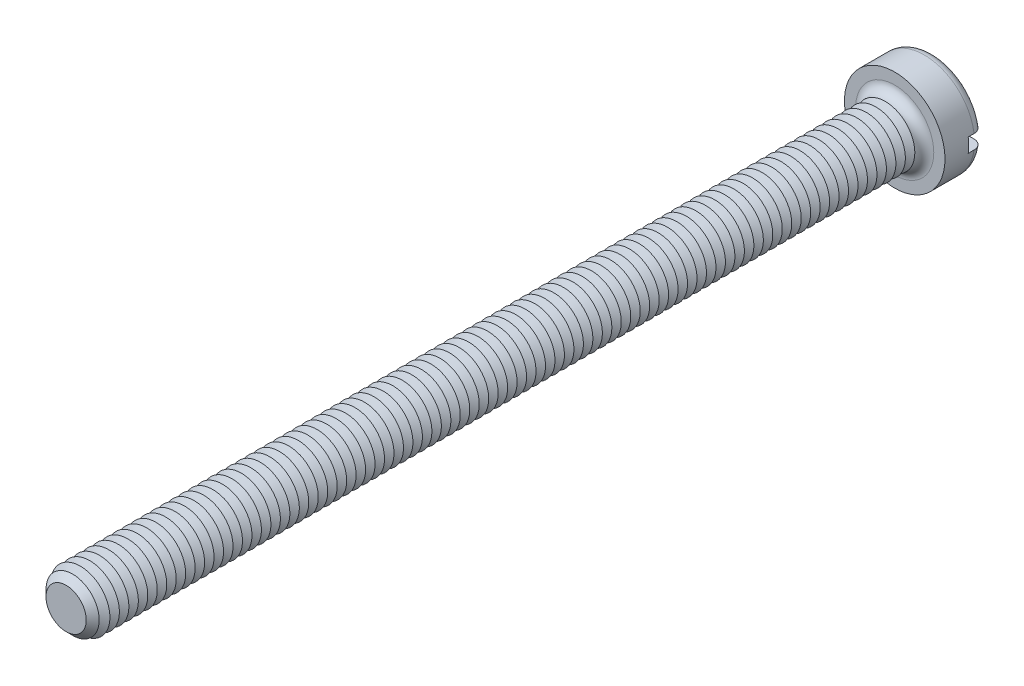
ISO-10303-21;
HEADER;
FILE_DESCRIPTION(('STEP AP214'),'2;1');
FILE_NAME('part.step','',(''),(''),'','','');
FILE_SCHEMA(('AUTOMOTIVE_DESIGN { 1 0 10303 214 1 1 1 1 }'));
ENDSEC;
DATA;
#1=APPLICATION_CONTEXT('core data for automotive mechanical design processes');
#2=APPLICATION_PROTOCOL_DEFINITION('international standard','automotive_design',2000,#1);
#3=PRODUCT_CONTEXT('',#1,'mechanical');
#4=PRODUCT('Part','Part','',(#3));
#5=PRODUCT_RELATED_PRODUCT_CATEGORY('part','',(#4));
#6=PRODUCT_DEFINITION_FORMATION('','',#4);
#7=PRODUCT_DEFINITION_CONTEXT('part definition',#1,'design');
#8=PRODUCT_DEFINITION('design','',#6,#7);
#9=PRODUCT_DEFINITION_SHAPE('','',#8);
#10=(LENGTH_UNIT() NAMED_UNIT(*) SI_UNIT(.MILLI.,.METRE.));
#11=(NAMED_UNIT(*) PLANE_ANGLE_UNIT() SI_UNIT($,.RADIAN.));
#12=(NAMED_UNIT(*) SI_UNIT($,.STERADIAN.) SOLID_ANGLE_UNIT());
#13=UNCERTAINTY_MEASURE_WITH_UNIT(LENGTH_MEASURE(1.E-05),#10,'distance_accuracy_value','');
#14=(GEOMETRIC_REPRESENTATION_CONTEXT(3) GLOBAL_UNCERTAINTY_ASSIGNED_CONTEXT((#13)) GLOBAL_UNIT_ASSIGNED_CONTEXT((#10,
#11,#12)) REPRESENTATION_CONTEXT('',''));
#15=CARTESIAN_POINT('',(0.,0.,0.));
#16=DIRECTION('',(0.,0.,1.));
#17=DIRECTION('',(1.,0.,0.));
#18=AXIS2_PLACEMENT_3D('',#15,#16,#17);
#19=CARTESIAN_POINT('',(0.,0.,-3.3));
#20=DIRECTION('',(0.,0.,1.));
#21=DIRECTION('',(1.,0.,0.));
#22=AXIS2_PLACEMENT_3D('',#19,#20,#21);
#23=PLANE('',#22);
#24=CARTESIAN_POINT('',(0.,0.,-3.3));
#25=DIRECTION('',(0.,0.,1.));
#26=DIRECTION('',(1.,0.,0.));
#27=AXIS2_PLACEMENT_3D('',#24,#25,#26);
#28=CIRCLE('',#27,3.45);
#29=CARTESIAN_POINT('',(-3.39742549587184,0.6,-3.3));
#30=VERTEX_POINT('',#29);
#31=CARTESIAN_POINT('',(3.39742549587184,0.6,-3.3));
#32=VERTEX_POINT('',#31);
#33=EDGE_CURVE('E116',#30,#32,#28,.F.);
#34=ORIENTED_EDGE('',*,*,#33,.T.);
#35=DIRECTION('',(1.,0.,0.));
#36=VECTOR('',#35,1.);
#37=CARTESIAN_POINT('',(-4.25,0.600000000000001,-3.3));
#38=LINE('',#37,#36);
#39=EDGE_CURVE('E111',#30,#32,#38,.T.);
#40=ORIENTED_EDGE('',*,*,#39,.F.);
#41=EDGE_LOOP('',(#34,#40));
#42=FACE_BOUND('',#41,.T.);
#43=ADVANCED_FACE('F39',(#42),#23,.F.);
#44=CARTESIAN_POINT('',(0.,0.,-2.5));
#45=DIRECTION('',(0.,0.,1.));
#46=DIRECTION('',(1.,0.,0.));
#47=AXIS2_PLACEMENT_3D('',#44,#45,#46);
#48=TOROIDAL_SURFACE('',#47,3.45,0.8);
#49=CARTESIAN_POINT('',(-4.06369072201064,0.600000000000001,-2.95537828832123));
#50=CARTESIAN_POINT('',(-4.03774340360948,0.600000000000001,-2.99245078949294));
#51=CARTESIAN_POINT('',(-4.00861849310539,0.600000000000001,-3.02734231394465));
#52=CARTESIAN_POINT('',(-3.94488199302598,0.600000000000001,-3.0917502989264));
#53=CARTESIAN_POINT('',(-3.91026320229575,0.600000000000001,-3.12125959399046));
#54=CARTESIAN_POINT('',(-3.83660561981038,0.600000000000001,-3.17403695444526));
#55=CARTESIAN_POINT('',(-3.79757117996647,0.6,-3.19731109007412));
#56=CARTESIAN_POINT('',(-3.71618817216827,0.6,-3.23703443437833));
#57=CARTESIAN_POINT('',(-3.67384041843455,0.6,-3.25348531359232));
#58=CARTESIAN_POINT('',(-3.58661930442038,0.6,-3.2792758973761));
#59=CARTESIAN_POINT('',(-3.54172669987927,0.6,-3.288550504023));
#60=CARTESIAN_POINT('',(-3.45102322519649,0.6,-3.29952632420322));
#61=CARTESIAN_POINT('',(-3.40521225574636,0.6,-3.30122671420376));
#62=CARTESIAN_POINT('',(-3.31340831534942,0.6,-3.29701196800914));
#63=CARTESIAN_POINT('',(-3.26741940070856,0.6,-3.29100823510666));
#64=CARTESIAN_POINT('',(-3.17708556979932,0.6,-3.27141469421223));
#65=CARTESIAN_POINT('',(-3.13274074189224,0.6,-3.25782447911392));
#66=CARTESIAN_POINT('',(-3.0466814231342,0.6,-3.22332549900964));
#67=CARTESIAN_POINT('',(-3.00498444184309,0.6,-3.20237301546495));
#68=CARTESIAN_POINT('',(-2.92572251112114,0.6,-3.15372961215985));
#69=CARTESIAN_POINT('',(-2.88815755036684,0.6,-3.12603871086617));
#70=CARTESIAN_POINT('',(-2.81847654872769,0.6,-3.06483322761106));
#71=CARTESIAN_POINT('',(-2.78633186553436,0.6,-3.03135128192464));
#72=CARTESIAN_POINT('',(-2.72824805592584,0.6,-2.95937651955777));
#73=CARTESIAN_POINT('',(-2.70230829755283,0.6,-2.92088421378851));
#74=CARTESIAN_POINT('',(-2.65791262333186,0.6,-2.84074227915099));
#75=CARTESIAN_POINT('',(-2.63932560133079,0.6,-2.79916531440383));
#76=CARTESIAN_POINT('',(-2.60958432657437,0.6,-2.7134333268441));
#77=CARTESIAN_POINT('',(-2.59842889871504,0.6,-2.66927871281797));
#78=CARTESIAN_POINT('',(-2.58411140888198,0.6,-2.58073966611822));
#79=CARTESIAN_POINT('',(-2.58077086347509,0.6,-2.5363840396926));
#80=CARTESIAN_POINT('',(-2.58167367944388,0.6,-2.44775208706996));
#81=CARTESIAN_POINT('',(-2.58591644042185,0.6,-2.40347575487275));
#82=CARTESIAN_POINT('',(-2.60175154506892,0.6,-2.31675105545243));
#83=CARTESIAN_POINT('',(-2.61326489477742,0.6,-2.27428821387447));
#84=CARTESIAN_POINT('',(-2.6431863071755,0.6,-2.19186794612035));
#85=CARTESIAN_POINT('',(-2.66159465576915,0.6,-2.15191062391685));
#86=CARTESIAN_POINT('',(-2.70494650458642,0.6,-2.07517696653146));
#87=CARTESIAN_POINT('',(-2.72995486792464,0.6,-2.03843731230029));
#88=CARTESIAN_POINT('',(-2.7856570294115,0.6,-1.96955746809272));
#89=CARTESIAN_POINT('',(-2.81635145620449,0.6,-1.93741778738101));
#90=CARTESIAN_POINT('',(-2.88329572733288,0.6,-1.87788048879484));
#91=CARTESIAN_POINT('',(-2.91965530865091,0.6,-1.85060625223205));
#92=CARTESIAN_POINT('',(-2.9963658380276,0.6,-1.80241044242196));
#93=CARTESIAN_POINT('',(-3.03671721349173,0.6,-1.78148955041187));
#94=CARTESIAN_POINT('',(-3.12111125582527,0.6,-1.74619829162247));
#95=CARTESIAN_POINT('',(-3.16521020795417,0.6,-1.73196239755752));
#96=CARTESIAN_POINT('',(-3.25516487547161,0.6,-1.71103773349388));
#97=CARTESIAN_POINT('',(-3.30102068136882,0.6,-1.70434935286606));
#98=CARTESIAN_POINT('',(-3.39352689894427,0.6,-1.69870104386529));
#99=CARTESIAN_POINT('',(-3.44018061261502,0.6,-1.69979487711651));
#100=CARTESIAN_POINT('',(-3.53263583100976,0.6,-1.70983959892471));
#101=CARTESIAN_POINT('',(-3.57843734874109,0.6,-1.71879036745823));
#102=CARTESIAN_POINT('',(-3.66763544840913,0.6,-1.74426972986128));
#103=CARTESIAN_POINT('',(-3.71104292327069,0.6,-1.76076015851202));
#104=CARTESIAN_POINT('',(-3.79442616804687,0.6,-1.80087686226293));
#105=CARTESIAN_POINT('',(-3.83440212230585,0.600000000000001,-1.82450275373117));
#106=CARTESIAN_POINT('',(-3.90929765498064,0.600000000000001,-1.87793548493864));
#107=CARTESIAN_POINT('',(-3.94426963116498,0.600000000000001,-1.90766887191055));
#108=CARTESIAN_POINT('',(-4.00864839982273,0.600000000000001,-1.9726503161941));
#109=CARTESIAN_POINT('',(-4.03805555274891,0.600000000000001,-2.00789801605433));
#110=CARTESIAN_POINT('',(-4.09009460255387,0.600000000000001,-2.08244463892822));
#111=CARTESIAN_POINT('',(-4.11280448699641,0.600000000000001,-2.12168912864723));
#112=CARTESIAN_POINT('',(-4.15124086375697,0.600000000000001,-2.2034588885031));
#113=CARTESIAN_POINT('',(-4.16696802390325,0.600000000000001,-2.24598384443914));
#114=CARTESIAN_POINT('',(-4.19085131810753,0.600000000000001,-2.33267862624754));
#115=CARTESIAN_POINT('',(-4.19907708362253,0.600000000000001,-2.37682928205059));
#116=CARTESIAN_POINT('',(-4.2079638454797,0.600000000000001,-2.46589754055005));
#117=CARTESIAN_POINT('',(-4.20862315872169,0.600000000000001,-2.51081531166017));
#118=CARTESIAN_POINT('',(-4.20236829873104,0.600000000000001,-2.59993343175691));
#119=CARTESIAN_POINT('',(-4.19548454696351,0.600000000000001,-2.64413593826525));
#120=CARTESIAN_POINT('',(-4.17439924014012,0.600000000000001,-2.73071930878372));
#121=CARTESIAN_POINT('',(-4.16020675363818,0.600000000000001,-2.77310235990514));
#122=CARTESIAN_POINT('',(-4.1318825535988,0.600000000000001,-2.83880495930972));
#123=CARTESIAN_POINT('',(-4.11991183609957,0.600000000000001,-2.86307959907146));
#124=CARTESIAN_POINT('',(-4.09356927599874,0.600000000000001,-2.91028856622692));
#125=CARTESIAN_POINT('',(-4.07919744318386,0.600000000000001,-2.9332228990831));
#126=CARTESIAN_POINT('',(-4.06369072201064,0.600000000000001,-2.95537828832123));
#127=B_SPLINE_CURVE_WITH_KNOTS('',3,(#49,#50,#51,#52,#53,#54,#55,#56,#57,#58,#59,#60,#61,#62,
#63,#64,#65,#66,#67,#68,#69,#70,#71,#72,#73,#74,#75,#76,#77,#78,#79,#80,#81,#82,#83,#84,#85,#86,
#87,#88,#89,#90,#91,#92,#93,#94,#95,#96,#97,#98,#99,#100,#101,#102,#103,#104,#105,#106,#107,
#108,#109,#110,#111,#112,#113,#114,#115,#116,#117,#118,#119,#120,#121,#122,#123,#124,#125,#126),
.UNSPECIFIED.,.T.,.F.,(4,2,2,2,2,2,2,2,2,2,2,2,2,2,2,2,2,2,2,2,2,2,2,2,2,2,2,2,2,2,2,2,2,2,2,2,
2,2,4),(0.,0.13565225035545,0.271483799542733,0.407182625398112,0.542848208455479,
0.679730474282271,0.816627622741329,0.955113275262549,1.09360635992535,1.23293614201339,
1.37226554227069,1.51083389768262,1.64938813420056,1.78534653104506,1.92128342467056,
2.0540840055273,2.18687407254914,2.31824564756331,2.44962267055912,2.58234229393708,
2.71507659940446,2.85080630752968,2.98655056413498,3.12491938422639,3.26329534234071,
3.40262816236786,3.54195885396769,3.68059194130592,3.81921757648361,3.95626453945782,
4.09330262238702,4.2286754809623,4.36403538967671,4.49812564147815,4.63224572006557,
4.76582687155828,4.89924267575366,4.98031194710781,5.0613808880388),.UNSPECIFIED.);
#128=CARTESIAN_POINT('',(-4.20743389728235,0.600000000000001,-2.50000000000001));
#129=VERTEX_POINT('',#128);
#130=EDGE_CURVE('E872',#129,#30,#127,.T.);
#131=ORIENTED_EDGE('',*,*,#130,.F.);
#132=CARTESIAN_POINT('',(0.,0.,-2.5));
#133=DIRECTION('',(0.,0.,1.));
#134=DIRECTION('',(1.,0.,0.));
#135=AXIS2_PLACEMENT_3D('',#132,#133,#134);
#136=CIRCLE('',#135,4.25);
#137=CARTESIAN_POINT('',(4.20743389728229,0.599999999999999,-2.5));
#138=VERTEX_POINT('',#137);
#139=EDGE_CURVE('E124',#138,#129,#136,.T.);
#140=ORIENTED_EDGE('',*,*,#139,.F.);
#141=CARTESIAN_POINT('',(2.63947327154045,0.6,-2.79608831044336));
#142=CARTESIAN_POINT('',(2.65655980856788,0.6,-2.83790320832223));
#143=CARTESIAN_POINT('',(2.67725642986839,0.6,-2.87828303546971));
#144=CARTESIAN_POINT('',(2.72519250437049,0.6,-2.95500233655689));
#145=CARTESIAN_POINT('',(2.75244152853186,0.6,-2.9913357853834));
#146=CARTESIAN_POINT('',(2.81257938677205,0.6,-3.05889430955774));
#147=CARTESIAN_POINT('',(2.84545995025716,0.6,-3.09012674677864));
#148=CARTESIAN_POINT('',(2.91591143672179,0.6,-3.14672620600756));
#149=CARTESIAN_POINT('',(2.95348119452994,0.6,-3.17209468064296));
#150=CARTESIAN_POINT('',(3.03291143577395,0.6,-3.21669611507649));
#151=CARTESIAN_POINT('',(3.07483186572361,0.6,-3.23582234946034));
#152=CARTESIAN_POINT('',(3.16126659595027,0.6,-3.26686062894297));
#153=CARTESIAN_POINT('',(3.2057811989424,0.6,-3.27877183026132));
#154=CARTESIAN_POINT('',(3.29669878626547,0.6,-3.29514603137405));
#155=CARTESIAN_POINT('',(3.34311773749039,0.6,-3.29952056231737));
#156=CARTESIAN_POINT('',(3.43603189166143,0.6,-3.30040472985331));
#157=CARTESIAN_POINT('',(3.48252709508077,0.6,-3.29691431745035));
#158=CARTESIAN_POINT('',(3.57420049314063,0.6,-3.28214240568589));
#159=CARTESIAN_POINT('',(3.61938038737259,0.6,-3.27087147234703));
#160=CARTESIAN_POINT('',(3.70717477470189,0.6,-3.24082890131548));
#161=CARTESIAN_POINT('',(3.74978938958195,0.6,-3.22205762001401));
#162=CARTESIAN_POINT('',(3.83078828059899,0.6,-3.17773607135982));
#163=CARTESIAN_POINT('',(3.86921015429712,0.599999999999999,-3.15225453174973));
#164=CARTESIAN_POINT('',(3.94116038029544,0.599999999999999,-3.09512672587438));
#165=CARTESIAN_POINT('',(3.9746890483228,0.599999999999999,-3.06348085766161));
#166=CARTESIAN_POINT('',(4.03545911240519,0.599999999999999,-2.99534640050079));
#167=CARTESIAN_POINT('',(4.06277344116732,0.599999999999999,-2.95892285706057));
#168=CARTESIAN_POINT('',(4.11082191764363,0.599999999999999,-2.88196698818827));
#169=CARTESIAN_POINT('',(4.13155647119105,0.599999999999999,-2.84143491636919));
#170=CARTESIAN_POINT('',(4.16563480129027,0.599999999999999,-2.75787550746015));
#171=CARTESIAN_POINT('',(4.1790544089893,0.599999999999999,-2.71487908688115));
#172=CARTESIAN_POINT('',(4.19843340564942,0.599999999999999,-2.62723691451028));
#173=CARTESIAN_POINT('',(4.20439310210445,0.599999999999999,-2.58259123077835));
#174=CARTESIAN_POINT('',(4.2086595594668,0.599999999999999,-2.49321831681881));
#175=CARTESIAN_POINT('',(4.20701422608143,0.599999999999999,-2.4484933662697));
#176=CARTESIAN_POINT('',(4.1962295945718,0.599999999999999,-2.35995704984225));
#177=CARTESIAN_POINT('',(4.18709040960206,0.599999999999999,-2.31614567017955));
#178=CARTESIAN_POINT('',(4.16160290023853,0.599999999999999,-2.23072100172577));
#179=CARTESIAN_POINT('',(4.14526169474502,0.599999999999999,-2.18910558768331));
#180=CARTESIAN_POINT('',(4.10585410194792,0.599999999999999,-2.10919238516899));
#181=CARTESIAN_POINT('',(4.08278762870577,0.599999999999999,-2.07089463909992));
#182=CARTESIAN_POINT('',(4.030487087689,0.599999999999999,-1.99851484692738));
#183=CARTESIAN_POINT('',(4.00122628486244,0.599999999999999,-1.9644521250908));
#184=CARTESIAN_POINT('',(3.93744772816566,0.599999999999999,-1.90166877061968));
#185=CARTESIAN_POINT('',(3.90292977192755,0.599999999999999,-1.87294834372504));
#186=CARTESIAN_POINT('',(3.82928727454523,0.599999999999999,-1.82137853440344));
#187=CARTESIAN_POINT('',(3.79012374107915,0.6,-1.79858484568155));
#188=CARTESIAN_POINT('',(3.70856025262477,0.6,-1.75980712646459));
#189=CARTESIAN_POINT('',(3.66616010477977,0.6,-1.74382350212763));
#190=CARTESIAN_POINT('',(3.57878495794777,0.6,-1.71891499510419));
#191=CARTESIAN_POINT('',(3.53378519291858,0.6,-1.71007699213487));
#192=CARTESIAN_POINT('',(3.44294322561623,0.6,-1.69998722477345));
#193=CARTESIAN_POINT('',(3.3971009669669,0.6,-1.69873596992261));
#194=CARTESIAN_POINT('',(3.30531297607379,0.6,-1.70385439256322));
#195=CARTESIAN_POINT('',(3.25937213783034,0.6,-1.71031204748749));
#196=CARTESIAN_POINT('',(3.1692099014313,0.6,-1.73080107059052));
#197=CARTESIAN_POINT('',(3.12498860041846,0.6,-1.74483286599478));
#198=CARTESIAN_POINT('',(3.03926209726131,0.6,-1.78018941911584));
#199=CARTESIAN_POINT('',(2.99777407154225,0.6,-1.80155586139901));
#200=CARTESIAN_POINT('',(2.91899881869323,0.6,-1.85098881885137));
#201=CARTESIAN_POINT('',(2.88171158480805,0.6,-1.8790553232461));
#202=CARTESIAN_POINT('',(2.81266124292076,0.6,-1.94094884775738));
#203=CARTESIAN_POINT('',(2.78086710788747,0.6,-1.97474122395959));
#204=CARTESIAN_POINT('',(2.72353615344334,0.6,-2.0472724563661));
#205=CARTESIAN_POINT('',(2.69799841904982,0.6,-2.08601058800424));
#206=CARTESIAN_POINT('',(2.65444718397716,0.6,-2.16655019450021));
#207=CARTESIAN_POINT('',(2.63629889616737,0.6,-2.20827875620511));
#208=CARTESIAN_POINT('',(2.60744942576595,0.6,-2.29424821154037));
#209=CARTESIAN_POINT('',(2.59674901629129,0.6,-2.33848936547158));
#210=CARTESIAN_POINT('',(2.5833312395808,0.6,-2.42714258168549));
#211=CARTESIAN_POINT('',(2.58043995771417,0.6,-2.47152848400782));
#212=CARTESIAN_POINT('',(2.58224493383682,0.6,-2.56010574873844));
#213=CARTESIAN_POINT('',(2.58693104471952,0.6,-2.60429729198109));
#214=CARTESIAN_POINT('',(2.60020046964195,0.6,-2.67311978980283));
#215=CARTESIAN_POINT('',(2.60635343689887,0.6,-2.69824441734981));
#216=CARTESIAN_POINT('',(2.62110140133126,0.6,-2.74776540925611));
#217=CARTESIAN_POINT('',(2.62969634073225,0.6,-2.77216179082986));
#218=CARTESIAN_POINT('',(2.63947327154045,0.6,-2.79608831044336));
#219=B_SPLINE_CURVE_WITH_KNOTS('',3,(#141,#142,#143,#144,#145,#146,#147,#148,#149,#150,#151,
#152,#153,#154,#155,#156,#157,#158,#159,#160,#161,#162,#163,#164,#165,#166,#167,#168,#169,#170,
#171,#172,#173,#174,#175,#176,#177,#178,#179,#180,#181,#182,#183,#184,#185,#186,#187,#188,#189,
#190,#191,#192,#193,#194,#195,#196,#197,#198,#199,#200,#201,#202,#203,#204,#205,#206,#207,#208,
#209,#210,#211,#212,#213,#214,#215,#216,#217,#218),.UNSPECIFIED.,.T.,.F.,(4,2,2,2,2,2,2,2,2,2,2,
2,2,2,2,2,2,2,2,2,2,2,2,2,2,2,2,2,2,2,2,2,2,2,2,2,2,2,4),(0.,0.135416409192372,
0.271031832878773,0.406449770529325,0.541834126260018,0.679424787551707,0.817031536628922,
0.956242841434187,1.09545501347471,1.23447850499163,1.37349539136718,1.51114036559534,
1.64877645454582,1.78470267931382,1.92062051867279,2.05510117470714,2.1895762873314,
2.32320547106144,2.45683263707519,2.59032801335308,2.72382509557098,2.85791055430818,
2.99200117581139,3.12730969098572,3.26262627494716,3.39956435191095,3.53651162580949,
3.67503685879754,3.81356990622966,3.95290367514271,4.09223721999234,4.23075602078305,
4.36925455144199,4.50509949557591,4.6409585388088,4.77376594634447,4.90639565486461,
4.98388287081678,5.06136825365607),.UNSPECIFIED.);
#220=EDGE_CURVE('E874',#32,#138,#219,.T.);
#221=ORIENTED_EDGE('',*,*,#220,.F.);
#222=ORIENTED_EDGE('',*,*,#33,.F.);
#223=EDGE_LOOP('',(#131,#140,#221,#222));
#224=FACE_BOUND('',#223,.T.);
#225=ADVANCED_FACE('F856',(#224),#48,.T.);
#226=CARTESIAN_POINT('',(0.,0.,-3.3));
#227=DIRECTION('',(0.,0.,1.));
#228=DIRECTION('',(1.,0.,0.));
#229=AXIS2_PLACEMENT_3D('',#226,#227,#228);
#230=CYLINDRICAL_SURFACE('',#229,4.25);
#231=DIRECTION('',(0.,0.,1.));
#232=VECTOR('',#231,1.);
#233=CARTESIAN_POINT('',(4.20743389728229,0.599999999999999,-3.3));
#234=LINE('',#233,#232);
#235=CARTESIAN_POINT('',(4.20743389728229,0.599999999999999,-2.));
#236=VERTEX_POINT('',#235);
#237=EDGE_CURVE('E888',#138,#236,#234,.T.);
#238=ORIENTED_EDGE('',*,*,#237,.F.);
#239=ORIENTED_EDGE('',*,*,#139,.T.);
#240=DIRECTION('',(0.,0.,1.));
#241=VECTOR('',#240,1.);
#242=CARTESIAN_POINT('',(-4.20743389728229,0.600000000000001,-3.3));
#243=LINE('',#242,#241);
#244=CARTESIAN_POINT('',(-4.20743389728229,0.600000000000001,-2.));
#245=VERTEX_POINT('',#244);
#246=EDGE_CURVE('E63',#245,#129,#243,.F.);
#247=ORIENTED_EDGE('',*,*,#246,.F.);
#248=CARTESIAN_POINT('',(0.,0.,-2.));
#249=DIRECTION('',(0.,0.,-1.));
#250=DIRECTION('',(-1.,0.,0.));
#251=AXIS2_PLACEMENT_3D('',#248,#249,#250);
#252=CIRCLE('',#251,4.25);
#253=CARTESIAN_POINT('',(-4.20743389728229,-0.599999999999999,-2.));
#254=VERTEX_POINT('',#253);
#255=EDGE_CURVE('E43',#245,#254,#252,.F.);
#256=ORIENTED_EDGE('',*,*,#255,.T.);
#257=DIRECTION('',(0.,0.,1.));
#258=VECTOR('',#257,1.);
#259=CARTESIAN_POINT('',(-4.20743389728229,-0.599999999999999,-3.3));
#260=LINE('',#259,#258);
#261=CARTESIAN_POINT('',(-4.20743389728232,-0.599999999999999,-2.5));
#262=VERTEX_POINT('',#261);
#263=EDGE_CURVE('E885',#262,#254,#260,.T.);
#264=ORIENTED_EDGE('',*,*,#263,.F.);
#265=CARTESIAN_POINT('',(4.20743389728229,-0.600000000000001,-2.5));
#266=VERTEX_POINT('',#265);
#267=EDGE_CURVE('E126',#262,#266,#136,.T.);
#268=ORIENTED_EDGE('',*,*,#267,.T.);
#269=DIRECTION('',(0.,0.,1.));
#270=VECTOR('',#269,1.);
#271=CARTESIAN_POINT('',(4.20743389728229,-0.600000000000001,-3.3));
#272=LINE('',#271,#270);
#273=CARTESIAN_POINT('',(4.20743389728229,-0.600000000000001,-2.));
#274=VERTEX_POINT('',#273);
#275=EDGE_CURVE('E55',#274,#266,#272,.F.);
#276=ORIENTED_EDGE('',*,*,#275,.F.);
#277=EDGE_CURVE('E11',#274,#236,#252,.F.);
#278=ORIENTED_EDGE('',*,*,#277,.T.);
#279=EDGE_LOOP('',(#238,#239,#247,#256,#264,#268,#276,#278));
#280=FACE_BOUND('',#279,.T.);
#281=CARTESIAN_POINT('',(0.,0.,0.));
#282=DIRECTION('',(0.,0.,1.));
#283=DIRECTION('',(1.,0.,0.));
#284=AXIS2_PLACEMENT_3D('',#281,#282,#283);
#285=CIRCLE('',#284,4.25);
#286=CARTESIAN_POINT('',(4.25,0.,0.));
#287=VERTEX_POINT('',#286);
#288=EDGE_CURVE('E890',#287,#287,#285,.T.);
#289=ORIENTED_EDGE('',*,*,#288,.F.);
#290=EDGE_LOOP('',(#289));
#291=FACE_BOUND('',#290,.T.);
#292=ADVANCED_FACE('F852',(#280,#291),#230,.T.);
#293=CARTESIAN_POINT('',(3.39742549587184,-0.6,-3.3));
#294=VERTEX_POINT('',#293);
#295=CARTESIAN_POINT('',(-3.39742549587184,-0.6,-3.3));
#296=VERTEX_POINT('',#295);
#297=EDGE_CURVE('E109',#294,#296,#28,.F.);
#298=ORIENTED_EDGE('',*,*,#297,.T.);
#299=DIRECTION('',(-1.,0.,0.));
#300=VECTOR('',#299,1.);
#301=CARTESIAN_POINT('',(-4.25,-0.599999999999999,-3.3));
#302=LINE('',#301,#300);
#303=EDGE_CURVE('E96',#294,#296,#302,.T.);
#304=ORIENTED_EDGE('',*,*,#303,.F.);
#305=EDGE_LOOP('',(#298,#304));
#306=FACE_BOUND('',#305,.T.);
#307=ADVANCED_FACE('F108',(#306),#23,.F.);
#308=CARTESIAN_POINT('',(0.,0.,0.));
#309=DIRECTION('',(0.,0.,1.));
#310=DIRECTION('',(1.,0.,0.));
#311=AXIS2_PLACEMENT_3D('',#308,#309,#310);
#312=PLANE('',#311);
#313=CARTESIAN_POINT('',(0.,0.,0.));
#314=DIRECTION('',(0.,0.,1.));
#315=DIRECTION('',(1.,0.,0.));
#316=AXIS2_PLACEMENT_3D('',#313,#314,#315);
#317=CIRCLE('',#316,3.3);
#318=CARTESIAN_POINT('',(3.3,0.,0.));
#319=VERTEX_POINT('',#318);
#320=EDGE_CURVE('E115',#319,#319,#317,.F.);
#321=ORIENTED_EDGE('',*,*,#320,.T.);
#322=EDGE_LOOP('',(#321));
#323=FACE_BOUND('',#322,.T.);
#324=ORIENTED_EDGE('',*,*,#288,.T.);
#325=EDGE_LOOP('',(#324));
#326=FACE_BOUND('',#325,.T.);
#327=ADVANCED_FACE('F851',(#323,#326),#312,.T.);
#328=CARTESIAN_POINT('',(-4.06369072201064,-0.599999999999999,-2.95537828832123));
#329=CARTESIAN_POINT('',(-4.08928577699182,-0.599999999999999,-2.91880204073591));
#330=CARTESIAN_POINT('',(-4.11182555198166,-0.599999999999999,-2.88005030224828));
#331=CARTESIAN_POINT('',(-4.15010404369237,-0.599999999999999,-2.79928452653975));
#332=CARTESIAN_POINT('',(-4.16583526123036,-0.599999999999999,-2.75726695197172));
#333=CARTESIAN_POINT('',(-4.19000286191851,-0.599999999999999,-2.67118996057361));
#334=CARTESIAN_POINT('',(-4.19844101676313,-0.599999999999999,-2.62713104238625));
#335=CARTESIAN_POINT('',(-4.20777174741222,-0.599999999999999,-2.53823222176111));
#336=CARTESIAN_POINT('',(-4.20866608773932,-0.599999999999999,-2.49339250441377));
#337=CARTESIAN_POINT('',(-4.20289683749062,-0.599999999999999,-2.40433856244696));
#338=CARTESIAN_POINT('',(-4.19625607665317,-0.599999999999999,-2.36012285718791));
#339=CARTESIAN_POINT('',(-4.17565084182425,-0.599999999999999,-2.27343166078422));
#340=CARTESIAN_POINT('',(-4.16168615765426,-0.599999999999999,-2.23095621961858));
#341=CARTESIAN_POINT('',(-4.12683188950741,-0.599999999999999,-2.14890863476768));
#342=CARTESIAN_POINT('',(-4.10593663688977,-0.599999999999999,-2.10933890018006));
#343=CARTESIAN_POINT('',(-4.05783763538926,-0.599999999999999,-2.03424145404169));
#344=CARTESIAN_POINT('',(-4.03063375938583,-0.599999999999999,-1.99871382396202));
#345=CARTESIAN_POINT('',(-3.97052236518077,-0.599999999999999,-1.93246905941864));
#346=CARTESIAN_POINT('',(-3.93758114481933,-0.599999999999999,-1.90178251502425));
#347=CARTESIAN_POINT('',(-3.86706007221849,-0.599999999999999,-1.84630837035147));
#348=CARTESIAN_POINT('',(-3.82948001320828,-0.6,-1.82152103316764));
#349=CARTESIAN_POINT('',(-3.75033766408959,-0.6,-1.77826995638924));
#350=CARTESIAN_POINT('',(-3.70873831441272,-0.6,-1.7598740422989));
#351=CARTESIAN_POINT('',(-3.62306661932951,-0.6,-1.73023196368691));
#352=CARTESIAN_POINT('',(-3.57899411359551,-0.6,-1.71898626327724));
#353=CARTESIAN_POINT('',(-3.48904845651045,-0.6,-1.70382025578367));
#354=CARTESIAN_POINT('',(-3.44315982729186,-0.6,-1.69999172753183));
#355=CARTESIAN_POINT('',(-3.35138360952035,-0.6,-1.7000083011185));
#356=CARTESIAN_POINT('',(-3.30549602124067,-0.6,-1.70385391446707));
#357=CARTESIAN_POINT('',(-3.21452492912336,-0.6,-1.71917227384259));
#358=CARTESIAN_POINT('',(-3.16945455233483,-0.6,-1.73072307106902));
#359=CARTESIAN_POINT('',(-3.08188104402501,-0.6,-1.76120640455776));
#360=CARTESIAN_POINT('',(-3.0393780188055,-0.6,-1.78013924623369));
#361=CARTESIAN_POINT('',(-2.95805296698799,-0.6,-1.82493384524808));
#362=CARTESIAN_POINT('',(-2.9192403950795,-0.6,-1.85081278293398));
#363=CARTESIAN_POINT('',(-2.84656695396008,-0.6,-1.90878317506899));
#364=CARTESIAN_POINT('',(-2.81270591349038,-0.6,-1.94087441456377));
#365=CARTESIAN_POINT('',(-2.75131050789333,-0.6,-2.01002500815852));
#366=CARTESIAN_POINT('',(-2.72371339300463,-0.6,-2.04702860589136));
#367=CARTESIAN_POINT('',(-2.67528742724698,-0.6,-2.12522869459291));
#368=CARTESIAN_POINT('',(-2.65445765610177,-0.6,-2.1664246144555));
#369=CARTESIAN_POINT('',(-2.62065354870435,-0.6,-2.25087266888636));
#370=CARTESIAN_POINT('',(-2.60751663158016,-0.6,-2.29405971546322));
#371=CARTESIAN_POINT('',(-2.58885106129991,-0.6,-2.38204659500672));
#372=CARTESIAN_POINT('',(-2.58332131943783,-0.6,-2.42684619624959));
#373=CARTESIAN_POINT('',(-2.58009777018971,-0.6,-2.51580379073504));
#374=CARTESIAN_POINT('',(-2.58224575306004,-0.6,-2.55995612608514));
#375=CARTESIAN_POINT('',(-2.59395205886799,-0.6,-2.64726495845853));
#376=CARTESIAN_POINT('',(-2.60351013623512,-0.6,-2.69042148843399));
#377=CARTESIAN_POINT('',(-2.62967159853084,-0.6,-2.77438771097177));
#378=CARTESIAN_POINT('',(-2.64625243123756,-0.6,-2.81520444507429));
#379=CARTESIAN_POINT('',(-2.68592348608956,-0.6,-2.89353901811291));
#380=CARTESIAN_POINT('',(-2.70901418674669,-0.6,-2.9310566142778));
#381=CARTESIAN_POINT('',(-2.7614318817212,-0.6,-3.00240040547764));
#382=CARTESIAN_POINT('',(-2.79085487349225,-0.6,-3.03615603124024));
#383=CARTESIAN_POINT('',(-2.85483456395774,-0.6,-3.09838834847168));
#384=CARTESIAN_POINT('',(-2.88939187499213,-0.6,-3.12686440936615));
#385=CARTESIAN_POINT('',(-2.96351967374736,-0.6,-3.17841283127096));
#386=CARTESIAN_POINT('',(-3.00318741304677,-0.6,-3.20134539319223));
#387=CARTESIAN_POINT('',(-3.08576649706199,-0.6,-3.24034364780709));
#388=CARTESIAN_POINT('',(-3.12867814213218,-0.6,-3.25640870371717));
#389=CARTESIAN_POINT('',(-3.21724048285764,-0.6,-3.28143816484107));
#390=CARTESIAN_POINT('',(-3.26292314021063,-0.6,-3.29028963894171));
#391=CARTESIAN_POINT('',(-3.35512527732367,-0.6,-3.30021681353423));
#392=CARTESIAN_POINT('',(-3.40164474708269,-0.6,-3.30129260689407));
#393=CARTESIAN_POINT('',(-3.49429978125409,-0.6,-3.29560589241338));
#394=CARTESIAN_POINT('',(-3.54043436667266,-0.6,-3.28882735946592));
#395=CARTESIAN_POINT('',(-3.63090382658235,-0.6,-3.26755492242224));
#396=CARTESIAN_POINT('',(-3.67523831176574,-0.6,-3.25305935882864));
#397=CARTESIAN_POINT('',(-3.76046509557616,-0.6,-3.21686867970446));
#398=CARTESIAN_POINT('',(-3.80138087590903,-0.599999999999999,-3.1952288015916));
#399=CARTESIAN_POINT('',(-3.8788986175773,-0.599999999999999,-3.14531817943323));
#400=CARTESIAN_POINT('',(-3.91550599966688,-0.599999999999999,-3.11705590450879));
#401=CARTESIAN_POINT('',(-3.97074313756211,-0.599999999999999,-3.06628809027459));
#402=CARTESIAN_POINT('',(-3.99100743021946,-0.599999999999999,-3.04553102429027));
#403=CARTESIAN_POINT('',(-4.02917385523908,-0.599999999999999,-3.00194762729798));
#404=CARTESIAN_POINT('',(-4.04707600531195,-0.599999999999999,-2.97912131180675));
#405=CARTESIAN_POINT('',(-4.06369072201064,-0.599999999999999,-2.95537828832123));
#406=B_SPLINE_CURVE_WITH_KNOTS('',3,(#328,#329,#330,#331,#332,#333,#334,#335,#336,#337,#338,
#339,#340,#341,#342,#343,#344,#345,#346,#347,#348,#349,#350,#351,#352,#353,#354,#355,#356,#357,
#358,#359,#360,#361,#362,#363,#364,#365,#366,#367,#368,#369,#370,#371,#372,#373,#374,#375,#376,
#377,#378,#379,#380,#381,#382,#383,#384,#385,#386,#387,#388,#389,#390,#391,#392,#393,#394,#395,
#396,#397,#398,#399,#400,#401,#402,#403,#404,#405),.UNSPECIFIED.,.T.,.F.,(4,2,2,2,2,2,2,2,2,2,2,
2,2,2,2,2,2,2,2,2,2,2,2,2,2,2,2,2,2,2,2,2,2,2,2,2,2,2,4),(0.,0.133821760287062,
0.267790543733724,0.401726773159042,0.535631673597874,0.669131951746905,0.802636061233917,
0.936249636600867,1.06986590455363,1.2042952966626,1.3387306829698,1.47455198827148,
1.61038210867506,1.74788249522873,1.88539204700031,2.02431612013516,2.16324594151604,
2.30252260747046,2.4417944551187,2.57960263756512,2.71739207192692,2.85215325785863,
2.98689515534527,3.11887666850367,3.25085380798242,3.38241030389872,3.51397647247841,
3.64769871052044,3.78143690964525,3.91826005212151,4.05509587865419,4.19403485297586,
4.33297216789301,4.47219345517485,4.61144469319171,4.74964356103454,4.887666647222,
4.97453605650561,5.06140481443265),.UNSPECIFIED.);
#407=EDGE_CURVE('E103',#296,#262,#406,.T.);
#408=ORIENTED_EDGE('',*,*,#407,.F.);
#409=ORIENTED_EDGE('',*,*,#297,.F.);
#410=CARTESIAN_POINT('',(2.63947327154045,-0.6,-2.79608831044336));
#411=CARTESIAN_POINT('',(2.62285766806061,-0.6,-2.75541510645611));
#412=CARTESIAN_POINT('',(2.60963282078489,-0.6,-2.71332585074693));
#413=CARTESIAN_POINT('',(2.59042394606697,-0.6,-2.62749460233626));
#414=CARTESIAN_POINT('',(2.58444686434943,-0.6,-2.58375106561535));
#415=CARTESIAN_POINT('',(2.57995287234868,-0.6,-2.49588524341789));
#416=CARTESIAN_POINT('',(2.58143477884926,-0.6,-2.45176301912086));
#417=CARTESIAN_POINT('',(2.59180622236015,-0.6,-2.36440906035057));
#418=CARTESIAN_POINT('',(2.60069434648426,-0.6,-2.32117715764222));
#419=CARTESIAN_POINT('',(2.62554964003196,-0.6,-2.23689909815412));
#420=CARTESIAN_POINT('',(2.6415022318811,-0.6,-2.19584863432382));
#421=CARTESIAN_POINT('',(2.67996913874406,-0.6,-2.11694797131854));
#422=CARTESIAN_POINT('',(2.70248409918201,-0.6,-2.07909808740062));
#423=CARTESIAN_POINT('',(2.75378972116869,-0.6,-2.00702296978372));
#424=CARTESIAN_POINT('',(2.7826732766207,-0.6,-1.97286389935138));
#425=CARTESIAN_POINT('',(2.84564717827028,-0.6,-1.90974167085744));
#426=CARTESIAN_POINT('',(2.87973812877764,-0.6,-1.88077911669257));
#427=CARTESIAN_POINT('',(2.95300941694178,-0.6,-1.82817307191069));
#428=CARTESIAN_POINT('',(2.99228920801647,-0.6,-1.8046680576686));
#429=CARTESIAN_POINT('',(3.07419050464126,-0.6,-1.76446470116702));
#430=CARTESIAN_POINT('',(3.11681231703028,-0.6,-1.74776698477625));
#431=CARTESIAN_POINT('',(3.20492149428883,-0.6,-1.72140945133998));
#432=CARTESIAN_POINT('',(3.25044365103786,-0.6,-1.71186578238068));
#433=CARTESIAN_POINT('',(3.34244451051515,-0.6,-1.70053183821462));
#434=CARTESIAN_POINT('',(3.38892324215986,-0.6,-1.69874179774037));
#435=CARTESIAN_POINT('',(3.48165030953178,-0.6,-1.70299737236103));
#436=CARTESIAN_POINT('',(3.52789766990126,-0.6,-1.70906439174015));
#437=CARTESIAN_POINT('',(3.61869999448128,-0.6,-1.72893768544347));
#438=CARTESIAN_POINT('',(3.6632550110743,-0.6,-1.742743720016));
#439=CARTESIAN_POINT('',(3.7490339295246,-0.6,-1.77760539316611));
#440=CARTESIAN_POINT('',(3.79028083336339,-0.600000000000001,-1.79860440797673));
#441=CARTESIAN_POINT('',(3.86860401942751,-0.600000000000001,-1.84731105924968));
#442=CARTESIAN_POINT('',(3.90568056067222,-0.600000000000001,-1.87501827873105));
#443=CARTESIAN_POINT('',(3.97412845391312,-0.600000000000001,-1.93599408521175));
#444=CARTESIAN_POINT('',(4.00556369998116,-0.600000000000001,-1.96919094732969));
#445=CARTESIAN_POINT('',(4.06233546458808,-0.600000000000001,-2.0404445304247));
#446=CARTESIAN_POINT('',(4.08767237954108,-0.600000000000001,-2.07850093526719));
#447=CARTESIAN_POINT('',(4.13122502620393,-0.600000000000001,-2.15791791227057));
#448=CARTESIAN_POINT('',(4.14951966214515,-0.600000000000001,-2.19923522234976));
#449=CARTESIAN_POINT('',(4.17884974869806,-0.600000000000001,-2.28437065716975));
#450=CARTESIAN_POINT('',(4.18988555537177,-0.600000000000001,-2.32818865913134));
#451=CARTESIAN_POINT('',(4.20430724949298,-0.600000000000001,-2.41670951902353));
#452=CARTESIAN_POINT('',(4.2077528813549,-0.600000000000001,-2.46140265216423));
#453=CARTESIAN_POINT('',(4.20706844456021,-0.600000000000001,-2.55073028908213));
#454=CARTESIAN_POINT('',(4.20293856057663,-0.600000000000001,-2.595364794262));
#455=CARTESIAN_POINT('',(4.18724926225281,-0.600000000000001,-2.68317733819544));
#456=CARTESIAN_POINT('',(4.17571081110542,-0.600000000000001,-2.72635912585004));
#457=CARTESIAN_POINT('',(4.14556645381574,-0.600000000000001,-2.81017999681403));
#458=CARTESIAN_POINT('',(4.12696052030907,-0.600000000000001,-2.85081907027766));
#459=CARTESIAN_POINT('',(4.08317014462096,-0.600000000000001,-2.92852328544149));
#460=CARTESIAN_POINT('',(4.0579684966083,-0.600000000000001,-2.96557872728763));
#461=CARTESIAN_POINT('',(4.00174565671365,-0.600000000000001,-3.034972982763));
#462=CARTESIAN_POINT('',(3.97072429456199,-0.600000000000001,-3.06731165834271));
#463=CARTESIAN_POINT('',(3.90349659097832,-0.600000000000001,-3.12662735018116));
#464=CARTESIAN_POINT('',(3.86725240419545,-0.600000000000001,-3.15356146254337));
#465=CARTESIAN_POINT('',(3.79079809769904,-0.600000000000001,-3.20104156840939));
#466=CARTESIAN_POINT('',(3.75058775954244,-0.6,-3.22158720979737));
#467=CARTESIAN_POINT('',(3.6668595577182,-0.6,-3.25595832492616));
#468=CARTESIAN_POINT('',(3.62330947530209,-0.6,-3.26970530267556));
#469=CARTESIAN_POINT('',(3.53453348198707,-0.6,-3.28979004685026));
#470=CARTESIAN_POINT('',(3.48930745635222,-0.6,-3.29612730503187));
#471=CARTESIAN_POINT('',(3.39787506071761,-0.6,-3.30128612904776));
#472=CARTESIAN_POINT('',(3.35166346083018,-0.6,-3.30001513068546));
#473=CARTESIAN_POINT('',(3.26009663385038,-0.6,-3.28980210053));
#474=CARTESIAN_POINT('',(3.21474142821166,-0.6,-3.28085987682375));
#475=CARTESIAN_POINT('',(3.12577990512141,-0.6,-3.2554540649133));
#476=CARTESIAN_POINT('',(3.08219120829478,-0.6,-3.23892872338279));
#477=CARTESIAN_POINT('',(2.99839730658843,-0.6,-3.1987810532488));
#478=CARTESIAN_POINT('',(2.95819301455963,-0.6,-3.17515681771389));
#479=CARTESIAN_POINT('',(2.88239372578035,-0.6,-3.12147666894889));
#480=CARTESIAN_POINT('',(2.84679445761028,-0.6,-3.09142678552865));
#481=CARTESIAN_POINT('',(2.78127483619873,-0.6,-3.02571584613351));
#482=CARTESIAN_POINT('',(2.75134725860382,-0.6,-2.99006203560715));
#483=CARTESIAN_POINT('',(2.70767232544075,-0.6,-2.92780516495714));
#484=CARTESIAN_POINT('',(2.69197340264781,-0.6,-2.90254809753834));
#485=CARTESIAN_POINT('',(2.66349078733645,-0.6,-2.8504392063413));
#486=CARTESIAN_POINT('',(2.65070705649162,-0.6,-2.82358740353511));
#487=CARTESIAN_POINT('',(2.63947327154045,-0.6,-2.79608831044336));
#488=B_SPLINE_CURVE_WITH_KNOTS('',3,(#410,#411,#412,#413,#414,#415,#416,#417,#418,#419,#420,
#421,#422,#423,#424,#425,#426,#427,#428,#429,#430,#431,#432,#433,#434,#435,#436,#437,#438,#439,
#440,#441,#442,#443,#444,#445,#446,#447,#448,#449,#450,#451,#452,#453,#454,#455,#456,#457,#458,
#459,#460,#461,#462,#463,#464,#465,#466,#467,#468,#469,#470,#471,#472,#473,#474,#475,#476,#477,
#478,#479,#480,#481,#482,#483,#484,#485,#486,#487),.UNSPECIFIED.,.T.,.F.,(4,2,2,2,2,2,2,2,2,2,2,
2,2,2,2,2,2,2,2,2,2,2,2,2,2,2,2,2,2,2,2,2,2,2,2,2,2,2,4),(0.,0.131701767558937,
0.263529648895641,0.395336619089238,0.527118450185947,0.658629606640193,0.790153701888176,
0.923740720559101,1.05734325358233,1.19403504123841,1.33073939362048,1.46961778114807,
1.60850037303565,1.74776210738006,1.88701952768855,2.02520497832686,2.16338184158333,
2.29987843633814,2.43636615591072,2.57127672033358,2.7061806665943,2.84001889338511,
2.97385385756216,3.1073117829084,3.24077022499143,3.37458034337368,3.50839437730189,
3.64323196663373,3.77807698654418,3.91444452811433,4.05082142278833,4.18886086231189,
4.32690375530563,4.46609131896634,4.60531630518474,4.74441121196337,4.88332773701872,
4.97237227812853,5.06141564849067),.UNSPECIFIED.);
#489=EDGE_CURVE('E92',#266,#294,#488,.T.);
#490=ORIENTED_EDGE('',*,*,#489,.F.);
#491=ORIENTED_EDGE('',*,*,#267,.F.);
#492=EDGE_LOOP('',(#408,#409,#490,#491));
#493=FACE_BOUND('',#492,.T.);
#494=ADVANCED_FACE('F113',(#493),#48,.T.);
#495=CARTESIAN_POINT('',(0.,0.,0.799999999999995));
#496=DIRECTION('',(0.,0.,1.));
#497=DIRECTION('',(1.,0.,0.));
#498=AXIS2_PLACEMENT_3D('',#495,#496,#497);
#499=TOROIDAL_SURFACE('',#498,3.3,0.8);
#500=ORIENTED_EDGE('',*,*,#320,.F.);
#501=EDGE_LOOP('',(#500));
#502=FACE_BOUND('',#501,.T.);
#503=CARTESIAN_POINT('',(0.,0.,0.799999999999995));
#504=DIRECTION('',(0.,0.,-1.));
#505=DIRECTION('',(-1.,0.,0.));
#506=AXIS2_PLACEMENT_3D('',#503,#504,#505);
#507=CIRCLE('',#506,2.5);
#508=CARTESIAN_POINT('',(-2.5,0.,0.799999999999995));
#509=VERTEX_POINT('',#508);
#510=EDGE_CURVE('E894',#509,#509,#507,.T.);
#511=ORIENTED_EDGE('',*,*,#510,.T.);
#512=EDGE_LOOP('',(#511));
#513=FACE_BOUND('',#512,.T.);
#514=ADVANCED_FACE('F844',(#502,#513),#499,.F.);
#515=CARTESIAN_POINT('',(0.,0.,1.2));
#516=DIRECTION('',(0.,0.,-1.));
#517=DIRECTION('',(-1.,0.,0.));
#518=AXIS2_PLACEMENT_3D('',#515,#516,#517);
#519=CONICAL_SURFACE('',#518,1.80717967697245,1.0471975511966);
#520=ORIENTED_EDGE('',*,*,#510,.F.);
#521=EDGE_LOOP('',(#520));
#522=FACE_BOUND('',#521,.T.);
#523=CARTESIAN_POINT('',(0.,0.,1.2));
#524=DIRECTION('',(0.,0.,-1.));
#525=DIRECTION('',(-1.,0.,0.));
#526=AXIS2_PLACEMENT_3D('',#523,#524,#525);
#527=CIRCLE('',#526,1.80717967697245);
#528=CARTESIAN_POINT('',(-1.80717967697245,0.,1.2));
#529=VERTEX_POINT('',#528);
#530=EDGE_CURVE('E900',#529,#529,#527,.T.);
#531=ORIENTED_EDGE('',*,*,#530,.T.);
#532=EDGE_LOOP('',(#531));
#533=FACE_BOUND('',#532,.T.);
#534=ADVANCED_FACE('F840',(#522,#533),#519,.T.);
#535=CARTESIAN_POINT('',(0.,0.,1.59999999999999));
#536=DIRECTION('',(0.,0.,1.));
#537=DIRECTION('',(1.,0.,0.));
#538=AXIS2_PLACEMENT_3D('',#535,#536,#537);
#539=CONICAL_SURFACE('',#538,2.5,1.0471975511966);
#540=ORIENTED_EDGE('',*,*,#530,.F.);
#541=EDGE_LOOP('',(#540));
#542=FACE_BOUND('',#541,.T.);
#543=CARTESIAN_POINT('',(0.,0.,1.59999999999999));
#544=DIRECTION('',(0.,0.,-1.));
#545=DIRECTION('',(-1.,0.,0.));
#546=AXIS2_PLACEMENT_3D('',#543,#544,#545);
#547=CIRCLE('',#546,2.5);
#548=CARTESIAN_POINT('',(-2.5,0.,1.59999999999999));
#549=VERTEX_POINT('',#548);
#550=EDGE_CURVE('E906',#549,#549,#547,.T.);
#551=ORIENTED_EDGE('',*,*,#550,.T.);
#552=EDGE_LOOP('',(#551));
#553=FACE_BOUND('',#552,.T.);
#554=ADVANCED_FACE('F836',(#542,#553),#539,.T.);
#555=CARTESIAN_POINT('',(0.,0.,2.));
#556=DIRECTION('',(0.,0.,-1.));
#557=DIRECTION('',(-1.,0.,0.));
#558=AXIS2_PLACEMENT_3D('',#555,#556,#557);
#559=CONICAL_SURFACE('',#558,1.80717967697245,1.0471975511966);
#560=ORIENTED_EDGE('',*,*,#550,.F.);
#561=EDGE_LOOP('',(#560));
#562=FACE_BOUND('',#561,.T.);
#563=CARTESIAN_POINT('',(0.,0.,2.));
#564=DIRECTION('',(0.,0.,-1.));
#565=DIRECTION('',(-1.,0.,0.));
#566=AXIS2_PLACEMENT_3D('',#563,#564,#565);
#567=CIRCLE('',#566,1.80717967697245);
#568=CARTESIAN_POINT('',(-1.80717967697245,0.,2.));
#569=VERTEX_POINT('',#568);
#570=EDGE_CURVE('E910',#569,#569,#567,.T.);
#571=ORIENTED_EDGE('',*,*,#570,.T.);
#572=EDGE_LOOP('',(#571));
#573=FACE_BOUND('',#572,.T.);
#574=ADVANCED_FACE('F832',(#562,#573),#559,.T.);
#575=CARTESIAN_POINT('',(0.,0.,2.4));
#576=DIRECTION('',(0.,0.,1.));
#577=DIRECTION('',(1.,0.,0.));
#578=AXIS2_PLACEMENT_3D('',#575,#576,#577);
#579=CONICAL_SURFACE('',#578,2.5,1.0471975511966);
#580=ORIENTED_EDGE('',*,*,#570,.F.);
#581=EDGE_LOOP('',(#580));
#582=FACE_BOUND('',#581,.T.);
#583=CARTESIAN_POINT('',(0.,0.,2.4));
#584=DIRECTION('',(0.,0.,-1.));
#585=DIRECTION('',(-1.,0.,0.));
#586=AXIS2_PLACEMENT_3D('',#583,#584,#585);
#587=CIRCLE('',#586,2.5);
#588=CARTESIAN_POINT('',(-2.5,0.,2.4));
#589=VERTEX_POINT('',#588);
#590=EDGE_CURVE('E914',#589,#589,#587,.T.);
#591=ORIENTED_EDGE('',*,*,#590,.T.);
#592=EDGE_LOOP('',(#591));
#593=FACE_BOUND('',#592,.T.);
#594=ADVANCED_FACE('F828',(#582,#593),#579,.T.);
#595=CARTESIAN_POINT('',(0.,0.,2.8));
#596=DIRECTION('',(0.,0.,-1.));
#597=DIRECTION('',(-1.,0.,0.));
#598=AXIS2_PLACEMENT_3D('',#595,#596,#597);
#599=CONICAL_SURFACE('',#598,1.80717967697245,1.0471975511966);
#600=ORIENTED_EDGE('',*,*,#590,.F.);
#601=EDGE_LOOP('',(#600));
#602=FACE_BOUND('',#601,.T.);
#603=CARTESIAN_POINT('',(0.,0.,2.8));
#604=DIRECTION('',(0.,0.,-1.));
#605=DIRECTION('',(-1.,0.,0.));
#606=AXIS2_PLACEMENT_3D('',#603,#604,#605);
#607=CIRCLE('',#606,1.80717967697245);
#608=CARTESIAN_POINT('',(-1.80717967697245,0.,2.8));
#609=VERTEX_POINT('',#608);
#610=EDGE_CURVE('E918',#609,#609,#607,.T.);
#611=ORIENTED_EDGE('',*,*,#610,.T.);
#612=EDGE_LOOP('',(#611));
#613=FACE_BOUND('',#612,.T.);
#614=ADVANCED_FACE('F824',(#602,#613),#599,.T.);
#615=CARTESIAN_POINT('',(0.,0.,3.2));
#616=DIRECTION('',(0.,0.,1.));
#617=DIRECTION('',(1.,0.,0.));
#618=AXIS2_PLACEMENT_3D('',#615,#616,#617);
#619=CONICAL_SURFACE('',#618,2.5,1.0471975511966);
#620=ORIENTED_EDGE('',*,*,#610,.F.);
#621=EDGE_LOOP('',(#620));
#622=FACE_BOUND('',#621,.T.);
#623=CARTESIAN_POINT('',(0.,0.,3.2));
#624=DIRECTION('',(0.,0.,-1.));
#625=DIRECTION('',(-1.,0.,0.));
#626=AXIS2_PLACEMENT_3D('',#623,#624,#625);
#627=CIRCLE('',#626,2.5);
#628=CARTESIAN_POINT('',(-2.5,0.,3.2));
#629=VERTEX_POINT('',#628);
#630=EDGE_CURVE('E922',#629,#629,#627,.T.);
#631=ORIENTED_EDGE('',*,*,#630,.T.);
#632=EDGE_LOOP('',(#631));
#633=FACE_BOUND('',#632,.T.);
#634=ADVANCED_FACE('F820',(#622,#633),#619,.T.);
#635=CARTESIAN_POINT('',(0.,0.,3.6));
#636=DIRECTION('',(0.,0.,-1.));
#637=DIRECTION('',(-1.,0.,0.));
#638=AXIS2_PLACEMENT_3D('',#635,#636,#637);
#639=CONICAL_SURFACE('',#638,1.80717967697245,1.0471975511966);
#640=ORIENTED_EDGE('',*,*,#630,.F.);
#641=EDGE_LOOP('',(#640));
#642=FACE_BOUND('',#641,.T.);
#643=CARTESIAN_POINT('',(0.,0.,3.6));
#644=DIRECTION('',(0.,0.,-1.));
#645=DIRECTION('',(-1.,0.,0.));
#646=AXIS2_PLACEMENT_3D('',#643,#644,#645);
#647=CIRCLE('',#646,1.80717967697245);
#648=CARTESIAN_POINT('',(-1.80717967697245,0.,3.6));
#649=VERTEX_POINT('',#648);
#650=EDGE_CURVE('E925',#649,#649,#647,.T.);
#651=ORIENTED_EDGE('',*,*,#650,.T.);
#652=EDGE_LOOP('',(#651));
#653=FACE_BOUND('',#652,.T.);
#654=ADVANCED_FACE('F816',(#642,#653),#639,.T.);
#655=CARTESIAN_POINT('',(0.,0.,3.99999999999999));
#656=DIRECTION('',(0.,0.,1.));
#657=DIRECTION('',(1.,0.,0.));
#658=AXIS2_PLACEMENT_3D('',#655,#656,#657);
#659=CONICAL_SURFACE('',#658,2.5,1.0471975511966);
#660=ORIENTED_EDGE('',*,*,#650,.F.);
#661=EDGE_LOOP('',(#660));
#662=FACE_BOUND('',#661,.T.);
#663=CARTESIAN_POINT('',(0.,0.,3.99999999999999));
#664=DIRECTION('',(0.,0.,-1.));
#665=DIRECTION('',(-1.,0.,0.));
#666=AXIS2_PLACEMENT_3D('',#663,#664,#665);
#667=CIRCLE('',#666,2.5);
#668=CARTESIAN_POINT('',(-2.5,0.,3.99999999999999));
#669=VERTEX_POINT('',#668);
#670=EDGE_CURVE('E929',#669,#669,#667,.T.);
#671=ORIENTED_EDGE('',*,*,#670,.T.);
#672=EDGE_LOOP('',(#671));
#673=FACE_BOUND('',#672,.T.);
#674=ADVANCED_FACE('F812',(#662,#673),#659,.T.);
#675=CARTESIAN_POINT('',(0.,0.,4.4));
#676=DIRECTION('',(0.,0.,-1.));
#677=DIRECTION('',(-1.,0.,0.));
#678=AXIS2_PLACEMENT_3D('',#675,#676,#677);
#679=CONICAL_SURFACE('',#678,1.80717967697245,1.0471975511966);
#680=ORIENTED_EDGE('',*,*,#670,.F.);
#681=EDGE_LOOP('',(#680));
#682=FACE_BOUND('',#681,.T.);
#683=CARTESIAN_POINT('',(0.,0.,4.4));
#684=DIRECTION('',(0.,0.,-1.));
#685=DIRECTION('',(-1.,0.,0.));
#686=AXIS2_PLACEMENT_3D('',#683,#684,#685);
#687=CIRCLE('',#686,1.80717967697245);
#688=CARTESIAN_POINT('',(-1.80717967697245,0.,4.4));
#689=VERTEX_POINT('',#688);
#690=EDGE_CURVE('E933',#689,#689,#687,.T.);
#691=ORIENTED_EDGE('',*,*,#690,.T.);
#692=EDGE_LOOP('',(#691));
#693=FACE_BOUND('',#692,.T.);
#694=ADVANCED_FACE('F808',(#682,#693),#679,.T.);
#695=CARTESIAN_POINT('',(0.,0.,4.8));
#696=DIRECTION('',(0.,0.,1.));
#697=DIRECTION('',(1.,0.,0.));
#698=AXIS2_PLACEMENT_3D('',#695,#696,#697);
#699=CONICAL_SURFACE('',#698,2.5,1.0471975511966);
#700=ORIENTED_EDGE('',*,*,#690,.F.);
#701=EDGE_LOOP('',(#700));
#702=FACE_BOUND('',#701,.T.);
#703=CARTESIAN_POINT('',(0.,0.,4.8));
#704=DIRECTION('',(0.,0.,-1.));
#705=DIRECTION('',(-1.,0.,0.));
#706=AXIS2_PLACEMENT_3D('',#703,#704,#705);
#707=CIRCLE('',#706,2.5);
#708=CARTESIAN_POINT('',(-2.5,0.,4.8));
#709=VERTEX_POINT('',#708);
#710=EDGE_CURVE('E937',#709,#709,#707,.T.);
#711=ORIENTED_EDGE('',*,*,#710,.T.);
#712=EDGE_LOOP('',(#711));
#713=FACE_BOUND('',#712,.T.);
#714=ADVANCED_FACE('F804',(#702,#713),#699,.T.);
#715=CARTESIAN_POINT('',(0.,0.,5.2));
#716=DIRECTION('',(0.,0.,-1.));
#717=DIRECTION('',(-1.,0.,0.));
#718=AXIS2_PLACEMENT_3D('',#715,#716,#717);
#719=CONICAL_SURFACE('',#718,1.80717967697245,1.0471975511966);
#720=ORIENTED_EDGE('',*,*,#710,.F.);
#721=EDGE_LOOP('',(#720));
#722=FACE_BOUND('',#721,.T.);
#723=CARTESIAN_POINT('',(0.,0.,5.2));
#724=DIRECTION('',(0.,0.,-1.));
#725=DIRECTION('',(-1.,0.,0.));
#726=AXIS2_PLACEMENT_3D('',#723,#724,#725);
#727=CIRCLE('',#726,1.80717967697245);
#728=CARTESIAN_POINT('',(-1.80717967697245,0.,5.2));
#729=VERTEX_POINT('',#728);
#730=EDGE_CURVE('E940',#729,#729,#727,.T.);
#731=ORIENTED_EDGE('',*,*,#730,.T.);
#732=EDGE_LOOP('',(#731));
#733=FACE_BOUND('',#732,.T.);
#734=ADVANCED_FACE('F800',(#722,#733),#719,.T.);
#735=CARTESIAN_POINT('',(0.,0.,5.6));
#736=DIRECTION('',(0.,0.,1.));
#737=DIRECTION('',(1.,0.,0.));
#738=AXIS2_PLACEMENT_3D('',#735,#736,#737);
#739=CONICAL_SURFACE('',#738,2.5,1.0471975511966);
#740=ORIENTED_EDGE('',*,*,#730,.F.);
#741=EDGE_LOOP('',(#740));
#742=FACE_BOUND('',#741,.T.);
#743=CARTESIAN_POINT('',(0.,0.,5.6));
#744=DIRECTION('',(0.,0.,-1.));
#745=DIRECTION('',(-1.,0.,0.));
#746=AXIS2_PLACEMENT_3D('',#743,#744,#745);
#747=CIRCLE('',#746,2.5);
#748=CARTESIAN_POINT('',(-2.5,0.,5.6));
#749=VERTEX_POINT('',#748);
#750=EDGE_CURVE('E944',#749,#749,#747,.T.);
#751=ORIENTED_EDGE('',*,*,#750,.T.);
#752=EDGE_LOOP('',(#751));
#753=FACE_BOUND('',#752,.T.);
#754=ADVANCED_FACE('F796',(#742,#753),#739,.T.);
#755=CARTESIAN_POINT('',(0.,0.,6.));
#756=DIRECTION('',(0.,0.,-1.));
#757=DIRECTION('',(-1.,0.,0.));
#758=AXIS2_PLACEMENT_3D('',#755,#756,#757);
#759=CONICAL_SURFACE('',#758,1.80717967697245,1.0471975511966);
#760=ORIENTED_EDGE('',*,*,#750,.F.);
#761=EDGE_LOOP('',(#760));
#762=FACE_BOUND('',#761,.T.);
#763=CARTESIAN_POINT('',(0.,0.,6.));
#764=DIRECTION('',(0.,0.,-1.));
#765=DIRECTION('',(-1.,0.,0.));
#766=AXIS2_PLACEMENT_3D('',#763,#764,#765);
#767=CIRCLE('',#766,1.80717967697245);
#768=CARTESIAN_POINT('',(-1.80717967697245,0.,6.));
#769=VERTEX_POINT('',#768);
#770=EDGE_CURVE('E948',#769,#769,#767,.T.);
#771=ORIENTED_EDGE('',*,*,#770,.T.);
#772=EDGE_LOOP('',(#771));
#773=FACE_BOUND('',#772,.T.);
#774=ADVANCED_FACE('F792',(#762,#773),#759,.T.);
#775=CARTESIAN_POINT('',(0.,0.,6.4));
#776=DIRECTION('',(0.,0.,1.));
#777=DIRECTION('',(1.,0.,0.));
#778=AXIS2_PLACEMENT_3D('',#775,#776,#777);
#779=CONICAL_SURFACE('',#778,2.5,1.0471975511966);
#780=ORIENTED_EDGE('',*,*,#770,.F.);
#781=EDGE_LOOP('',(#780));
#782=FACE_BOUND('',#781,.T.);
#783=CARTESIAN_POINT('',(0.,0.,6.4));
#784=DIRECTION('',(0.,0.,-1.));
#785=DIRECTION('',(-1.,0.,0.));
#786=AXIS2_PLACEMENT_3D('',#783,#784,#785);
#787=CIRCLE('',#786,2.5);
#788=CARTESIAN_POINT('',(-2.5,0.,6.4));
#789=VERTEX_POINT('',#788);
#790=EDGE_CURVE('E952',#789,#789,#787,.T.);
#791=ORIENTED_EDGE('',*,*,#790,.T.);
#792=EDGE_LOOP('',(#791));
#793=FACE_BOUND('',#792,.T.);
#794=ADVANCED_FACE('F788',(#782,#793),#779,.T.);
#795=CARTESIAN_POINT('',(0.,0.,6.8));
#796=DIRECTION('',(0.,0.,-1.));
#797=DIRECTION('',(-1.,0.,0.));
#798=AXIS2_PLACEMENT_3D('',#795,#796,#797);
#799=CONICAL_SURFACE('',#798,1.80717967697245,1.0471975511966);
#800=ORIENTED_EDGE('',*,*,#790,.F.);
#801=EDGE_LOOP('',(#800));
#802=FACE_BOUND('',#801,.T.);
#803=CARTESIAN_POINT('',(0.,0.,6.8));
#804=DIRECTION('',(0.,0.,-1.));
#805=DIRECTION('',(-1.,0.,0.));
#806=AXIS2_PLACEMENT_3D('',#803,#804,#805);
#807=CIRCLE('',#806,1.80717967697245);
#808=CARTESIAN_POINT('',(-1.80717967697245,0.,6.8));
#809=VERTEX_POINT('',#808);
#810=EDGE_CURVE('E956',#809,#809,#807,.T.);
#811=ORIENTED_EDGE('',*,*,#810,.T.);
#812=EDGE_LOOP('',(#811));
#813=FACE_BOUND('',#812,.T.);
#814=ADVANCED_FACE('F784',(#802,#813),#799,.T.);
#815=CARTESIAN_POINT('',(0.,0.,7.19999999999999));
#816=DIRECTION('',(0.,0.,1.));
#817=DIRECTION('',(1.,0.,0.));
#818=AXIS2_PLACEMENT_3D('',#815,#816,#817);
#819=CONICAL_SURFACE('',#818,2.5,1.0471975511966);
#820=ORIENTED_EDGE('',*,*,#810,.F.);
#821=EDGE_LOOP('',(#820));
#822=FACE_BOUND('',#821,.T.);
#823=CARTESIAN_POINT('',(0.,0.,7.2));
#824=DIRECTION('',(0.,0.,-1.));
#825=DIRECTION('',(-1.,0.,0.));
#826=AXIS2_PLACEMENT_3D('',#823,#824,#825);
#827=CIRCLE('',#826,2.5);
#828=CARTESIAN_POINT('',(-2.5,0.,7.2));
#829=VERTEX_POINT('',#828);
#830=EDGE_CURVE('E960',#829,#829,#827,.T.);
#831=ORIENTED_EDGE('',*,*,#830,.T.);
#832=EDGE_LOOP('',(#831));
#833=FACE_BOUND('',#832,.T.);
#834=ADVANCED_FACE('F780',(#822,#833),#819,.T.);
#835=CARTESIAN_POINT('',(0.,0.,7.6));
#836=DIRECTION('',(0.,0.,-1.));
#837=DIRECTION('',(-1.,0.,0.));
#838=AXIS2_PLACEMENT_3D('',#835,#836,#837);
#839=CONICAL_SURFACE('',#838,1.80717967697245,1.0471975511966);
#840=ORIENTED_EDGE('',*,*,#830,.F.);
#841=EDGE_LOOP('',(#840));
#842=FACE_BOUND('',#841,.T.);
#843=CARTESIAN_POINT('',(0.,0.,7.6));
#844=DIRECTION('',(0.,0.,-1.));
#845=DIRECTION('',(-1.,0.,0.));
#846=AXIS2_PLACEMENT_3D('',#843,#844,#845);
#847=CIRCLE('',#846,1.80717967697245);
#848=CARTESIAN_POINT('',(-1.80717967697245,0.,7.6));
#849=VERTEX_POINT('',#848);
#850=EDGE_CURVE('E964',#849,#849,#847,.T.);
#851=ORIENTED_EDGE('',*,*,#850,.T.);
#852=EDGE_LOOP('',(#851));
#853=FACE_BOUND('',#852,.T.);
#854=ADVANCED_FACE('F776',(#842,#853),#839,.T.);
#855=CARTESIAN_POINT('',(0.,0.,7.99999999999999));
#856=DIRECTION('',(0.,0.,1.));
#857=DIRECTION('',(1.,0.,0.));
#858=AXIS2_PLACEMENT_3D('',#855,#856,#857);
#859=CONICAL_SURFACE('',#858,2.5,1.0471975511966);
#860=ORIENTED_EDGE('',*,*,#850,.F.);
#861=EDGE_LOOP('',(#860));
#862=FACE_BOUND('',#861,.T.);
#863=CARTESIAN_POINT('',(0.,0.,8.));
#864=DIRECTION('',(0.,0.,-1.));
#865=DIRECTION('',(-1.,0.,0.));
#866=AXIS2_PLACEMENT_3D('',#863,#864,#865);
#867=CIRCLE('',#866,2.5);
#868=CARTESIAN_POINT('',(-2.5,0.,8.));
#869=VERTEX_POINT('',#868);
#870=EDGE_CURVE('E968',#869,#869,#867,.T.);
#871=ORIENTED_EDGE('',*,*,#870,.T.);
#872=EDGE_LOOP('',(#871));
#873=FACE_BOUND('',#872,.T.);
#874=ADVANCED_FACE('F772',(#862,#873),#859,.T.);
#875=CARTESIAN_POINT('',(0.,0.,8.4));
#876=DIRECTION('',(0.,0.,-1.));
#877=DIRECTION('',(-1.,0.,0.));
#878=AXIS2_PLACEMENT_3D('',#875,#876,#877);
#879=CONICAL_SURFACE('',#878,1.80717967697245,1.0471975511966);
#880=ORIENTED_EDGE('',*,*,#870,.F.);
#881=EDGE_LOOP('',(#880));
#882=FACE_BOUND('',#881,.T.);
#883=CARTESIAN_POINT('',(0.,0.,8.4));
#884=DIRECTION('',(0.,0.,-1.));
#885=DIRECTION('',(-1.,0.,0.));
#886=AXIS2_PLACEMENT_3D('',#883,#884,#885);
#887=CIRCLE('',#886,1.80717967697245);
#888=CARTESIAN_POINT('',(-1.80717967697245,0.,8.4));
#889=VERTEX_POINT('',#888);
#890=EDGE_CURVE('E972',#889,#889,#887,.T.);
#891=ORIENTED_EDGE('',*,*,#890,.T.);
#892=EDGE_LOOP('',(#891));
#893=FACE_BOUND('',#892,.T.);
#894=ADVANCED_FACE('F768',(#882,#893),#879,.T.);
#895=CARTESIAN_POINT('',(0.,0.,8.8));
#896=DIRECTION('',(0.,0.,1.));
#897=DIRECTION('',(1.,0.,0.));
#898=AXIS2_PLACEMENT_3D('',#895,#896,#897);
#899=CONICAL_SURFACE('',#898,2.5,1.0471975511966);
#900=ORIENTED_EDGE('',*,*,#890,.F.);
#901=EDGE_LOOP('',(#900));
#902=FACE_BOUND('',#901,.T.);
#903=CARTESIAN_POINT('',(0.,0.,8.8));
#904=DIRECTION('',(0.,0.,-1.));
#905=DIRECTION('',(-1.,0.,0.));
#906=AXIS2_PLACEMENT_3D('',#903,#904,#905);
#907=CIRCLE('',#906,2.5);
#908=CARTESIAN_POINT('',(-2.5,0.,8.8));
#909=VERTEX_POINT('',#908);
#910=EDGE_CURVE('E976',#909,#909,#907,.T.);
#911=ORIENTED_EDGE('',*,*,#910,.T.);
#912=EDGE_LOOP('',(#911));
#913=FACE_BOUND('',#912,.T.);
#914=ADVANCED_FACE('F764',(#902,#913),#899,.T.);
#915=CARTESIAN_POINT('',(0.,0.,9.2));
#916=DIRECTION('',(0.,0.,-1.));
#917=DIRECTION('',(-1.,0.,0.));
#918=AXIS2_PLACEMENT_3D('',#915,#916,#917);
#919=CONICAL_SURFACE('',#918,1.80717967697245,1.0471975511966);
#920=ORIENTED_EDGE('',*,*,#910,.F.);
#921=EDGE_LOOP('',(#920));
#922=FACE_BOUND('',#921,.T.);
#923=CARTESIAN_POINT('',(0.,0.,9.2));
#924=DIRECTION('',(0.,0.,-1.));
#925=DIRECTION('',(-1.,0.,0.));
#926=AXIS2_PLACEMENT_3D('',#923,#924,#925);
#927=CIRCLE('',#926,1.80717967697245);
#928=CARTESIAN_POINT('',(-1.80717967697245,0.,9.2));
#929=VERTEX_POINT('',#928);
#930=EDGE_CURVE('E980',#929,#929,#927,.T.);
#931=ORIENTED_EDGE('',*,*,#930,.T.);
#932=EDGE_LOOP('',(#931));
#933=FACE_BOUND('',#932,.T.);
#934=ADVANCED_FACE('F760',(#922,#933),#919,.T.);
#935=CARTESIAN_POINT('',(0.,0.,9.6));
#936=DIRECTION('',(0.,0.,1.));
#937=DIRECTION('',(1.,0.,0.));
#938=AXIS2_PLACEMENT_3D('',#935,#936,#937);
#939=CONICAL_SURFACE('',#938,2.5,1.0471975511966);
#940=ORIENTED_EDGE('',*,*,#930,.F.);
#941=EDGE_LOOP('',(#940));
#942=FACE_BOUND('',#941,.T.);
#943=CARTESIAN_POINT('',(0.,0.,9.6));
#944=DIRECTION('',(0.,0.,-1.));
#945=DIRECTION('',(-1.,0.,0.));
#946=AXIS2_PLACEMENT_3D('',#943,#944,#945);
#947=CIRCLE('',#946,2.5);
#948=CARTESIAN_POINT('',(-2.5,0.,9.6));
#949=VERTEX_POINT('',#948);
#950=EDGE_CURVE('E984',#949,#949,#947,.T.);
#951=ORIENTED_EDGE('',*,*,#950,.T.);
#952=EDGE_LOOP('',(#951));
#953=FACE_BOUND('',#952,.T.);
#954=ADVANCED_FACE('F756',(#942,#953),#939,.T.);
#955=CARTESIAN_POINT('',(0.,0.,9.99999999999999));
#956=DIRECTION('',(0.,0.,-1.));
#957=DIRECTION('',(-1.,0.,0.));
#958=AXIS2_PLACEMENT_3D('',#955,#956,#957);
#959=CONICAL_SURFACE('',#958,1.80717967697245,1.0471975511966);
#960=ORIENTED_EDGE('',*,*,#950,.F.);
#961=EDGE_LOOP('',(#960));
#962=FACE_BOUND('',#961,.T.);
#963=CARTESIAN_POINT('',(0.,0.,9.99999999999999));
#964=DIRECTION('',(0.,0.,-1.));
#965=DIRECTION('',(-1.,0.,0.));
#966=AXIS2_PLACEMENT_3D('',#963,#964,#965);
#967=CIRCLE('',#966,1.80717967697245);
#968=CARTESIAN_POINT('',(-1.80717967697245,0.,9.99999999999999));
#969=VERTEX_POINT('',#968);
#970=EDGE_CURVE('E988',#969,#969,#967,.T.);
#971=ORIENTED_EDGE('',*,*,#970,.T.);
#972=EDGE_LOOP('',(#971));
#973=FACE_BOUND('',#972,.T.);
#974=ADVANCED_FACE('F752',(#962,#973),#959,.T.);
#975=CARTESIAN_POINT('',(0.,0.,10.4));
#976=DIRECTION('',(0.,0.,1.));
#977=DIRECTION('',(1.,0.,0.));
#978=AXIS2_PLACEMENT_3D('',#975,#976,#977);
#979=CONICAL_SURFACE('',#978,2.5,1.0471975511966);
#980=ORIENTED_EDGE('',*,*,#970,.F.);
#981=EDGE_LOOP('',(#980));
#982=FACE_BOUND('',#981,.T.);
#983=CARTESIAN_POINT('',(0.,0.,10.4));
#984=DIRECTION('',(0.,0.,-1.));
#985=DIRECTION('',(-1.,0.,0.));
#986=AXIS2_PLACEMENT_3D('',#983,#984,#985);
#987=CIRCLE('',#986,2.5);
#988=CARTESIAN_POINT('',(-2.5,0.,10.4));
#989=VERTEX_POINT('',#988);
#990=EDGE_CURVE('E992',#989,#989,#987,.T.);
#991=ORIENTED_EDGE('',*,*,#990,.T.);
#992=EDGE_LOOP('',(#991));
#993=FACE_BOUND('',#992,.T.);
#994=ADVANCED_FACE('F748',(#982,#993),#979,.T.);
#995=CARTESIAN_POINT('',(0.,0.,10.8));
#996=DIRECTION('',(0.,0.,-1.));
#997=DIRECTION('',(-1.,0.,0.));
#998=AXIS2_PLACEMENT_3D('',#995,#996,#997);
#999=CONICAL_SURFACE('',#998,1.80717967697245,1.0471975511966);
#1000=ORIENTED_EDGE('',*,*,#990,.F.);
#1001=EDGE_LOOP('',(#1000));
#1002=FACE_BOUND('',#1001,.T.);
#1003=CARTESIAN_POINT('',(0.,0.,10.8));
#1004=DIRECTION('',(0.,0.,-1.));
#1005=DIRECTION('',(-1.,0.,0.));
#1006=AXIS2_PLACEMENT_3D('',#1003,#1004,#1005);
#1007=CIRCLE('',#1006,1.80717967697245);
#1008=CARTESIAN_POINT('',(-1.80717967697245,0.,10.8));
#1009=VERTEX_POINT('',#1008);
#1010=EDGE_CURVE('E996',#1009,#1009,#1007,.T.);
#1011=ORIENTED_EDGE('',*,*,#1010,.T.);
#1012=EDGE_LOOP('',(#1011));
#1013=FACE_BOUND('',#1012,.T.);
#1014=ADVANCED_FACE('F744',(#1002,#1013),#999,.T.);
#1015=CARTESIAN_POINT('',(0.,0.,11.2));
#1016=DIRECTION('',(0.,0.,1.));
#1017=DIRECTION('',(1.,0.,0.));
#1018=AXIS2_PLACEMENT_3D('',#1015,#1016,#1017);
#1019=CONICAL_SURFACE('',#1018,2.5,1.0471975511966);
#1020=ORIENTED_EDGE('',*,*,#1010,.F.);
#1021=EDGE_LOOP('',(#1020));
#1022=FACE_BOUND('',#1021,.T.);
#1023=CARTESIAN_POINT('',(0.,0.,11.2));
#1024=DIRECTION('',(0.,0.,-1.));
#1025=DIRECTION('',(-1.,0.,0.));
#1026=AXIS2_PLACEMENT_3D('',#1023,#1024,#1025);
#1027=CIRCLE('',#1026,2.5);
#1028=CARTESIAN_POINT('',(-2.5,0.,11.2));
#1029=VERTEX_POINT('',#1028);
#1030=EDGE_CURVE('E1000',#1029,#1029,#1027,.T.);
#1031=ORIENTED_EDGE('',*,*,#1030,.T.);
#1032=EDGE_LOOP('',(#1031));
#1033=FACE_BOUND('',#1032,.T.);
#1034=ADVANCED_FACE('F740',(#1022,#1033),#1019,.T.);
#1035=CARTESIAN_POINT('',(0.,0.,11.6));
#1036=DIRECTION('',(0.,0.,-1.));
#1037=DIRECTION('',(-1.,0.,0.));
#1038=AXIS2_PLACEMENT_3D('',#1035,#1036,#1037);
#1039=CONICAL_SURFACE('',#1038,1.80717967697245,1.0471975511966);
#1040=ORIENTED_EDGE('',*,*,#1030,.F.);
#1041=EDGE_LOOP('',(#1040));
#1042=FACE_BOUND('',#1041,.T.);
#1043=CARTESIAN_POINT('',(0.,0.,11.6));
#1044=DIRECTION('',(0.,0.,-1.));
#1045=DIRECTION('',(-1.,0.,0.));
#1046=AXIS2_PLACEMENT_3D('',#1043,#1044,#1045);
#1047=CIRCLE('',#1046,1.80717967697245);
#1048=CARTESIAN_POINT('',(-1.80717967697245,0.,11.6));
#1049=VERTEX_POINT('',#1048);
#1050=EDGE_CURVE('E1004',#1049,#1049,#1047,.T.);
#1051=ORIENTED_EDGE('',*,*,#1050,.T.);
#1052=EDGE_LOOP('',(#1051));
#1053=FACE_BOUND('',#1052,.T.);
#1054=ADVANCED_FACE('F736',(#1042,#1053),#1039,.T.);
#1055=CARTESIAN_POINT('',(0.,0.,12.));
#1056=DIRECTION('',(0.,0.,1.));
#1057=DIRECTION('',(1.,0.,0.));
#1058=AXIS2_PLACEMENT_3D('',#1055,#1056,#1057);
#1059=CONICAL_SURFACE('',#1058,2.5,1.0471975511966);
#1060=ORIENTED_EDGE('',*,*,#1050,.F.);
#1061=EDGE_LOOP('',(#1060));
#1062=FACE_BOUND('',#1061,.T.);
#1063=CARTESIAN_POINT('',(0.,0.,12.));
#1064=DIRECTION('',(0.,0.,-1.));
#1065=DIRECTION('',(-1.,0.,0.));
#1066=AXIS2_PLACEMENT_3D('',#1063,#1064,#1065);
#1067=CIRCLE('',#1066,2.5);
#1068=CARTESIAN_POINT('',(-2.5,0.,12.));
#1069=VERTEX_POINT('',#1068);
#1070=EDGE_CURVE('E1008',#1069,#1069,#1067,.T.);
#1071=ORIENTED_EDGE('',*,*,#1070,.T.);
#1072=EDGE_LOOP('',(#1071));
#1073=FACE_BOUND('',#1072,.T.);
#1074=ADVANCED_FACE('F732',(#1062,#1073),#1059,.T.);
#1075=CARTESIAN_POINT('',(0.,0.,12.4));
#1076=DIRECTION('',(0.,0.,-1.));
#1077=DIRECTION('',(-1.,0.,0.));
#1078=AXIS2_PLACEMENT_3D('',#1075,#1076,#1077);
#1079=CONICAL_SURFACE('',#1078,1.80717967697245,1.0471975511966);
#1080=ORIENTED_EDGE('',*,*,#1070,.F.);
#1081=EDGE_LOOP('',(#1080));
#1082=FACE_BOUND('',#1081,.T.);
#1083=CARTESIAN_POINT('',(0.,0.,12.4));
#1084=DIRECTION('',(0.,0.,-1.));
#1085=DIRECTION('',(-1.,0.,0.));
#1086=AXIS2_PLACEMENT_3D('',#1083,#1084,#1085);
#1087=CIRCLE('',#1086,1.80717967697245);
#1088=CARTESIAN_POINT('',(-1.80717967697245,0.,12.4));
#1089=VERTEX_POINT('',#1088);
#1090=EDGE_CURVE('E1012',#1089,#1089,#1087,.T.);
#1091=ORIENTED_EDGE('',*,*,#1090,.T.);
#1092=EDGE_LOOP('',(#1091));
#1093=FACE_BOUND('',#1092,.T.);
#1094=ADVANCED_FACE('F728',(#1082,#1093),#1079,.T.);
#1095=CARTESIAN_POINT('',(0.,0.,12.8));
#1096=DIRECTION('',(0.,0.,1.));
#1097=DIRECTION('',(1.,0.,0.));
#1098=AXIS2_PLACEMENT_3D('',#1095,#1096,#1097);
#1099=CONICAL_SURFACE('',#1098,2.5,1.0471975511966);
#1100=ORIENTED_EDGE('',*,*,#1090,.F.);
#1101=EDGE_LOOP('',(#1100));
#1102=FACE_BOUND('',#1101,.T.);
#1103=CARTESIAN_POINT('',(0.,0.,12.8));
#1104=DIRECTION('',(0.,0.,-1.));
#1105=DIRECTION('',(-1.,0.,0.));
#1106=AXIS2_PLACEMENT_3D('',#1103,#1104,#1105);
#1107=CIRCLE('',#1106,2.5);
#1108=CARTESIAN_POINT('',(-2.5,0.,12.8));
#1109=VERTEX_POINT('',#1108);
#1110=EDGE_CURVE('E1016',#1109,#1109,#1107,.T.);
#1111=ORIENTED_EDGE('',*,*,#1110,.T.);
#1112=EDGE_LOOP('',(#1111));
#1113=FACE_BOUND('',#1112,.T.);
#1114=ADVANCED_FACE('F724',(#1102,#1113),#1099,.T.);
#1115=CARTESIAN_POINT('',(0.,0.,13.2));
#1116=DIRECTION('',(0.,0.,-1.));
#1117=DIRECTION('',(-1.,0.,0.));
#1118=AXIS2_PLACEMENT_3D('',#1115,#1116,#1117);
#1119=CONICAL_SURFACE('',#1118,1.80717967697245,1.0471975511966);
#1120=ORIENTED_EDGE('',*,*,#1110,.F.);
#1121=EDGE_LOOP('',(#1120));
#1122=FACE_BOUND('',#1121,.T.);
#1123=CARTESIAN_POINT('',(0.,0.,13.2));
#1124=DIRECTION('',(0.,0.,-1.));
#1125=DIRECTION('',(-1.,0.,0.));
#1126=AXIS2_PLACEMENT_3D('',#1123,#1124,#1125);
#1127=CIRCLE('',#1126,1.80717967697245);
#1128=CARTESIAN_POINT('',(-1.80717967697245,0.,13.2));
#1129=VERTEX_POINT('',#1128);
#1130=EDGE_CURVE('E1020',#1129,#1129,#1127,.T.);
#1131=ORIENTED_EDGE('',*,*,#1130,.T.);
#1132=EDGE_LOOP('',(#1131));
#1133=FACE_BOUND('',#1132,.T.);
#1134=ADVANCED_FACE('F720',(#1122,#1133),#1119,.T.);
#1135=CARTESIAN_POINT('',(0.,0.,13.6));
#1136=DIRECTION('',(0.,0.,1.));
#1137=DIRECTION('',(1.,0.,0.));
#1138=AXIS2_PLACEMENT_3D('',#1135,#1136,#1137);
#1139=CONICAL_SURFACE('',#1138,2.5,1.0471975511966);
#1140=ORIENTED_EDGE('',*,*,#1130,.F.);
#1141=EDGE_LOOP('',(#1140));
#1142=FACE_BOUND('',#1141,.T.);
#1143=CARTESIAN_POINT('',(0.,0.,13.6));
#1144=DIRECTION('',(0.,0.,-1.));
#1145=DIRECTION('',(-1.,0.,0.));
#1146=AXIS2_PLACEMENT_3D('',#1143,#1144,#1145);
#1147=CIRCLE('',#1146,2.5);
#1148=CARTESIAN_POINT('',(-2.5,0.,13.6));
#1149=VERTEX_POINT('',#1148);
#1150=EDGE_CURVE('E1024',#1149,#1149,#1147,.T.);
#1151=ORIENTED_EDGE('',*,*,#1150,.T.);
#1152=EDGE_LOOP('',(#1151));
#1153=FACE_BOUND('',#1152,.T.);
#1154=ADVANCED_FACE('F716',(#1142,#1153),#1139,.T.);
#1155=CARTESIAN_POINT('',(0.,0.,14.));
#1156=DIRECTION('',(0.,0.,-1.));
#1157=DIRECTION('',(-1.,0.,0.));
#1158=AXIS2_PLACEMENT_3D('',#1155,#1156,#1157);
#1159=CONICAL_SURFACE('',#1158,1.80717967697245,1.0471975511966);
#1160=ORIENTED_EDGE('',*,*,#1150,.F.);
#1161=EDGE_LOOP('',(#1160));
#1162=FACE_BOUND('',#1161,.T.);
#1163=CARTESIAN_POINT('',(0.,0.,14.));
#1164=DIRECTION('',(0.,0.,-1.));
#1165=DIRECTION('',(-1.,0.,0.));
#1166=AXIS2_PLACEMENT_3D('',#1163,#1164,#1165);
#1167=CIRCLE('',#1166,1.80717967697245);
#1168=CARTESIAN_POINT('',(-1.80717967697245,0.,14.));
#1169=VERTEX_POINT('',#1168);
#1170=EDGE_CURVE('E1028',#1169,#1169,#1167,.T.);
#1171=ORIENTED_EDGE('',*,*,#1170,.T.);
#1172=EDGE_LOOP('',(#1171));
#1173=FACE_BOUND('',#1172,.T.);
#1174=ADVANCED_FACE('F712',(#1162,#1173),#1159,.T.);
#1175=CARTESIAN_POINT('',(0.,0.,14.4));
#1176=DIRECTION('',(0.,0.,1.));
#1177=DIRECTION('',(1.,0.,0.));
#1178=AXIS2_PLACEMENT_3D('',#1175,#1176,#1177);
#1179=CONICAL_SURFACE('',#1178,2.5,1.0471975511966);
#1180=ORIENTED_EDGE('',*,*,#1170,.F.);
#1181=EDGE_LOOP('',(#1180));
#1182=FACE_BOUND('',#1181,.T.);
#1183=CARTESIAN_POINT('',(0.,0.,14.4));
#1184=DIRECTION('',(0.,0.,-1.));
#1185=DIRECTION('',(-1.,0.,0.));
#1186=AXIS2_PLACEMENT_3D('',#1183,#1184,#1185);
#1187=CIRCLE('',#1186,2.5);
#1188=CARTESIAN_POINT('',(-2.5,0.,14.4));
#1189=VERTEX_POINT('',#1188);
#1190=EDGE_CURVE('E1032',#1189,#1189,#1187,.T.);
#1191=ORIENTED_EDGE('',*,*,#1190,.T.);
#1192=EDGE_LOOP('',(#1191));
#1193=FACE_BOUND('',#1192,.T.);
#1194=ADVANCED_FACE('F708',(#1182,#1193),#1179,.T.);
#1195=CARTESIAN_POINT('',(0.,0.,14.8));
#1196=DIRECTION('',(0.,0.,-1.));
#1197=DIRECTION('',(-1.,0.,0.));
#1198=AXIS2_PLACEMENT_3D('',#1195,#1196,#1197);
#1199=CONICAL_SURFACE('',#1198,1.80717967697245,1.0471975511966);
#1200=ORIENTED_EDGE('',*,*,#1190,.F.);
#1201=EDGE_LOOP('',(#1200));
#1202=FACE_BOUND('',#1201,.T.);
#1203=CARTESIAN_POINT('',(0.,0.,14.8));
#1204=DIRECTION('',(0.,0.,-1.));
#1205=DIRECTION('',(-1.,0.,0.));
#1206=AXIS2_PLACEMENT_3D('',#1203,#1204,#1205);
#1207=CIRCLE('',#1206,1.80717967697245);
#1208=CARTESIAN_POINT('',(-1.80717967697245,0.,14.8));
#1209=VERTEX_POINT('',#1208);
#1210=EDGE_CURVE('E1036',#1209,#1209,#1207,.T.);
#1211=ORIENTED_EDGE('',*,*,#1210,.T.);
#1212=EDGE_LOOP('',(#1211));
#1213=FACE_BOUND('',#1212,.T.);
#1214=ADVANCED_FACE('F704',(#1202,#1213),#1199,.T.);
#1215=CARTESIAN_POINT('',(0.,0.,15.2));
#1216=DIRECTION('',(0.,0.,1.));
#1217=DIRECTION('',(1.,0.,0.));
#1218=AXIS2_PLACEMENT_3D('',#1215,#1216,#1217);
#1219=CONICAL_SURFACE('',#1218,2.5,1.0471975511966);
#1220=ORIENTED_EDGE('',*,*,#1210,.F.);
#1221=EDGE_LOOP('',(#1220));
#1222=FACE_BOUND('',#1221,.T.);
#1223=CARTESIAN_POINT('',(0.,0.,15.2));
#1224=DIRECTION('',(0.,0.,-1.));
#1225=DIRECTION('',(-1.,0.,0.));
#1226=AXIS2_PLACEMENT_3D('',#1223,#1224,#1225);
#1227=CIRCLE('',#1226,2.5);
#1228=CARTESIAN_POINT('',(-2.5,0.,15.2));
#1229=VERTEX_POINT('',#1228);
#1230=EDGE_CURVE('E1040',#1229,#1229,#1227,.T.);
#1231=ORIENTED_EDGE('',*,*,#1230,.T.);
#1232=EDGE_LOOP('',(#1231));
#1233=FACE_BOUND('',#1232,.T.);
#1234=ADVANCED_FACE('F700',(#1222,#1233),#1219,.T.);
#1235=CARTESIAN_POINT('',(0.,0.,15.6));
#1236=DIRECTION('',(0.,0.,-1.));
#1237=DIRECTION('',(-1.,0.,0.));
#1238=AXIS2_PLACEMENT_3D('',#1235,#1236,#1237);
#1239=CONICAL_SURFACE('',#1238,1.80717967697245,1.0471975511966);
#1240=ORIENTED_EDGE('',*,*,#1230,.F.);
#1241=EDGE_LOOP('',(#1240));
#1242=FACE_BOUND('',#1241,.T.);
#1243=CARTESIAN_POINT('',(0.,0.,15.6));
#1244=DIRECTION('',(0.,0.,-1.));
#1245=DIRECTION('',(-1.,0.,0.));
#1246=AXIS2_PLACEMENT_3D('',#1243,#1244,#1245);
#1247=CIRCLE('',#1246,1.80717967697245);
#1248=CARTESIAN_POINT('',(-1.80717967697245,0.,15.6));
#1249=VERTEX_POINT('',#1248);
#1250=EDGE_CURVE('E1044',#1249,#1249,#1247,.T.);
#1251=ORIENTED_EDGE('',*,*,#1250,.T.);
#1252=EDGE_LOOP('',(#1251));
#1253=FACE_BOUND('',#1252,.T.);
#1254=ADVANCED_FACE('F696',(#1242,#1253),#1239,.T.);
#1255=CARTESIAN_POINT('',(0.,0.,16.));
#1256=DIRECTION('',(0.,0.,1.));
#1257=DIRECTION('',(1.,0.,0.));
#1258=AXIS2_PLACEMENT_3D('',#1255,#1256,#1257);
#1259=CONICAL_SURFACE('',#1258,2.5,1.0471975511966);
#1260=ORIENTED_EDGE('',*,*,#1250,.F.);
#1261=EDGE_LOOP('',(#1260));
#1262=FACE_BOUND('',#1261,.T.);
#1263=CARTESIAN_POINT('',(0.,0.,16.));
#1264=DIRECTION('',(0.,0.,-1.));
#1265=DIRECTION('',(-1.,0.,0.));
#1266=AXIS2_PLACEMENT_3D('',#1263,#1264,#1265);
#1267=CIRCLE('',#1266,2.5);
#1268=CARTESIAN_POINT('',(-2.5,0.,16.));
#1269=VERTEX_POINT('',#1268);
#1270=EDGE_CURVE('E1048',#1269,#1269,#1267,.T.);
#1271=ORIENTED_EDGE('',*,*,#1270,.T.);
#1272=EDGE_LOOP('',(#1271));
#1273=FACE_BOUND('',#1272,.T.);
#1274=ADVANCED_FACE('F692',(#1262,#1273),#1259,.T.);
#1275=CARTESIAN_POINT('',(0.,0.,16.4));
#1276=DIRECTION('',(0.,0.,-1.));
#1277=DIRECTION('',(-1.,0.,0.));
#1278=AXIS2_PLACEMENT_3D('',#1275,#1276,#1277);
#1279=CONICAL_SURFACE('',#1278,1.80717967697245,1.0471975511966);
#1280=ORIENTED_EDGE('',*,*,#1270,.F.);
#1281=EDGE_LOOP('',(#1280));
#1282=FACE_BOUND('',#1281,.T.);
#1283=CARTESIAN_POINT('',(0.,0.,16.4));
#1284=DIRECTION('',(0.,0.,-1.));
#1285=DIRECTION('',(-1.,0.,0.));
#1286=AXIS2_PLACEMENT_3D('',#1283,#1284,#1285);
#1287=CIRCLE('',#1286,1.80717967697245);
#1288=CARTESIAN_POINT('',(-1.80717967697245,0.,16.4));
#1289=VERTEX_POINT('',#1288);
#1290=EDGE_CURVE('E1052',#1289,#1289,#1287,.T.);
#1291=ORIENTED_EDGE('',*,*,#1290,.T.);
#1292=EDGE_LOOP('',(#1291));
#1293=FACE_BOUND('',#1292,.T.);
#1294=ADVANCED_FACE('F688',(#1282,#1293),#1279,.T.);
#1295=CARTESIAN_POINT('',(0.,0.,16.8));
#1296=DIRECTION('',(0.,0.,1.));
#1297=DIRECTION('',(1.,0.,0.));
#1298=AXIS2_PLACEMENT_3D('',#1295,#1296,#1297);
#1299=CONICAL_SURFACE('',#1298,2.5,1.0471975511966);
#1300=ORIENTED_EDGE('',*,*,#1290,.F.);
#1301=EDGE_LOOP('',(#1300));
#1302=FACE_BOUND('',#1301,.T.);
#1303=CARTESIAN_POINT('',(0.,0.,16.8));
#1304=DIRECTION('',(0.,0.,-1.));
#1305=DIRECTION('',(-1.,0.,0.));
#1306=AXIS2_PLACEMENT_3D('',#1303,#1304,#1305);
#1307=CIRCLE('',#1306,2.5);
#1308=CARTESIAN_POINT('',(-2.5,0.,16.8));
#1309=VERTEX_POINT('',#1308);
#1310=EDGE_CURVE('E1056',#1309,#1309,#1307,.T.);
#1311=ORIENTED_EDGE('',*,*,#1310,.T.);
#1312=EDGE_LOOP('',(#1311));
#1313=FACE_BOUND('',#1312,.T.);
#1314=ADVANCED_FACE('F684',(#1302,#1313),#1299,.T.);
#1315=CARTESIAN_POINT('',(0.,0.,17.2));
#1316=DIRECTION('',(0.,0.,-1.));
#1317=DIRECTION('',(-1.,0.,0.));
#1318=AXIS2_PLACEMENT_3D('',#1315,#1316,#1317);
#1319=CONICAL_SURFACE('',#1318,1.80717967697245,1.0471975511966);
#1320=ORIENTED_EDGE('',*,*,#1310,.F.);
#1321=EDGE_LOOP('',(#1320));
#1322=FACE_BOUND('',#1321,.T.);
#1323=CARTESIAN_POINT('',(0.,0.,17.2));
#1324=DIRECTION('',(0.,0.,-1.));
#1325=DIRECTION('',(-1.,0.,0.));
#1326=AXIS2_PLACEMENT_3D('',#1323,#1324,#1325);
#1327=CIRCLE('',#1326,1.80717967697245);
#1328=CARTESIAN_POINT('',(-1.80717967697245,0.,17.2));
#1329=VERTEX_POINT('',#1328);
#1330=EDGE_CURVE('E1060',#1329,#1329,#1327,.T.);
#1331=ORIENTED_EDGE('',*,*,#1330,.T.);
#1332=EDGE_LOOP('',(#1331));
#1333=FACE_BOUND('',#1332,.T.);
#1334=ADVANCED_FACE('F680',(#1322,#1333),#1319,.T.);
#1335=CARTESIAN_POINT('',(0.,0.,17.6));
#1336=DIRECTION('',(0.,0.,1.));
#1337=DIRECTION('',(1.,0.,0.));
#1338=AXIS2_PLACEMENT_3D('',#1335,#1336,#1337);
#1339=CONICAL_SURFACE('',#1338,2.5,1.0471975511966);
#1340=ORIENTED_EDGE('',*,*,#1330,.F.);
#1341=EDGE_LOOP('',(#1340));
#1342=FACE_BOUND('',#1341,.T.);
#1343=CARTESIAN_POINT('',(0.,0.,17.6));
#1344=DIRECTION('',(0.,0.,-1.));
#1345=DIRECTION('',(-1.,0.,0.));
#1346=AXIS2_PLACEMENT_3D('',#1343,#1344,#1345);
#1347=CIRCLE('',#1346,2.5);
#1348=CARTESIAN_POINT('',(-2.5,0.,17.6));
#1349=VERTEX_POINT('',#1348);
#1350=EDGE_CURVE('E1064',#1349,#1349,#1347,.T.);
#1351=ORIENTED_EDGE('',*,*,#1350,.T.);
#1352=EDGE_LOOP('',(#1351));
#1353=FACE_BOUND('',#1352,.T.);
#1354=ADVANCED_FACE('F676',(#1342,#1353),#1339,.T.);
#1355=CARTESIAN_POINT('',(0.,0.,18.));
#1356=DIRECTION('',(0.,0.,-1.));
#1357=DIRECTION('',(-1.,0.,0.));
#1358=AXIS2_PLACEMENT_3D('',#1355,#1356,#1357);
#1359=CONICAL_SURFACE('',#1358,1.80717967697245,1.0471975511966);
#1360=ORIENTED_EDGE('',*,*,#1350,.F.);
#1361=EDGE_LOOP('',(#1360));
#1362=FACE_BOUND('',#1361,.T.);
#1363=CARTESIAN_POINT('',(0.,0.,18.));
#1364=DIRECTION('',(0.,0.,-1.));
#1365=DIRECTION('',(-1.,0.,0.));
#1366=AXIS2_PLACEMENT_3D('',#1363,#1364,#1365);
#1367=CIRCLE('',#1366,1.80717967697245);
#1368=CARTESIAN_POINT('',(-1.80717967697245,0.,18.));
#1369=VERTEX_POINT('',#1368);
#1370=EDGE_CURVE('E1068',#1369,#1369,#1367,.T.);
#1371=ORIENTED_EDGE('',*,*,#1370,.T.);
#1372=EDGE_LOOP('',(#1371));
#1373=FACE_BOUND('',#1372,.T.);
#1374=ADVANCED_FACE('F672',(#1362,#1373),#1359,.T.);
#1375=CARTESIAN_POINT('',(0.,0.,18.4));
#1376=DIRECTION('',(0.,0.,1.));
#1377=DIRECTION('',(1.,0.,0.));
#1378=AXIS2_PLACEMENT_3D('',#1375,#1376,#1377);
#1379=CONICAL_SURFACE('',#1378,2.5,1.0471975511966);
#1380=ORIENTED_EDGE('',*,*,#1370,.F.);
#1381=EDGE_LOOP('',(#1380));
#1382=FACE_BOUND('',#1381,.T.);
#1383=CARTESIAN_POINT('',(0.,0.,18.4));
#1384=DIRECTION('',(0.,0.,-1.));
#1385=DIRECTION('',(-1.,0.,0.));
#1386=AXIS2_PLACEMENT_3D('',#1383,#1384,#1385);
#1387=CIRCLE('',#1386,2.5);
#1388=CARTESIAN_POINT('',(-2.5,0.,18.4));
#1389=VERTEX_POINT('',#1388);
#1390=EDGE_CURVE('E1072',#1389,#1389,#1387,.T.);
#1391=ORIENTED_EDGE('',*,*,#1390,.T.);
#1392=EDGE_LOOP('',(#1391));
#1393=FACE_BOUND('',#1392,.T.);
#1394=ADVANCED_FACE('F668',(#1382,#1393),#1379,.T.);
#1395=CARTESIAN_POINT('',(0.,0.,18.8));
#1396=DIRECTION('',(0.,0.,-1.));
#1397=DIRECTION('',(-1.,0.,0.));
#1398=AXIS2_PLACEMENT_3D('',#1395,#1396,#1397);
#1399=CONICAL_SURFACE('',#1398,1.80717967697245,1.0471975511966);
#1400=ORIENTED_EDGE('',*,*,#1390,.F.);
#1401=EDGE_LOOP('',(#1400));
#1402=FACE_BOUND('',#1401,.T.);
#1403=CARTESIAN_POINT('',(0.,0.,18.8));
#1404=DIRECTION('',(0.,0.,-1.));
#1405=DIRECTION('',(-1.,0.,0.));
#1406=AXIS2_PLACEMENT_3D('',#1403,#1404,#1405);
#1407=CIRCLE('',#1406,1.80717967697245);
#1408=CARTESIAN_POINT('',(-1.80717967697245,0.,18.8));
#1409=VERTEX_POINT('',#1408);
#1410=EDGE_CURVE('E1076',#1409,#1409,#1407,.T.);
#1411=ORIENTED_EDGE('',*,*,#1410,.T.);
#1412=EDGE_LOOP('',(#1411));
#1413=FACE_BOUND('',#1412,.T.);
#1414=ADVANCED_FACE('F664',(#1402,#1413),#1399,.T.);
#1415=CARTESIAN_POINT('',(0.,0.,19.2));
#1416=DIRECTION('',(0.,0.,1.));
#1417=DIRECTION('',(1.,0.,0.));
#1418=AXIS2_PLACEMENT_3D('',#1415,#1416,#1417);
#1419=CONICAL_SURFACE('',#1418,2.5,1.0471975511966);
#1420=ORIENTED_EDGE('',*,*,#1410,.F.);
#1421=EDGE_LOOP('',(#1420));
#1422=FACE_BOUND('',#1421,.T.);
#1423=CARTESIAN_POINT('',(0.,0.,19.2));
#1424=DIRECTION('',(0.,0.,-1.));
#1425=DIRECTION('',(-1.,0.,0.));
#1426=AXIS2_PLACEMENT_3D('',#1423,#1424,#1425);
#1427=CIRCLE('',#1426,2.5);
#1428=CARTESIAN_POINT('',(-2.5,0.,19.2));
#1429=VERTEX_POINT('',#1428);
#1430=EDGE_CURVE('E1080',#1429,#1429,#1427,.T.);
#1431=ORIENTED_EDGE('',*,*,#1430,.T.);
#1432=EDGE_LOOP('',(#1431));
#1433=FACE_BOUND('',#1432,.T.);
#1434=ADVANCED_FACE('F660',(#1422,#1433),#1419,.T.);
#1435=CARTESIAN_POINT('',(0.,0.,19.6));
#1436=DIRECTION('',(0.,0.,-1.));
#1437=DIRECTION('',(-1.,0.,0.));
#1438=AXIS2_PLACEMENT_3D('',#1435,#1436,#1437);
#1439=CONICAL_SURFACE('',#1438,1.80717967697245,1.0471975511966);
#1440=ORIENTED_EDGE('',*,*,#1430,.F.);
#1441=EDGE_LOOP('',(#1440));
#1442=FACE_BOUND('',#1441,.T.);
#1443=CARTESIAN_POINT('',(0.,0.,19.6));
#1444=DIRECTION('',(0.,0.,-1.));
#1445=DIRECTION('',(-1.,0.,0.));
#1446=AXIS2_PLACEMENT_3D('',#1443,#1444,#1445);
#1447=CIRCLE('',#1446,1.80717967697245);
#1448=CARTESIAN_POINT('',(-1.80717967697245,0.,19.6));
#1449=VERTEX_POINT('',#1448);
#1450=EDGE_CURVE('E1084',#1449,#1449,#1447,.T.);
#1451=ORIENTED_EDGE('',*,*,#1450,.T.);
#1452=EDGE_LOOP('',(#1451));
#1453=FACE_BOUND('',#1452,.T.);
#1454=ADVANCED_FACE('F656',(#1442,#1453),#1439,.T.);
#1455=CARTESIAN_POINT('',(0.,0.,20.));
#1456=DIRECTION('',(0.,0.,1.));
#1457=DIRECTION('',(1.,0.,0.));
#1458=AXIS2_PLACEMENT_3D('',#1455,#1456,#1457);
#1459=CONICAL_SURFACE('',#1458,2.5,1.0471975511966);
#1460=ORIENTED_EDGE('',*,*,#1450,.F.);
#1461=EDGE_LOOP('',(#1460));
#1462=FACE_BOUND('',#1461,.T.);
#1463=CARTESIAN_POINT('',(0.,0.,20.));
#1464=DIRECTION('',(0.,0.,-1.));
#1465=DIRECTION('',(-1.,0.,0.));
#1466=AXIS2_PLACEMENT_3D('',#1463,#1464,#1465);
#1467=CIRCLE('',#1466,2.5);
#1468=CARTESIAN_POINT('',(-2.5,0.,20.));
#1469=VERTEX_POINT('',#1468);
#1470=EDGE_CURVE('E1088',#1469,#1469,#1467,.T.);
#1471=ORIENTED_EDGE('',*,*,#1470,.T.);
#1472=EDGE_LOOP('',(#1471));
#1473=FACE_BOUND('',#1472,.T.);
#1474=ADVANCED_FACE('F652',(#1462,#1473),#1459,.T.);
#1475=CARTESIAN_POINT('',(0.,0.,20.4));
#1476=DIRECTION('',(0.,0.,-1.));
#1477=DIRECTION('',(-1.,0.,0.));
#1478=AXIS2_PLACEMENT_3D('',#1475,#1476,#1477);
#1479=CONICAL_SURFACE('',#1478,1.80717967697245,1.0471975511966);
#1480=ORIENTED_EDGE('',*,*,#1470,.F.);
#1481=EDGE_LOOP('',(#1480));
#1482=FACE_BOUND('',#1481,.T.);
#1483=CARTESIAN_POINT('',(0.,0.,20.4));
#1484=DIRECTION('',(0.,0.,-1.));
#1485=DIRECTION('',(-1.,0.,0.));
#1486=AXIS2_PLACEMENT_3D('',#1483,#1484,#1485);
#1487=CIRCLE('',#1486,1.80717967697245);
#1488=CARTESIAN_POINT('',(-1.80717967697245,0.,20.4));
#1489=VERTEX_POINT('',#1488);
#1490=EDGE_CURVE('E1092',#1489,#1489,#1487,.T.);
#1491=ORIENTED_EDGE('',*,*,#1490,.T.);
#1492=EDGE_LOOP('',(#1491));
#1493=FACE_BOUND('',#1492,.T.);
#1494=ADVANCED_FACE('F648',(#1482,#1493),#1479,.T.);
#1495=CARTESIAN_POINT('',(0.,0.,20.8));
#1496=DIRECTION('',(0.,0.,1.));
#1497=DIRECTION('',(1.,0.,0.));
#1498=AXIS2_PLACEMENT_3D('',#1495,#1496,#1497);
#1499=CONICAL_SURFACE('',#1498,2.5,1.0471975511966);
#1500=ORIENTED_EDGE('',*,*,#1490,.F.);
#1501=EDGE_LOOP('',(#1500));
#1502=FACE_BOUND('',#1501,.T.);
#1503=CARTESIAN_POINT('',(0.,0.,20.8));
#1504=DIRECTION('',(0.,0.,-1.));
#1505=DIRECTION('',(-1.,0.,0.));
#1506=AXIS2_PLACEMENT_3D('',#1503,#1504,#1505);
#1507=CIRCLE('',#1506,2.5);
#1508=CARTESIAN_POINT('',(-2.5,0.,20.8));
#1509=VERTEX_POINT('',#1508);
#1510=EDGE_CURVE('E1096',#1509,#1509,#1507,.T.);
#1511=ORIENTED_EDGE('',*,*,#1510,.T.);
#1512=EDGE_LOOP('',(#1511));
#1513=FACE_BOUND('',#1512,.T.);
#1514=ADVANCED_FACE('F644',(#1502,#1513),#1499,.T.);
#1515=CARTESIAN_POINT('',(0.,0.,21.2));
#1516=DIRECTION('',(0.,0.,-1.));
#1517=DIRECTION('',(-1.,0.,0.));
#1518=AXIS2_PLACEMENT_3D('',#1515,#1516,#1517);
#1519=CONICAL_SURFACE('',#1518,1.80717967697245,1.0471975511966);
#1520=ORIENTED_EDGE('',*,*,#1510,.F.);
#1521=EDGE_LOOP('',(#1520));
#1522=FACE_BOUND('',#1521,.T.);
#1523=CARTESIAN_POINT('',(0.,0.,21.2));
#1524=DIRECTION('',(0.,0.,-1.));
#1525=DIRECTION('',(-1.,0.,0.));
#1526=AXIS2_PLACEMENT_3D('',#1523,#1524,#1525);
#1527=CIRCLE('',#1526,1.80717967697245);
#1528=CARTESIAN_POINT('',(-1.80717967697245,0.,21.2));
#1529=VERTEX_POINT('',#1528);
#1530=EDGE_CURVE('E1100',#1529,#1529,#1527,.T.);
#1531=ORIENTED_EDGE('',*,*,#1530,.T.);
#1532=EDGE_LOOP('',(#1531));
#1533=FACE_BOUND('',#1532,.T.);
#1534=ADVANCED_FACE('F640',(#1522,#1533),#1519,.T.);
#1535=CARTESIAN_POINT('',(0.,0.,21.6));
#1536=DIRECTION('',(0.,0.,1.));
#1537=DIRECTION('',(1.,0.,0.));
#1538=AXIS2_PLACEMENT_3D('',#1535,#1536,#1537);
#1539=CONICAL_SURFACE('',#1538,2.5,1.0471975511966);
#1540=ORIENTED_EDGE('',*,*,#1530,.F.);
#1541=EDGE_LOOP('',(#1540));
#1542=FACE_BOUND('',#1541,.T.);
#1543=CARTESIAN_POINT('',(0.,0.,21.6));
#1544=DIRECTION('',(0.,0.,-1.));
#1545=DIRECTION('',(-1.,0.,0.));
#1546=AXIS2_PLACEMENT_3D('',#1543,#1544,#1545);
#1547=CIRCLE('',#1546,2.5);
#1548=CARTESIAN_POINT('',(-2.5,0.,21.6));
#1549=VERTEX_POINT('',#1548);
#1550=EDGE_CURVE('E1104',#1549,#1549,#1547,.T.);
#1551=ORIENTED_EDGE('',*,*,#1550,.T.);
#1552=EDGE_LOOP('',(#1551));
#1553=FACE_BOUND('',#1552,.T.);
#1554=ADVANCED_FACE('F636',(#1542,#1553),#1539,.T.);
#1555=CARTESIAN_POINT('',(0.,0.,22.));
#1556=DIRECTION('',(0.,0.,-1.));
#1557=DIRECTION('',(-1.,0.,0.));
#1558=AXIS2_PLACEMENT_3D('',#1555,#1556,#1557);
#1559=CONICAL_SURFACE('',#1558,1.80717967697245,1.0471975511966);
#1560=ORIENTED_EDGE('',*,*,#1550,.F.);
#1561=EDGE_LOOP('',(#1560));
#1562=FACE_BOUND('',#1561,.T.);
#1563=CARTESIAN_POINT('',(0.,0.,22.));
#1564=DIRECTION('',(0.,0.,-1.));
#1565=DIRECTION('',(-1.,0.,0.));
#1566=AXIS2_PLACEMENT_3D('',#1563,#1564,#1565);
#1567=CIRCLE('',#1566,1.80717967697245);
#1568=CARTESIAN_POINT('',(-1.80717967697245,0.,22.));
#1569=VERTEX_POINT('',#1568);
#1570=EDGE_CURVE('E1108',#1569,#1569,#1567,.T.);
#1571=ORIENTED_EDGE('',*,*,#1570,.T.);
#1572=EDGE_LOOP('',(#1571));
#1573=FACE_BOUND('',#1572,.T.);
#1574=ADVANCED_FACE('F632',(#1562,#1573),#1559,.T.);
#1575=CARTESIAN_POINT('',(0.,0.,22.4));
#1576=DIRECTION('',(0.,0.,1.));
#1577=DIRECTION('',(1.,0.,0.));
#1578=AXIS2_PLACEMENT_3D('',#1575,#1576,#1577);
#1579=CONICAL_SURFACE('',#1578,2.5,1.0471975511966);
#1580=ORIENTED_EDGE('',*,*,#1570,.F.);
#1581=EDGE_LOOP('',(#1580));
#1582=FACE_BOUND('',#1581,.T.);
#1583=CARTESIAN_POINT('',(0.,0.,22.4));
#1584=DIRECTION('',(0.,0.,-1.));
#1585=DIRECTION('',(-1.,0.,0.));
#1586=AXIS2_PLACEMENT_3D('',#1583,#1584,#1585);
#1587=CIRCLE('',#1586,2.5);
#1588=CARTESIAN_POINT('',(-2.5,0.,22.4));
#1589=VERTEX_POINT('',#1588);
#1590=EDGE_CURVE('E1112',#1589,#1589,#1587,.T.);
#1591=ORIENTED_EDGE('',*,*,#1590,.T.);
#1592=EDGE_LOOP('',(#1591));
#1593=FACE_BOUND('',#1592,.T.);
#1594=ADVANCED_FACE('F628',(#1582,#1593),#1579,.T.);
#1595=CARTESIAN_POINT('',(0.,0.,22.8));
#1596=DIRECTION('',(0.,0.,-1.));
#1597=DIRECTION('',(-1.,0.,0.));
#1598=AXIS2_PLACEMENT_3D('',#1595,#1596,#1597);
#1599=CONICAL_SURFACE('',#1598,1.80717967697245,1.0471975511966);
#1600=ORIENTED_EDGE('',*,*,#1590,.F.);
#1601=EDGE_LOOP('',(#1600));
#1602=FACE_BOUND('',#1601,.T.);
#1603=CARTESIAN_POINT('',(0.,0.,22.8));
#1604=DIRECTION('',(0.,0.,-1.));
#1605=DIRECTION('',(-1.,0.,0.));
#1606=AXIS2_PLACEMENT_3D('',#1603,#1604,#1605);
#1607=CIRCLE('',#1606,1.80717967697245);
#1608=CARTESIAN_POINT('',(-1.80717967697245,0.,22.8));
#1609=VERTEX_POINT('',#1608);
#1610=EDGE_CURVE('E1116',#1609,#1609,#1607,.T.);
#1611=ORIENTED_EDGE('',*,*,#1610,.T.);
#1612=EDGE_LOOP('',(#1611));
#1613=FACE_BOUND('',#1612,.T.);
#1614=ADVANCED_FACE('F624',(#1602,#1613),#1599,.T.);
#1615=CARTESIAN_POINT('',(0.,0.,23.2));
#1616=DIRECTION('',(0.,0.,1.));
#1617=DIRECTION('',(1.,0.,0.));
#1618=AXIS2_PLACEMENT_3D('',#1615,#1616,#1617);
#1619=CONICAL_SURFACE('',#1618,2.5,1.0471975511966);
#1620=ORIENTED_EDGE('',*,*,#1610,.F.);
#1621=EDGE_LOOP('',(#1620));
#1622=FACE_BOUND('',#1621,.T.);
#1623=CARTESIAN_POINT('',(0.,0.,23.2));
#1624=DIRECTION('',(0.,0.,-1.));
#1625=DIRECTION('',(-1.,0.,0.));
#1626=AXIS2_PLACEMENT_3D('',#1623,#1624,#1625);
#1627=CIRCLE('',#1626,2.5);
#1628=CARTESIAN_POINT('',(-2.5,0.,23.2));
#1629=VERTEX_POINT('',#1628);
#1630=EDGE_CURVE('E1120',#1629,#1629,#1627,.T.);
#1631=ORIENTED_EDGE('',*,*,#1630,.T.);
#1632=EDGE_LOOP('',(#1631));
#1633=FACE_BOUND('',#1632,.T.);
#1634=ADVANCED_FACE('F620',(#1622,#1633),#1619,.T.);
#1635=CARTESIAN_POINT('',(0.,0.,23.6));
#1636=DIRECTION('',(0.,0.,-1.));
#1637=DIRECTION('',(-1.,0.,0.));
#1638=AXIS2_PLACEMENT_3D('',#1635,#1636,#1637);
#1639=CONICAL_SURFACE('',#1638,1.80717967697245,1.0471975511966);
#1640=ORIENTED_EDGE('',*,*,#1630,.F.);
#1641=EDGE_LOOP('',(#1640));
#1642=FACE_BOUND('',#1641,.T.);
#1643=CARTESIAN_POINT('',(0.,0.,23.6));
#1644=DIRECTION('',(0.,0.,-1.));
#1645=DIRECTION('',(-1.,0.,0.));
#1646=AXIS2_PLACEMENT_3D('',#1643,#1644,#1645);
#1647=CIRCLE('',#1646,1.80717967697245);
#1648=CARTESIAN_POINT('',(-1.80717967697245,0.,23.6));
#1649=VERTEX_POINT('',#1648);
#1650=EDGE_CURVE('E1124',#1649,#1649,#1647,.T.);
#1651=ORIENTED_EDGE('',*,*,#1650,.T.);
#1652=EDGE_LOOP('',(#1651));
#1653=FACE_BOUND('',#1652,.T.);
#1654=ADVANCED_FACE('F616',(#1642,#1653),#1639,.T.);
#1655=CARTESIAN_POINT('',(0.,0.,24.));
#1656=DIRECTION('',(0.,0.,1.));
#1657=DIRECTION('',(1.,0.,0.));
#1658=AXIS2_PLACEMENT_3D('',#1655,#1656,#1657);
#1659=CONICAL_SURFACE('',#1658,2.5,1.0471975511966);
#1660=ORIENTED_EDGE('',*,*,#1650,.F.);
#1661=EDGE_LOOP('',(#1660));
#1662=FACE_BOUND('',#1661,.T.);
#1663=CARTESIAN_POINT('',(0.,0.,24.));
#1664=DIRECTION('',(0.,0.,-1.));
#1665=DIRECTION('',(-1.,0.,0.));
#1666=AXIS2_PLACEMENT_3D('',#1663,#1664,#1665);
#1667=CIRCLE('',#1666,2.5);
#1668=CARTESIAN_POINT('',(-2.5,0.,24.));
#1669=VERTEX_POINT('',#1668);
#1670=EDGE_CURVE('E1128',#1669,#1669,#1667,.T.);
#1671=ORIENTED_EDGE('',*,*,#1670,.T.);
#1672=EDGE_LOOP('',(#1671));
#1673=FACE_BOUND('',#1672,.T.);
#1674=ADVANCED_FACE('F612',(#1662,#1673),#1659,.T.);
#1675=CARTESIAN_POINT('',(0.,0.,24.4));
#1676=DIRECTION('',(0.,0.,-1.));
#1677=DIRECTION('',(-1.,0.,0.));
#1678=AXIS2_PLACEMENT_3D('',#1675,#1676,#1677);
#1679=CONICAL_SURFACE('',#1678,1.80717967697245,1.0471975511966);
#1680=ORIENTED_EDGE('',*,*,#1670,.F.);
#1681=EDGE_LOOP('',(#1680));
#1682=FACE_BOUND('',#1681,.T.);
#1683=CARTESIAN_POINT('',(0.,0.,24.4));
#1684=DIRECTION('',(0.,0.,-1.));
#1685=DIRECTION('',(-1.,0.,0.));
#1686=AXIS2_PLACEMENT_3D('',#1683,#1684,#1685);
#1687=CIRCLE('',#1686,1.80717967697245);
#1688=CARTESIAN_POINT('',(-1.80717967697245,0.,24.4));
#1689=VERTEX_POINT('',#1688);
#1690=EDGE_CURVE('E1132',#1689,#1689,#1687,.T.);
#1691=ORIENTED_EDGE('',*,*,#1690,.T.);
#1692=EDGE_LOOP('',(#1691));
#1693=FACE_BOUND('',#1692,.T.);
#1694=ADVANCED_FACE('F608',(#1682,#1693),#1679,.T.);
#1695=CARTESIAN_POINT('',(0.,0.,24.8));
#1696=DIRECTION('',(0.,0.,1.));
#1697=DIRECTION('',(1.,0.,0.));
#1698=AXIS2_PLACEMENT_3D('',#1695,#1696,#1697);
#1699=CONICAL_SURFACE('',#1698,2.5,1.0471975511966);
#1700=ORIENTED_EDGE('',*,*,#1690,.F.);
#1701=EDGE_LOOP('',(#1700));
#1702=FACE_BOUND('',#1701,.T.);
#1703=CARTESIAN_POINT('',(0.,0.,24.8));
#1704=DIRECTION('',(0.,0.,-1.));
#1705=DIRECTION('',(-1.,0.,0.));
#1706=AXIS2_PLACEMENT_3D('',#1703,#1704,#1705);
#1707=CIRCLE('',#1706,2.5);
#1708=CARTESIAN_POINT('',(-2.5,0.,24.8));
#1709=VERTEX_POINT('',#1708);
#1710=EDGE_CURVE('E1136',#1709,#1709,#1707,.T.);
#1711=ORIENTED_EDGE('',*,*,#1710,.T.);
#1712=EDGE_LOOP('',(#1711));
#1713=FACE_BOUND('',#1712,.T.);
#1714=ADVANCED_FACE('F604',(#1702,#1713),#1699,.T.);
#1715=CARTESIAN_POINT('',(0.,0.,25.2));
#1716=DIRECTION('',(0.,0.,-1.));
#1717=DIRECTION('',(-1.,0.,0.));
#1718=AXIS2_PLACEMENT_3D('',#1715,#1716,#1717);
#1719=CONICAL_SURFACE('',#1718,1.80717967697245,1.0471975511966);
#1720=ORIENTED_EDGE('',*,*,#1710,.F.);
#1721=EDGE_LOOP('',(#1720));
#1722=FACE_BOUND('',#1721,.T.);
#1723=CARTESIAN_POINT('',(0.,0.,25.2));
#1724=DIRECTION('',(0.,0.,-1.));
#1725=DIRECTION('',(-1.,0.,0.));
#1726=AXIS2_PLACEMENT_3D('',#1723,#1724,#1725);
#1727=CIRCLE('',#1726,1.80717967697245);
#1728=CARTESIAN_POINT('',(-1.80717967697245,0.,25.2));
#1729=VERTEX_POINT('',#1728);
#1730=EDGE_CURVE('E1140',#1729,#1729,#1727,.T.);
#1731=ORIENTED_EDGE('',*,*,#1730,.T.);
#1732=EDGE_LOOP('',(#1731));
#1733=FACE_BOUND('',#1732,.T.);
#1734=ADVANCED_FACE('F600',(#1722,#1733),#1719,.T.);
#1735=CARTESIAN_POINT('',(0.,0.,25.6));
#1736=DIRECTION('',(0.,0.,1.));
#1737=DIRECTION('',(1.,0.,0.));
#1738=AXIS2_PLACEMENT_3D('',#1735,#1736,#1737);
#1739=CONICAL_SURFACE('',#1738,2.5,1.0471975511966);
#1740=ORIENTED_EDGE('',*,*,#1730,.F.);
#1741=EDGE_LOOP('',(#1740));
#1742=FACE_BOUND('',#1741,.T.);
#1743=CARTESIAN_POINT('',(0.,0.,25.6));
#1744=DIRECTION('',(0.,0.,-1.));
#1745=DIRECTION('',(-1.,0.,0.));
#1746=AXIS2_PLACEMENT_3D('',#1743,#1744,#1745);
#1747=CIRCLE('',#1746,2.5);
#1748=CARTESIAN_POINT('',(-2.5,0.,25.6));
#1749=VERTEX_POINT('',#1748);
#1750=EDGE_CURVE('E1144',#1749,#1749,#1747,.T.);
#1751=ORIENTED_EDGE('',*,*,#1750,.T.);
#1752=EDGE_LOOP('',(#1751));
#1753=FACE_BOUND('',#1752,.T.);
#1754=ADVANCED_FACE('F596',(#1742,#1753),#1739,.T.);
#1755=CARTESIAN_POINT('',(0.,0.,26.));
#1756=DIRECTION('',(0.,0.,-1.));
#1757=DIRECTION('',(-1.,0.,0.));
#1758=AXIS2_PLACEMENT_3D('',#1755,#1756,#1757);
#1759=CONICAL_SURFACE('',#1758,1.80717967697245,1.0471975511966);
#1760=ORIENTED_EDGE('',*,*,#1750,.F.);
#1761=EDGE_LOOP('',(#1760));
#1762=FACE_BOUND('',#1761,.T.);
#1763=CARTESIAN_POINT('',(0.,0.,26.));
#1764=DIRECTION('',(0.,0.,-1.));
#1765=DIRECTION('',(-1.,0.,0.));
#1766=AXIS2_PLACEMENT_3D('',#1763,#1764,#1765);
#1767=CIRCLE('',#1766,1.80717967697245);
#1768=CARTESIAN_POINT('',(-1.80717967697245,0.,26.));
#1769=VERTEX_POINT('',#1768);
#1770=EDGE_CURVE('E1148',#1769,#1769,#1767,.T.);
#1771=ORIENTED_EDGE('',*,*,#1770,.T.);
#1772=EDGE_LOOP('',(#1771));
#1773=FACE_BOUND('',#1772,.T.);
#1774=ADVANCED_FACE('F592',(#1762,#1773),#1759,.T.);
#1775=CARTESIAN_POINT('',(0.,0.,26.4));
#1776=DIRECTION('',(0.,0.,1.));
#1777=DIRECTION('',(1.,0.,0.));
#1778=AXIS2_PLACEMENT_3D('',#1775,#1776,#1777);
#1779=CONICAL_SURFACE('',#1778,2.5,1.0471975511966);
#1780=ORIENTED_EDGE('',*,*,#1770,.F.);
#1781=EDGE_LOOP('',(#1780));
#1782=FACE_BOUND('',#1781,.T.);
#1783=CARTESIAN_POINT('',(0.,0.,26.4));
#1784=DIRECTION('',(0.,0.,-1.));
#1785=DIRECTION('',(-1.,0.,0.));
#1786=AXIS2_PLACEMENT_3D('',#1783,#1784,#1785);
#1787=CIRCLE('',#1786,2.5);
#1788=CARTESIAN_POINT('',(-2.5,0.,26.4));
#1789=VERTEX_POINT('',#1788);
#1790=EDGE_CURVE('E1152',#1789,#1789,#1787,.T.);
#1791=ORIENTED_EDGE('',*,*,#1790,.T.);
#1792=EDGE_LOOP('',(#1791));
#1793=FACE_BOUND('',#1792,.T.);
#1794=ADVANCED_FACE('F588',(#1782,#1793),#1779,.T.);
#1795=CARTESIAN_POINT('',(0.,0.,26.8));
#1796=DIRECTION('',(0.,0.,-1.));
#1797=DIRECTION('',(-1.,0.,0.));
#1798=AXIS2_PLACEMENT_3D('',#1795,#1796,#1797);
#1799=CONICAL_SURFACE('',#1798,1.80717967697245,1.0471975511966);
#1800=ORIENTED_EDGE('',*,*,#1790,.F.);
#1801=EDGE_LOOP('',(#1800));
#1802=FACE_BOUND('',#1801,.T.);
#1803=CARTESIAN_POINT('',(0.,0.,26.8));
#1804=DIRECTION('',(0.,0.,-1.));
#1805=DIRECTION('',(-1.,0.,0.));
#1806=AXIS2_PLACEMENT_3D('',#1803,#1804,#1805);
#1807=CIRCLE('',#1806,1.80717967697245);
#1808=CARTESIAN_POINT('',(-1.80717967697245,0.,26.8));
#1809=VERTEX_POINT('',#1808);
#1810=EDGE_CURVE('E1156',#1809,#1809,#1807,.T.);
#1811=ORIENTED_EDGE('',*,*,#1810,.T.);
#1812=EDGE_LOOP('',(#1811));
#1813=FACE_BOUND('',#1812,.T.);
#1814=ADVANCED_FACE('F584',(#1802,#1813),#1799,.T.);
#1815=CARTESIAN_POINT('',(0.,0.,27.2));
#1816=DIRECTION('',(0.,0.,1.));
#1817=DIRECTION('',(1.,0.,0.));
#1818=AXIS2_PLACEMENT_3D('',#1815,#1816,#1817);
#1819=CONICAL_SURFACE('',#1818,2.5,1.0471975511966);
#1820=ORIENTED_EDGE('',*,*,#1810,.F.);
#1821=EDGE_LOOP('',(#1820));
#1822=FACE_BOUND('',#1821,.T.);
#1823=CARTESIAN_POINT('',(0.,0.,27.2));
#1824=DIRECTION('',(0.,0.,-1.));
#1825=DIRECTION('',(-1.,0.,0.));
#1826=AXIS2_PLACEMENT_3D('',#1823,#1824,#1825);
#1827=CIRCLE('',#1826,2.5);
#1828=CARTESIAN_POINT('',(-2.5,0.,27.2));
#1829=VERTEX_POINT('',#1828);
#1830=EDGE_CURVE('E1160',#1829,#1829,#1827,.T.);
#1831=ORIENTED_EDGE('',*,*,#1830,.T.);
#1832=EDGE_LOOP('',(#1831));
#1833=FACE_BOUND('',#1832,.T.);
#1834=ADVANCED_FACE('F580',(#1822,#1833),#1819,.T.);
#1835=CARTESIAN_POINT('',(0.,0.,27.6));
#1836=DIRECTION('',(0.,0.,-1.));
#1837=DIRECTION('',(-1.,0.,0.));
#1838=AXIS2_PLACEMENT_3D('',#1835,#1836,#1837);
#1839=CONICAL_SURFACE('',#1838,1.80717967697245,1.0471975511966);
#1840=ORIENTED_EDGE('',*,*,#1830,.F.);
#1841=EDGE_LOOP('',(#1840));
#1842=FACE_BOUND('',#1841,.T.);
#1843=CARTESIAN_POINT('',(0.,0.,27.6));
#1844=DIRECTION('',(0.,0.,-1.));
#1845=DIRECTION('',(-1.,0.,0.));
#1846=AXIS2_PLACEMENT_3D('',#1843,#1844,#1845);
#1847=CIRCLE('',#1846,1.80717967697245);
#1848=CARTESIAN_POINT('',(-1.80717967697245,0.,27.6));
#1849=VERTEX_POINT('',#1848);
#1850=EDGE_CURVE('E1164',#1849,#1849,#1847,.T.);
#1851=ORIENTED_EDGE('',*,*,#1850,.T.);
#1852=EDGE_LOOP('',(#1851));
#1853=FACE_BOUND('',#1852,.T.);
#1854=ADVANCED_FACE('F576',(#1842,#1853),#1839,.T.);
#1855=CARTESIAN_POINT('',(0.,0.,28.));
#1856=DIRECTION('',(0.,0.,1.));
#1857=DIRECTION('',(1.,0.,0.));
#1858=AXIS2_PLACEMENT_3D('',#1855,#1856,#1857);
#1859=CONICAL_SURFACE('',#1858,2.5,1.0471975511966);
#1860=ORIENTED_EDGE('',*,*,#1850,.F.);
#1861=EDGE_LOOP('',(#1860));
#1862=FACE_BOUND('',#1861,.T.);
#1863=CARTESIAN_POINT('',(0.,0.,28.));
#1864=DIRECTION('',(0.,0.,-1.));
#1865=DIRECTION('',(-1.,0.,0.));
#1866=AXIS2_PLACEMENT_3D('',#1863,#1864,#1865);
#1867=CIRCLE('',#1866,2.5);
#1868=CARTESIAN_POINT('',(-2.5,0.,28.));
#1869=VERTEX_POINT('',#1868);
#1870=EDGE_CURVE('E1168',#1869,#1869,#1867,.T.);
#1871=ORIENTED_EDGE('',*,*,#1870,.T.);
#1872=EDGE_LOOP('',(#1871));
#1873=FACE_BOUND('',#1872,.T.);
#1874=ADVANCED_FACE('F572',(#1862,#1873),#1859,.T.);
#1875=CARTESIAN_POINT('',(0.,0.,28.4));
#1876=DIRECTION('',(0.,0.,-1.));
#1877=DIRECTION('',(-1.,0.,0.));
#1878=AXIS2_PLACEMENT_3D('',#1875,#1876,#1877);
#1879=CONICAL_SURFACE('',#1878,1.80717967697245,1.0471975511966);
#1880=ORIENTED_EDGE('',*,*,#1870,.F.);
#1881=EDGE_LOOP('',(#1880));
#1882=FACE_BOUND('',#1881,.T.);
#1883=CARTESIAN_POINT('',(0.,0.,28.4));
#1884=DIRECTION('',(0.,0.,-1.));
#1885=DIRECTION('',(-1.,0.,0.));
#1886=AXIS2_PLACEMENT_3D('',#1883,#1884,#1885);
#1887=CIRCLE('',#1886,1.80717967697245);
#1888=CARTESIAN_POINT('',(-1.80717967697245,0.,28.4));
#1889=VERTEX_POINT('',#1888);
#1890=EDGE_CURVE('E1172',#1889,#1889,#1887,.T.);
#1891=ORIENTED_EDGE('',*,*,#1890,.T.);
#1892=EDGE_LOOP('',(#1891));
#1893=FACE_BOUND('',#1892,.T.);
#1894=ADVANCED_FACE('F568',(#1882,#1893),#1879,.T.);
#1895=CARTESIAN_POINT('',(0.,0.,28.8));
#1896=DIRECTION('',(0.,0.,1.));
#1897=DIRECTION('',(1.,0.,0.));
#1898=AXIS2_PLACEMENT_3D('',#1895,#1896,#1897);
#1899=CONICAL_SURFACE('',#1898,2.5,1.0471975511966);
#1900=ORIENTED_EDGE('',*,*,#1890,.F.);
#1901=EDGE_LOOP('',(#1900));
#1902=FACE_BOUND('',#1901,.T.);
#1903=CARTESIAN_POINT('',(0.,0.,28.8));
#1904=DIRECTION('',(0.,0.,-1.));
#1905=DIRECTION('',(-1.,0.,0.));
#1906=AXIS2_PLACEMENT_3D('',#1903,#1904,#1905);
#1907=CIRCLE('',#1906,2.5);
#1908=CARTESIAN_POINT('',(-2.5,0.,28.8));
#1909=VERTEX_POINT('',#1908);
#1910=EDGE_CURVE('E1176',#1909,#1909,#1907,.T.);
#1911=ORIENTED_EDGE('',*,*,#1910,.T.);
#1912=EDGE_LOOP('',(#1911));
#1913=FACE_BOUND('',#1912,.T.);
#1914=ADVANCED_FACE('F564',(#1902,#1913),#1899,.T.);
#1915=CARTESIAN_POINT('',(0.,0.,29.2));
#1916=DIRECTION('',(0.,0.,-1.));
#1917=DIRECTION('',(-1.,0.,0.));
#1918=AXIS2_PLACEMENT_3D('',#1915,#1916,#1917);
#1919=CONICAL_SURFACE('',#1918,1.80717967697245,1.0471975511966);
#1920=ORIENTED_EDGE('',*,*,#1910,.F.);
#1921=EDGE_LOOP('',(#1920));
#1922=FACE_BOUND('',#1921,.T.);
#1923=CARTESIAN_POINT('',(0.,0.,29.2));
#1924=DIRECTION('',(0.,0.,-1.));
#1925=DIRECTION('',(-1.,0.,0.));
#1926=AXIS2_PLACEMENT_3D('',#1923,#1924,#1925);
#1927=CIRCLE('',#1926,1.80717967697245);
#1928=CARTESIAN_POINT('',(-1.80717967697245,0.,29.2));
#1929=VERTEX_POINT('',#1928);
#1930=EDGE_CURVE('E1180',#1929,#1929,#1927,.T.);
#1931=ORIENTED_EDGE('',*,*,#1930,.T.);
#1932=EDGE_LOOP('',(#1931));
#1933=FACE_BOUND('',#1932,.T.);
#1934=ADVANCED_FACE('F560',(#1922,#1933),#1919,.T.);
#1935=CARTESIAN_POINT('',(0.,0.,29.6));
#1936=DIRECTION('',(0.,0.,1.));
#1937=DIRECTION('',(1.,0.,0.));
#1938=AXIS2_PLACEMENT_3D('',#1935,#1936,#1937);
#1939=CONICAL_SURFACE('',#1938,2.5,1.0471975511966);
#1940=ORIENTED_EDGE('',*,*,#1930,.F.);
#1941=EDGE_LOOP('',(#1940));
#1942=FACE_BOUND('',#1941,.T.);
#1943=CARTESIAN_POINT('',(0.,0.,29.6));
#1944=DIRECTION('',(0.,0.,-1.));
#1945=DIRECTION('',(-1.,0.,0.));
#1946=AXIS2_PLACEMENT_3D('',#1943,#1944,#1945);
#1947=CIRCLE('',#1946,2.5);
#1948=CARTESIAN_POINT('',(-2.5,0.,29.6));
#1949=VERTEX_POINT('',#1948);
#1950=EDGE_CURVE('E1184',#1949,#1949,#1947,.T.);
#1951=ORIENTED_EDGE('',*,*,#1950,.T.);
#1952=EDGE_LOOP('',(#1951));
#1953=FACE_BOUND('',#1952,.T.);
#1954=ADVANCED_FACE('F556',(#1942,#1953),#1939,.T.);
#1955=CARTESIAN_POINT('',(0.,0.,30.));
#1956=DIRECTION('',(0.,0.,-1.));
#1957=DIRECTION('',(-1.,0.,0.));
#1958=AXIS2_PLACEMENT_3D('',#1955,#1956,#1957);
#1959=CONICAL_SURFACE('',#1958,1.80717967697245,1.0471975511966);
#1960=ORIENTED_EDGE('',*,*,#1950,.F.);
#1961=EDGE_LOOP('',(#1960));
#1962=FACE_BOUND('',#1961,.T.);
#1963=CARTESIAN_POINT('',(0.,0.,30.));
#1964=DIRECTION('',(0.,0.,-1.));
#1965=DIRECTION('',(-1.,0.,0.));
#1966=AXIS2_PLACEMENT_3D('',#1963,#1964,#1965);
#1967=CIRCLE('',#1966,1.80717967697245);
#1968=CARTESIAN_POINT('',(-1.80717967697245,0.,30.));
#1969=VERTEX_POINT('',#1968);
#1970=EDGE_CURVE('E1188',#1969,#1969,#1967,.T.);
#1971=ORIENTED_EDGE('',*,*,#1970,.T.);
#1972=EDGE_LOOP('',(#1971));
#1973=FACE_BOUND('',#1972,.T.);
#1974=ADVANCED_FACE('F552',(#1962,#1973),#1959,.T.);
#1975=CARTESIAN_POINT('',(0.,0.,30.4));
#1976=DIRECTION('',(0.,0.,1.));
#1977=DIRECTION('',(1.,0.,0.));
#1978=AXIS2_PLACEMENT_3D('',#1975,#1976,#1977);
#1979=CONICAL_SURFACE('',#1978,2.5,1.0471975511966);
#1980=ORIENTED_EDGE('',*,*,#1970,.F.);
#1981=EDGE_LOOP('',(#1980));
#1982=FACE_BOUND('',#1981,.T.);
#1983=CARTESIAN_POINT('',(0.,0.,30.4));
#1984=DIRECTION('',(0.,0.,-1.));
#1985=DIRECTION('',(-1.,0.,0.));
#1986=AXIS2_PLACEMENT_3D('',#1983,#1984,#1985);
#1987=CIRCLE('',#1986,2.5);
#1988=CARTESIAN_POINT('',(-2.5,0.,30.4));
#1989=VERTEX_POINT('',#1988);
#1990=EDGE_CURVE('E1192',#1989,#1989,#1987,.T.);
#1991=ORIENTED_EDGE('',*,*,#1990,.T.);
#1992=EDGE_LOOP('',(#1991));
#1993=FACE_BOUND('',#1992,.T.);
#1994=ADVANCED_FACE('F548',(#1982,#1993),#1979,.T.);
#1995=CARTESIAN_POINT('',(0.,0.,30.8));
#1996=DIRECTION('',(0.,0.,-1.));
#1997=DIRECTION('',(-1.,0.,0.));
#1998=AXIS2_PLACEMENT_3D('',#1995,#1996,#1997);
#1999=CONICAL_SURFACE('',#1998,1.80717967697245,1.0471975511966);
#2000=ORIENTED_EDGE('',*,*,#1990,.F.);
#2001=EDGE_LOOP('',(#2000));
#2002=FACE_BOUND('',#2001,.T.);
#2003=CARTESIAN_POINT('',(0.,0.,30.8));
#2004=DIRECTION('',(0.,0.,-1.));
#2005=DIRECTION('',(-1.,0.,0.));
#2006=AXIS2_PLACEMENT_3D('',#2003,#2004,#2005);
#2007=CIRCLE('',#2006,1.80717967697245);
#2008=CARTESIAN_POINT('',(-1.80717967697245,0.,30.8));
#2009=VERTEX_POINT('',#2008);
#2010=EDGE_CURVE('E1196',#2009,#2009,#2007,.T.);
#2011=ORIENTED_EDGE('',*,*,#2010,.T.);
#2012=EDGE_LOOP('',(#2011));
#2013=FACE_BOUND('',#2012,.T.);
#2014=ADVANCED_FACE('F544',(#2002,#2013),#1999,.T.);
#2015=CARTESIAN_POINT('',(0.,0.,31.2));
#2016=DIRECTION('',(0.,0.,1.));
#2017=DIRECTION('',(1.,0.,0.));
#2018=AXIS2_PLACEMENT_3D('',#2015,#2016,#2017);
#2019=CONICAL_SURFACE('',#2018,2.5,1.0471975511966);
#2020=ORIENTED_EDGE('',*,*,#2010,.F.);
#2021=EDGE_LOOP('',(#2020));
#2022=FACE_BOUND('',#2021,.T.);
#2023=CARTESIAN_POINT('',(0.,0.,31.2));
#2024=DIRECTION('',(0.,0.,-1.));
#2025=DIRECTION('',(-1.,0.,0.));
#2026=AXIS2_PLACEMENT_3D('',#2023,#2024,#2025);
#2027=CIRCLE('',#2026,2.5);
#2028=CARTESIAN_POINT('',(-2.5,0.,31.2));
#2029=VERTEX_POINT('',#2028);
#2030=EDGE_CURVE('E1200',#2029,#2029,#2027,.T.);
#2031=ORIENTED_EDGE('',*,*,#2030,.T.);
#2032=EDGE_LOOP('',(#2031));
#2033=FACE_BOUND('',#2032,.T.);
#2034=ADVANCED_FACE('F540',(#2022,#2033),#2019,.T.);
#2035=CARTESIAN_POINT('',(0.,0.,31.6));
#2036=DIRECTION('',(0.,0.,-1.));
#2037=DIRECTION('',(-1.,0.,0.));
#2038=AXIS2_PLACEMENT_3D('',#2035,#2036,#2037);
#2039=CONICAL_SURFACE('',#2038,1.80717967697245,1.0471975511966);
#2040=ORIENTED_EDGE('',*,*,#2030,.F.);
#2041=EDGE_LOOP('',(#2040));
#2042=FACE_BOUND('',#2041,.T.);
#2043=CARTESIAN_POINT('',(0.,0.,31.6));
#2044=DIRECTION('',(0.,0.,-1.));
#2045=DIRECTION('',(-1.,0.,0.));
#2046=AXIS2_PLACEMENT_3D('',#2043,#2044,#2045);
#2047=CIRCLE('',#2046,1.80717967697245);
#2048=CARTESIAN_POINT('',(-1.80717967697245,0.,31.6));
#2049=VERTEX_POINT('',#2048);
#2050=EDGE_CURVE('E1204',#2049,#2049,#2047,.T.);
#2051=ORIENTED_EDGE('',*,*,#2050,.T.);
#2052=EDGE_LOOP('',(#2051));
#2053=FACE_BOUND('',#2052,.T.);
#2054=ADVANCED_FACE('F536',(#2042,#2053),#2039,.T.);
#2055=CARTESIAN_POINT('',(0.,0.,32.));
#2056=DIRECTION('',(0.,0.,1.));
#2057=DIRECTION('',(1.,0.,0.));
#2058=AXIS2_PLACEMENT_3D('',#2055,#2056,#2057);
#2059=CONICAL_SURFACE('',#2058,2.5,1.0471975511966);
#2060=ORIENTED_EDGE('',*,*,#2050,.F.);
#2061=EDGE_LOOP('',(#2060));
#2062=FACE_BOUND('',#2061,.T.);
#2063=CARTESIAN_POINT('',(0.,0.,32.));
#2064=DIRECTION('',(0.,0.,-1.));
#2065=DIRECTION('',(-1.,0.,0.));
#2066=AXIS2_PLACEMENT_3D('',#2063,#2064,#2065);
#2067=CIRCLE('',#2066,2.5);
#2068=CARTESIAN_POINT('',(-2.5,0.,32.));
#2069=VERTEX_POINT('',#2068);
#2070=EDGE_CURVE('E1208',#2069,#2069,#2067,.T.);
#2071=ORIENTED_EDGE('',*,*,#2070,.T.);
#2072=EDGE_LOOP('',(#2071));
#2073=FACE_BOUND('',#2072,.T.);
#2074=ADVANCED_FACE('F532',(#2062,#2073),#2059,.T.);
#2075=CARTESIAN_POINT('',(0.,0.,32.4));
#2076=DIRECTION('',(0.,0.,-1.));
#2077=DIRECTION('',(-1.,0.,0.));
#2078=AXIS2_PLACEMENT_3D('',#2075,#2076,#2077);
#2079=CONICAL_SURFACE('',#2078,1.80717967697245,1.0471975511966);
#2080=ORIENTED_EDGE('',*,*,#2070,.F.);
#2081=EDGE_LOOP('',(#2080));
#2082=FACE_BOUND('',#2081,.T.);
#2083=CARTESIAN_POINT('',(0.,0.,32.4));
#2084=DIRECTION('',(0.,0.,-1.));
#2085=DIRECTION('',(-1.,0.,0.));
#2086=AXIS2_PLACEMENT_3D('',#2083,#2084,#2085);
#2087=CIRCLE('',#2086,1.80717967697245);
#2088=CARTESIAN_POINT('',(-1.80717967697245,0.,32.4));
#2089=VERTEX_POINT('',#2088);
#2090=EDGE_CURVE('E1212',#2089,#2089,#2087,.T.);
#2091=ORIENTED_EDGE('',*,*,#2090,.T.);
#2092=EDGE_LOOP('',(#2091));
#2093=FACE_BOUND('',#2092,.T.);
#2094=ADVANCED_FACE('F528',(#2082,#2093),#2079,.T.);
#2095=CARTESIAN_POINT('',(0.,0.,32.8));
#2096=DIRECTION('',(0.,0.,1.));
#2097=DIRECTION('',(1.,0.,0.));
#2098=AXIS2_PLACEMENT_3D('',#2095,#2096,#2097);
#2099=CONICAL_SURFACE('',#2098,2.5,1.0471975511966);
#2100=ORIENTED_EDGE('',*,*,#2090,.F.);
#2101=EDGE_LOOP('',(#2100));
#2102=FACE_BOUND('',#2101,.T.);
#2103=CARTESIAN_POINT('',(0.,0.,32.8));
#2104=DIRECTION('',(0.,0.,-1.));
#2105=DIRECTION('',(-1.,0.,0.));
#2106=AXIS2_PLACEMENT_3D('',#2103,#2104,#2105);
#2107=CIRCLE('',#2106,2.5);
#2108=CARTESIAN_POINT('',(-2.5,0.,32.8));
#2109=VERTEX_POINT('',#2108);
#2110=EDGE_CURVE('E1216',#2109,#2109,#2107,.T.);
#2111=ORIENTED_EDGE('',*,*,#2110,.T.);
#2112=EDGE_LOOP('',(#2111));
#2113=FACE_BOUND('',#2112,.T.);
#2114=ADVANCED_FACE('F524',(#2102,#2113),#2099,.T.);
#2115=CARTESIAN_POINT('',(0.,0.,33.2));
#2116=DIRECTION('',(0.,0.,-1.));
#2117=DIRECTION('',(-1.,0.,0.));
#2118=AXIS2_PLACEMENT_3D('',#2115,#2116,#2117);
#2119=CONICAL_SURFACE('',#2118,1.80717967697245,1.0471975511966);
#2120=ORIENTED_EDGE('',*,*,#2110,.F.);
#2121=EDGE_LOOP('',(#2120));
#2122=FACE_BOUND('',#2121,.T.);
#2123=CARTESIAN_POINT('',(0.,0.,33.2));
#2124=DIRECTION('',(0.,0.,-1.));
#2125=DIRECTION('',(-1.,0.,0.));
#2126=AXIS2_PLACEMENT_3D('',#2123,#2124,#2125);
#2127=CIRCLE('',#2126,1.80717967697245);
#2128=CARTESIAN_POINT('',(-1.80717967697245,0.,33.2));
#2129=VERTEX_POINT('',#2128);
#2130=EDGE_CURVE('E1220',#2129,#2129,#2127,.T.);
#2131=ORIENTED_EDGE('',*,*,#2130,.T.);
#2132=EDGE_LOOP('',(#2131));
#2133=FACE_BOUND('',#2132,.T.);
#2134=ADVANCED_FACE('F520',(#2122,#2133),#2119,.T.);
#2135=CARTESIAN_POINT('',(0.,0.,33.6));
#2136=DIRECTION('',(0.,0.,1.));
#2137=DIRECTION('',(1.,0.,0.));
#2138=AXIS2_PLACEMENT_3D('',#2135,#2136,#2137);
#2139=CONICAL_SURFACE('',#2138,2.5,1.0471975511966);
#2140=ORIENTED_EDGE('',*,*,#2130,.F.);
#2141=EDGE_LOOP('',(#2140));
#2142=FACE_BOUND('',#2141,.T.);
#2143=CARTESIAN_POINT('',(0.,0.,33.6));
#2144=DIRECTION('',(0.,0.,-1.));
#2145=DIRECTION('',(-1.,0.,0.));
#2146=AXIS2_PLACEMENT_3D('',#2143,#2144,#2145);
#2147=CIRCLE('',#2146,2.5);
#2148=CARTESIAN_POINT('',(-2.5,0.,33.6));
#2149=VERTEX_POINT('',#2148);
#2150=EDGE_CURVE('E1224',#2149,#2149,#2147,.T.);
#2151=ORIENTED_EDGE('',*,*,#2150,.T.);
#2152=EDGE_LOOP('',(#2151));
#2153=FACE_BOUND('',#2152,.T.);
#2154=ADVANCED_FACE('F516',(#2142,#2153),#2139,.T.);
#2155=CARTESIAN_POINT('',(0.,0.,34.));
#2156=DIRECTION('',(0.,0.,-1.));
#2157=DIRECTION('',(-1.,0.,0.));
#2158=AXIS2_PLACEMENT_3D('',#2155,#2156,#2157);
#2159=CONICAL_SURFACE('',#2158,1.80717967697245,1.0471975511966);
#2160=ORIENTED_EDGE('',*,*,#2150,.F.);
#2161=EDGE_LOOP('',(#2160));
#2162=FACE_BOUND('',#2161,.T.);
#2163=CARTESIAN_POINT('',(0.,0.,34.));
#2164=DIRECTION('',(0.,0.,-1.));
#2165=DIRECTION('',(-1.,0.,0.));
#2166=AXIS2_PLACEMENT_3D('',#2163,#2164,#2165);
#2167=CIRCLE('',#2166,1.80717967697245);
#2168=CARTESIAN_POINT('',(-1.80717967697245,0.,34.));
#2169=VERTEX_POINT('',#2168);
#2170=EDGE_CURVE('E1228',#2169,#2169,#2167,.T.);
#2171=ORIENTED_EDGE('',*,*,#2170,.T.);
#2172=EDGE_LOOP('',(#2171));
#2173=FACE_BOUND('',#2172,.T.);
#2174=ADVANCED_FACE('F512',(#2162,#2173),#2159,.T.);
#2175=CARTESIAN_POINT('',(0.,0.,34.4));
#2176=DIRECTION('',(0.,0.,1.));
#2177=DIRECTION('',(1.,0.,0.));
#2178=AXIS2_PLACEMENT_3D('',#2175,#2176,#2177);
#2179=CONICAL_SURFACE('',#2178,2.5,1.0471975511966);
#2180=ORIENTED_EDGE('',*,*,#2170,.F.);
#2181=EDGE_LOOP('',(#2180));
#2182=FACE_BOUND('',#2181,.T.);
#2183=CARTESIAN_POINT('',(0.,0.,34.4));
#2184=DIRECTION('',(0.,0.,-1.));
#2185=DIRECTION('',(-1.,0.,0.));
#2186=AXIS2_PLACEMENT_3D('',#2183,#2184,#2185);
#2187=CIRCLE('',#2186,2.5);
#2188=CARTESIAN_POINT('',(-2.5,0.,34.4));
#2189=VERTEX_POINT('',#2188);
#2190=EDGE_CURVE('E1232',#2189,#2189,#2187,.T.);
#2191=ORIENTED_EDGE('',*,*,#2190,.T.);
#2192=EDGE_LOOP('',(#2191));
#2193=FACE_BOUND('',#2192,.T.);
#2194=ADVANCED_FACE('F508',(#2182,#2193),#2179,.T.);
#2195=CARTESIAN_POINT('',(0.,0.,34.8));
#2196=DIRECTION('',(0.,0.,-1.));
#2197=DIRECTION('',(-1.,0.,0.));
#2198=AXIS2_PLACEMENT_3D('',#2195,#2196,#2197);
#2199=CONICAL_SURFACE('',#2198,1.80717967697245,1.0471975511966);
#2200=ORIENTED_EDGE('',*,*,#2190,.F.);
#2201=EDGE_LOOP('',(#2200));
#2202=FACE_BOUND('',#2201,.T.);
#2203=CARTESIAN_POINT('',(0.,0.,34.8));
#2204=DIRECTION('',(0.,0.,-1.));
#2205=DIRECTION('',(-1.,0.,0.));
#2206=AXIS2_PLACEMENT_3D('',#2203,#2204,#2205);
#2207=CIRCLE('',#2206,1.80717967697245);
#2208=CARTESIAN_POINT('',(-1.80717967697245,0.,34.8));
#2209=VERTEX_POINT('',#2208);
#2210=EDGE_CURVE('E1236',#2209,#2209,#2207,.T.);
#2211=ORIENTED_EDGE('',*,*,#2210,.T.);
#2212=EDGE_LOOP('',(#2211));
#2213=FACE_BOUND('',#2212,.T.);
#2214=ADVANCED_FACE('F504',(#2202,#2213),#2199,.T.);
#2215=CARTESIAN_POINT('',(0.,0.,35.2));
#2216=DIRECTION('',(0.,0.,1.));
#2217=DIRECTION('',(1.,0.,0.));
#2218=AXIS2_PLACEMENT_3D('',#2215,#2216,#2217);
#2219=CONICAL_SURFACE('',#2218,2.5,1.0471975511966);
#2220=ORIENTED_EDGE('',*,*,#2210,.F.);
#2221=EDGE_LOOP('',(#2220));
#2222=FACE_BOUND('',#2221,.T.);
#2223=CARTESIAN_POINT('',(0.,0.,35.2));
#2224=DIRECTION('',(0.,0.,-1.));
#2225=DIRECTION('',(-1.,0.,0.));
#2226=AXIS2_PLACEMENT_3D('',#2223,#2224,#2225);
#2227=CIRCLE('',#2226,2.5);
#2228=CARTESIAN_POINT('',(-2.5,0.,35.2));
#2229=VERTEX_POINT('',#2228);
#2230=EDGE_CURVE('E1240',#2229,#2229,#2227,.T.);
#2231=ORIENTED_EDGE('',*,*,#2230,.T.);
#2232=EDGE_LOOP('',(#2231));
#2233=FACE_BOUND('',#2232,.T.);
#2234=ADVANCED_FACE('F500',(#2222,#2233),#2219,.T.);
#2235=CARTESIAN_POINT('',(0.,0.,35.6));
#2236=DIRECTION('',(0.,0.,-1.));
#2237=DIRECTION('',(-1.,0.,0.));
#2238=AXIS2_PLACEMENT_3D('',#2235,#2236,#2237);
#2239=CONICAL_SURFACE('',#2238,1.80717967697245,1.0471975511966);
#2240=ORIENTED_EDGE('',*,*,#2230,.F.);
#2241=EDGE_LOOP('',(#2240));
#2242=FACE_BOUND('',#2241,.T.);
#2243=CARTESIAN_POINT('',(0.,0.,35.6));
#2244=DIRECTION('',(0.,0.,-1.));
#2245=DIRECTION('',(-1.,0.,0.));
#2246=AXIS2_PLACEMENT_3D('',#2243,#2244,#2245);
#2247=CIRCLE('',#2246,1.80717967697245);
#2248=CARTESIAN_POINT('',(-1.80717967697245,0.,35.6));
#2249=VERTEX_POINT('',#2248);
#2250=EDGE_CURVE('E1244',#2249,#2249,#2247,.T.);
#2251=ORIENTED_EDGE('',*,*,#2250,.T.);
#2252=EDGE_LOOP('',(#2251));
#2253=FACE_BOUND('',#2252,.T.);
#2254=ADVANCED_FACE('F496',(#2242,#2253),#2239,.T.);
#2255=CARTESIAN_POINT('',(0.,0.,36.));
#2256=DIRECTION('',(0.,0.,1.));
#2257=DIRECTION('',(1.,0.,0.));
#2258=AXIS2_PLACEMENT_3D('',#2255,#2256,#2257);
#2259=CONICAL_SURFACE('',#2258,2.5,1.0471975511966);
#2260=ORIENTED_EDGE('',*,*,#2250,.F.);
#2261=EDGE_LOOP('',(#2260));
#2262=FACE_BOUND('',#2261,.T.);
#2263=CARTESIAN_POINT('',(0.,0.,36.));
#2264=DIRECTION('',(0.,0.,-1.));
#2265=DIRECTION('',(-1.,0.,0.));
#2266=AXIS2_PLACEMENT_3D('',#2263,#2264,#2265);
#2267=CIRCLE('',#2266,2.5);
#2268=CARTESIAN_POINT('',(-2.5,0.,36.));
#2269=VERTEX_POINT('',#2268);
#2270=EDGE_CURVE('E1248',#2269,#2269,#2267,.T.);
#2271=ORIENTED_EDGE('',*,*,#2270,.T.);
#2272=EDGE_LOOP('',(#2271));
#2273=FACE_BOUND('',#2272,.T.);
#2274=ADVANCED_FACE('F492',(#2262,#2273),#2259,.T.);
#2275=CARTESIAN_POINT('',(0.,0.,36.4));
#2276=DIRECTION('',(0.,0.,-1.));
#2277=DIRECTION('',(-1.,0.,0.));
#2278=AXIS2_PLACEMENT_3D('',#2275,#2276,#2277);
#2279=CONICAL_SURFACE('',#2278,1.80717967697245,1.0471975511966);
#2280=ORIENTED_EDGE('',*,*,#2270,.F.);
#2281=EDGE_LOOP('',(#2280));
#2282=FACE_BOUND('',#2281,.T.);
#2283=CARTESIAN_POINT('',(0.,0.,36.4));
#2284=DIRECTION('',(0.,0.,-1.));
#2285=DIRECTION('',(-1.,0.,0.));
#2286=AXIS2_PLACEMENT_3D('',#2283,#2284,#2285);
#2287=CIRCLE('',#2286,1.80717967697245);
#2288=CARTESIAN_POINT('',(-1.80717967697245,0.,36.4));
#2289=VERTEX_POINT('',#2288);
#2290=EDGE_CURVE('E1252',#2289,#2289,#2287,.T.);
#2291=ORIENTED_EDGE('',*,*,#2290,.T.);
#2292=EDGE_LOOP('',(#2291));
#2293=FACE_BOUND('',#2292,.T.);
#2294=ADVANCED_FACE('F488',(#2282,#2293),#2279,.T.);
#2295=CARTESIAN_POINT('',(0.,0.,36.8));
#2296=DIRECTION('',(0.,0.,1.));
#2297=DIRECTION('',(1.,0.,0.));
#2298=AXIS2_PLACEMENT_3D('',#2295,#2296,#2297);
#2299=CONICAL_SURFACE('',#2298,2.5,1.0471975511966);
#2300=ORIENTED_EDGE('',*,*,#2290,.F.);
#2301=EDGE_LOOP('',(#2300));
#2302=FACE_BOUND('',#2301,.T.);
#2303=CARTESIAN_POINT('',(0.,0.,36.8));
#2304=DIRECTION('',(0.,0.,-1.));
#2305=DIRECTION('',(-1.,0.,0.));
#2306=AXIS2_PLACEMENT_3D('',#2303,#2304,#2305);
#2307=CIRCLE('',#2306,2.5);
#2308=CARTESIAN_POINT('',(-2.5,0.,36.8));
#2309=VERTEX_POINT('',#2308);
#2310=EDGE_CURVE('E1256',#2309,#2309,#2307,.T.);
#2311=ORIENTED_EDGE('',*,*,#2310,.T.);
#2312=EDGE_LOOP('',(#2311));
#2313=FACE_BOUND('',#2312,.T.);
#2314=ADVANCED_FACE('F484',(#2302,#2313),#2299,.T.);
#2315=CARTESIAN_POINT('',(0.,0.,37.2));
#2316=DIRECTION('',(0.,0.,-1.));
#2317=DIRECTION('',(-1.,0.,0.));
#2318=AXIS2_PLACEMENT_3D('',#2315,#2316,#2317);
#2319=CONICAL_SURFACE('',#2318,1.80717967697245,1.0471975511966);
#2320=ORIENTED_EDGE('',*,*,#2310,.F.);
#2321=EDGE_LOOP('',(#2320));
#2322=FACE_BOUND('',#2321,.T.);
#2323=CARTESIAN_POINT('',(0.,0.,37.2));
#2324=DIRECTION('',(0.,0.,-1.));
#2325=DIRECTION('',(-1.,0.,0.));
#2326=AXIS2_PLACEMENT_3D('',#2323,#2324,#2325);
#2327=CIRCLE('',#2326,1.80717967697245);
#2328=CARTESIAN_POINT('',(-1.80717967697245,0.,37.2));
#2329=VERTEX_POINT('',#2328);
#2330=EDGE_CURVE('E1260',#2329,#2329,#2327,.T.);
#2331=ORIENTED_EDGE('',*,*,#2330,.T.);
#2332=EDGE_LOOP('',(#2331));
#2333=FACE_BOUND('',#2332,.T.);
#2334=ADVANCED_FACE('F480',(#2322,#2333),#2319,.T.);
#2335=CARTESIAN_POINT('',(0.,0.,37.6));
#2336=DIRECTION('',(0.,0.,1.));
#2337=DIRECTION('',(1.,0.,0.));
#2338=AXIS2_PLACEMENT_3D('',#2335,#2336,#2337);
#2339=CONICAL_SURFACE('',#2338,2.5,1.0471975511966);
#2340=ORIENTED_EDGE('',*,*,#2330,.F.);
#2341=EDGE_LOOP('',(#2340));
#2342=FACE_BOUND('',#2341,.T.);
#2343=CARTESIAN_POINT('',(0.,0.,37.6));
#2344=DIRECTION('',(0.,0.,-1.));
#2345=DIRECTION('',(-1.,0.,0.));
#2346=AXIS2_PLACEMENT_3D('',#2343,#2344,#2345);
#2347=CIRCLE('',#2346,2.5);
#2348=CARTESIAN_POINT('',(-2.5,0.,37.6));
#2349=VERTEX_POINT('',#2348);
#2350=EDGE_CURVE('E1264',#2349,#2349,#2347,.T.);
#2351=ORIENTED_EDGE('',*,*,#2350,.T.);
#2352=EDGE_LOOP('',(#2351));
#2353=FACE_BOUND('',#2352,.T.);
#2354=ADVANCED_FACE('F476',(#2342,#2353),#2339,.T.);
#2355=CARTESIAN_POINT('',(0.,0.,38.));
#2356=DIRECTION('',(0.,0.,-1.));
#2357=DIRECTION('',(-1.,0.,0.));
#2358=AXIS2_PLACEMENT_3D('',#2355,#2356,#2357);
#2359=CONICAL_SURFACE('',#2358,1.80717967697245,1.0471975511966);
#2360=ORIENTED_EDGE('',*,*,#2350,.F.);
#2361=EDGE_LOOP('',(#2360));
#2362=FACE_BOUND('',#2361,.T.);
#2363=CARTESIAN_POINT('',(0.,0.,38.));
#2364=DIRECTION('',(0.,0.,-1.));
#2365=DIRECTION('',(-1.,0.,0.));
#2366=AXIS2_PLACEMENT_3D('',#2363,#2364,#2365);
#2367=CIRCLE('',#2366,1.80717967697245);
#2368=CARTESIAN_POINT('',(-1.80717967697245,0.,38.));
#2369=VERTEX_POINT('',#2368);
#2370=EDGE_CURVE('E1268',#2369,#2369,#2367,.T.);
#2371=ORIENTED_EDGE('',*,*,#2370,.T.);
#2372=EDGE_LOOP('',(#2371));
#2373=FACE_BOUND('',#2372,.T.);
#2374=ADVANCED_FACE('F472',(#2362,#2373),#2359,.T.);
#2375=CARTESIAN_POINT('',(0.,0.,38.4));
#2376=DIRECTION('',(0.,0.,1.));
#2377=DIRECTION('',(1.,0.,0.));
#2378=AXIS2_PLACEMENT_3D('',#2375,#2376,#2377);
#2379=CONICAL_SURFACE('',#2378,2.5,1.0471975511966);
#2380=ORIENTED_EDGE('',*,*,#2370,.F.);
#2381=EDGE_LOOP('',(#2380));
#2382=FACE_BOUND('',#2381,.T.);
#2383=CARTESIAN_POINT('',(0.,0.,38.4));
#2384=DIRECTION('',(0.,0.,-1.));
#2385=DIRECTION('',(-1.,0.,0.));
#2386=AXIS2_PLACEMENT_3D('',#2383,#2384,#2385);
#2387=CIRCLE('',#2386,2.5);
#2388=CARTESIAN_POINT('',(-2.5,0.,38.4));
#2389=VERTEX_POINT('',#2388);
#2390=EDGE_CURVE('E1272',#2389,#2389,#2387,.T.);
#2391=ORIENTED_EDGE('',*,*,#2390,.T.);
#2392=EDGE_LOOP('',(#2391));
#2393=FACE_BOUND('',#2392,.T.);
#2394=ADVANCED_FACE('F468',(#2382,#2393),#2379,.T.);
#2395=CARTESIAN_POINT('',(0.,0.,38.8));
#2396=DIRECTION('',(0.,0.,-1.));
#2397=DIRECTION('',(-1.,0.,0.));
#2398=AXIS2_PLACEMENT_3D('',#2395,#2396,#2397);
#2399=CONICAL_SURFACE('',#2398,1.80717967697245,1.0471975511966);
#2400=ORIENTED_EDGE('',*,*,#2390,.F.);
#2401=EDGE_LOOP('',(#2400));
#2402=FACE_BOUND('',#2401,.T.);
#2403=CARTESIAN_POINT('',(0.,0.,38.8));
#2404=DIRECTION('',(0.,0.,-1.));
#2405=DIRECTION('',(-1.,0.,0.));
#2406=AXIS2_PLACEMENT_3D('',#2403,#2404,#2405);
#2407=CIRCLE('',#2406,1.80717967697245);
#2408=CARTESIAN_POINT('',(-1.80717967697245,0.,38.8));
#2409=VERTEX_POINT('',#2408);
#2410=EDGE_CURVE('E1276',#2409,#2409,#2407,.T.);
#2411=ORIENTED_EDGE('',*,*,#2410,.T.);
#2412=EDGE_LOOP('',(#2411));
#2413=FACE_BOUND('',#2412,.T.);
#2414=ADVANCED_FACE('F464',(#2402,#2413),#2399,.T.);
#2415=CARTESIAN_POINT('',(0.,0.,39.2));
#2416=DIRECTION('',(0.,0.,1.));
#2417=DIRECTION('',(1.,0.,0.));
#2418=AXIS2_PLACEMENT_3D('',#2415,#2416,#2417);
#2419=CONICAL_SURFACE('',#2418,2.5,1.0471975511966);
#2420=ORIENTED_EDGE('',*,*,#2410,.F.);
#2421=EDGE_LOOP('',(#2420));
#2422=FACE_BOUND('',#2421,.T.);
#2423=CARTESIAN_POINT('',(0.,0.,39.2));
#2424=DIRECTION('',(0.,0.,-1.));
#2425=DIRECTION('',(-1.,0.,0.));
#2426=AXIS2_PLACEMENT_3D('',#2423,#2424,#2425);
#2427=CIRCLE('',#2426,2.5);
#2428=CARTESIAN_POINT('',(-2.5,0.,39.2));
#2429=VERTEX_POINT('',#2428);
#2430=EDGE_CURVE('E1280',#2429,#2429,#2427,.T.);
#2431=ORIENTED_EDGE('',*,*,#2430,.T.);
#2432=EDGE_LOOP('',(#2431));
#2433=FACE_BOUND('',#2432,.T.);
#2434=ADVANCED_FACE('F460',(#2422,#2433),#2419,.T.);
#2435=CARTESIAN_POINT('',(0.,0.,39.6));
#2436=DIRECTION('',(0.,0.,-1.));
#2437=DIRECTION('',(-1.,0.,0.));
#2438=AXIS2_PLACEMENT_3D('',#2435,#2436,#2437);
#2439=CONICAL_SURFACE('',#2438,1.80717967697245,1.0471975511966);
#2440=ORIENTED_EDGE('',*,*,#2430,.F.);
#2441=EDGE_LOOP('',(#2440));
#2442=FACE_BOUND('',#2441,.T.);
#2443=CARTESIAN_POINT('',(0.,0.,39.6));
#2444=DIRECTION('',(0.,0.,-1.));
#2445=DIRECTION('',(-1.,0.,0.));
#2446=AXIS2_PLACEMENT_3D('',#2443,#2444,#2445);
#2447=CIRCLE('',#2446,1.80717967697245);
#2448=CARTESIAN_POINT('',(-1.80717967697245,0.,39.6));
#2449=VERTEX_POINT('',#2448);
#2450=EDGE_CURVE('E1284',#2449,#2449,#2447,.T.);
#2451=ORIENTED_EDGE('',*,*,#2450,.T.);
#2452=EDGE_LOOP('',(#2451));
#2453=FACE_BOUND('',#2452,.T.);
#2454=ADVANCED_FACE('F456',(#2442,#2453),#2439,.T.);
#2455=CARTESIAN_POINT('',(0.,0.,40.));
#2456=DIRECTION('',(0.,0.,1.));
#2457=DIRECTION('',(1.,0.,0.));
#2458=AXIS2_PLACEMENT_3D('',#2455,#2456,#2457);
#2459=CONICAL_SURFACE('',#2458,2.5,1.0471975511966);
#2460=ORIENTED_EDGE('',*,*,#2450,.F.);
#2461=EDGE_LOOP('',(#2460));
#2462=FACE_BOUND('',#2461,.T.);
#2463=CARTESIAN_POINT('',(0.,0.,40.));
#2464=DIRECTION('',(0.,0.,-1.));
#2465=DIRECTION('',(-1.,0.,0.));
#2466=AXIS2_PLACEMENT_3D('',#2463,#2464,#2465);
#2467=CIRCLE('',#2466,2.5);
#2468=CARTESIAN_POINT('',(-2.5,0.,40.));
#2469=VERTEX_POINT('',#2468);
#2470=EDGE_CURVE('E1288',#2469,#2469,#2467,.T.);
#2471=ORIENTED_EDGE('',*,*,#2470,.T.);
#2472=EDGE_LOOP('',(#2471));
#2473=FACE_BOUND('',#2472,.T.);
#2474=ADVANCED_FACE('F452',(#2462,#2473),#2459,.T.);
#2475=CARTESIAN_POINT('',(0.,0.,40.4));
#2476=DIRECTION('',(0.,0.,-1.));
#2477=DIRECTION('',(-1.,0.,0.));
#2478=AXIS2_PLACEMENT_3D('',#2475,#2476,#2477);
#2479=CONICAL_SURFACE('',#2478,1.80717967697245,1.0471975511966);
#2480=ORIENTED_EDGE('',*,*,#2470,.F.);
#2481=EDGE_LOOP('',(#2480));
#2482=FACE_BOUND('',#2481,.T.);
#2483=CARTESIAN_POINT('',(0.,0.,40.4));
#2484=DIRECTION('',(0.,0.,-1.));
#2485=DIRECTION('',(-1.,0.,0.));
#2486=AXIS2_PLACEMENT_3D('',#2483,#2484,#2485);
#2487=CIRCLE('',#2486,1.80717967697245);
#2488=CARTESIAN_POINT('',(-1.80717967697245,0.,40.4));
#2489=VERTEX_POINT('',#2488);
#2490=EDGE_CURVE('E1292',#2489,#2489,#2487,.T.);
#2491=ORIENTED_EDGE('',*,*,#2490,.T.);
#2492=EDGE_LOOP('',(#2491));
#2493=FACE_BOUND('',#2492,.T.);
#2494=ADVANCED_FACE('F448',(#2482,#2493),#2479,.T.);
#2495=CARTESIAN_POINT('',(0.,0.,40.8));
#2496=DIRECTION('',(0.,0.,1.));
#2497=DIRECTION('',(1.,0.,0.));
#2498=AXIS2_PLACEMENT_3D('',#2495,#2496,#2497);
#2499=CONICAL_SURFACE('',#2498,2.5,1.0471975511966);
#2500=ORIENTED_EDGE('',*,*,#2490,.F.);
#2501=EDGE_LOOP('',(#2500));
#2502=FACE_BOUND('',#2501,.T.);
#2503=CARTESIAN_POINT('',(0.,0.,40.8));
#2504=DIRECTION('',(0.,0.,-1.));
#2505=DIRECTION('',(-1.,0.,0.));
#2506=AXIS2_PLACEMENT_3D('',#2503,#2504,#2505);
#2507=CIRCLE('',#2506,2.5);
#2508=CARTESIAN_POINT('',(-2.5,0.,40.8));
#2509=VERTEX_POINT('',#2508);
#2510=EDGE_CURVE('E1296',#2509,#2509,#2507,.T.);
#2511=ORIENTED_EDGE('',*,*,#2510,.T.);
#2512=EDGE_LOOP('',(#2511));
#2513=FACE_BOUND('',#2512,.T.);
#2514=ADVANCED_FACE('F444',(#2502,#2513),#2499,.T.);
#2515=CARTESIAN_POINT('',(0.,0.,41.2));
#2516=DIRECTION('',(0.,0.,-1.));
#2517=DIRECTION('',(-1.,0.,0.));
#2518=AXIS2_PLACEMENT_3D('',#2515,#2516,#2517);
#2519=CONICAL_SURFACE('',#2518,1.80717967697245,1.0471975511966);
#2520=ORIENTED_EDGE('',*,*,#2510,.F.);
#2521=EDGE_LOOP('',(#2520));
#2522=FACE_BOUND('',#2521,.T.);
#2523=CARTESIAN_POINT('',(0.,0.,41.2));
#2524=DIRECTION('',(0.,0.,-1.));
#2525=DIRECTION('',(-1.,0.,0.));
#2526=AXIS2_PLACEMENT_3D('',#2523,#2524,#2525);
#2527=CIRCLE('',#2526,1.80717967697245);
#2528=CARTESIAN_POINT('',(-1.80717967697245,0.,41.2));
#2529=VERTEX_POINT('',#2528);
#2530=EDGE_CURVE('E1300',#2529,#2529,#2527,.T.);
#2531=ORIENTED_EDGE('',*,*,#2530,.T.);
#2532=EDGE_LOOP('',(#2531));
#2533=FACE_BOUND('',#2532,.T.);
#2534=ADVANCED_FACE('F440',(#2522,#2533),#2519,.T.);
#2535=CARTESIAN_POINT('',(0.,0.,41.6));
#2536=DIRECTION('',(0.,0.,1.));
#2537=DIRECTION('',(1.,0.,0.));
#2538=AXIS2_PLACEMENT_3D('',#2535,#2536,#2537);
#2539=CONICAL_SURFACE('',#2538,2.5,1.0471975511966);
#2540=ORIENTED_EDGE('',*,*,#2530,.F.);
#2541=EDGE_LOOP('',(#2540));
#2542=FACE_BOUND('',#2541,.T.);
#2543=CARTESIAN_POINT('',(0.,0.,41.6));
#2544=DIRECTION('',(0.,0.,-1.));
#2545=DIRECTION('',(-1.,0.,0.));
#2546=AXIS2_PLACEMENT_3D('',#2543,#2544,#2545);
#2547=CIRCLE('',#2546,2.5);
#2548=CARTESIAN_POINT('',(-2.5,0.,41.6));
#2549=VERTEX_POINT('',#2548);
#2550=EDGE_CURVE('E1304',#2549,#2549,#2547,.T.);
#2551=ORIENTED_EDGE('',*,*,#2550,.T.);
#2552=EDGE_LOOP('',(#2551));
#2553=FACE_BOUND('',#2552,.T.);
#2554=ADVANCED_FACE('F436',(#2542,#2553),#2539,.T.);
#2555=CARTESIAN_POINT('',(0.,0.,42.));
#2556=DIRECTION('',(0.,0.,-1.));
#2557=DIRECTION('',(-1.,0.,0.));
#2558=AXIS2_PLACEMENT_3D('',#2555,#2556,#2557);
#2559=CONICAL_SURFACE('',#2558,1.80717967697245,1.0471975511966);
#2560=ORIENTED_EDGE('',*,*,#2550,.F.);
#2561=EDGE_LOOP('',(#2560));
#2562=FACE_BOUND('',#2561,.T.);
#2563=CARTESIAN_POINT('',(0.,0.,42.));
#2564=DIRECTION('',(0.,0.,-1.));
#2565=DIRECTION('',(-1.,0.,0.));
#2566=AXIS2_PLACEMENT_3D('',#2563,#2564,#2565);
#2567=CIRCLE('',#2566,1.80717967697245);
#2568=CARTESIAN_POINT('',(-1.80717967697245,0.,42.));
#2569=VERTEX_POINT('',#2568);
#2570=EDGE_CURVE('E1308',#2569,#2569,#2567,.T.);
#2571=ORIENTED_EDGE('',*,*,#2570,.T.);
#2572=EDGE_LOOP('',(#2571));
#2573=FACE_BOUND('',#2572,.T.);
#2574=ADVANCED_FACE('F432',(#2562,#2573),#2559,.T.);
#2575=CARTESIAN_POINT('',(0.,0.,42.4));
#2576=DIRECTION('',(0.,0.,1.));
#2577=DIRECTION('',(1.,0.,0.));
#2578=AXIS2_PLACEMENT_3D('',#2575,#2576,#2577);
#2579=CONICAL_SURFACE('',#2578,2.5,1.0471975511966);
#2580=ORIENTED_EDGE('',*,*,#2570,.F.);
#2581=EDGE_LOOP('',(#2580));
#2582=FACE_BOUND('',#2581,.T.);
#2583=CARTESIAN_POINT('',(0.,0.,42.4));
#2584=DIRECTION('',(0.,0.,-1.));
#2585=DIRECTION('',(-1.,0.,0.));
#2586=AXIS2_PLACEMENT_3D('',#2583,#2584,#2585);
#2587=CIRCLE('',#2586,2.5);
#2588=CARTESIAN_POINT('',(-2.5,0.,42.4));
#2589=VERTEX_POINT('',#2588);
#2590=EDGE_CURVE('E1312',#2589,#2589,#2587,.T.);
#2591=ORIENTED_EDGE('',*,*,#2590,.T.);
#2592=EDGE_LOOP('',(#2591));
#2593=FACE_BOUND('',#2592,.T.);
#2594=ADVANCED_FACE('F428',(#2582,#2593),#2579,.T.);
#2595=CARTESIAN_POINT('',(0.,0.,42.8));
#2596=DIRECTION('',(0.,0.,-1.));
#2597=DIRECTION('',(-1.,0.,0.));
#2598=AXIS2_PLACEMENT_3D('',#2595,#2596,#2597);
#2599=CONICAL_SURFACE('',#2598,1.80717967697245,1.0471975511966);
#2600=ORIENTED_EDGE('',*,*,#2590,.F.);
#2601=EDGE_LOOP('',(#2600));
#2602=FACE_BOUND('',#2601,.T.);
#2603=CARTESIAN_POINT('',(0.,0.,42.8));
#2604=DIRECTION('',(0.,0.,-1.));
#2605=DIRECTION('',(-1.,0.,0.));
#2606=AXIS2_PLACEMENT_3D('',#2603,#2604,#2605);
#2607=CIRCLE('',#2606,1.80717967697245);
#2608=CARTESIAN_POINT('',(-1.80717967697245,0.,42.8));
#2609=VERTEX_POINT('',#2608);
#2610=EDGE_CURVE('E1316',#2609,#2609,#2607,.T.);
#2611=ORIENTED_EDGE('',*,*,#2610,.T.);
#2612=EDGE_LOOP('',(#2611));
#2613=FACE_BOUND('',#2612,.T.);
#2614=ADVANCED_FACE('F424',(#2602,#2613),#2599,.T.);
#2615=CARTESIAN_POINT('',(0.,0.,43.2));
#2616=DIRECTION('',(0.,0.,1.));
#2617=DIRECTION('',(1.,0.,0.));
#2618=AXIS2_PLACEMENT_3D('',#2615,#2616,#2617);
#2619=CONICAL_SURFACE('',#2618,2.5,1.0471975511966);
#2620=ORIENTED_EDGE('',*,*,#2610,.F.);
#2621=EDGE_LOOP('',(#2620));
#2622=FACE_BOUND('',#2621,.T.);
#2623=CARTESIAN_POINT('',(0.,0.,43.2));
#2624=DIRECTION('',(0.,0.,-1.));
#2625=DIRECTION('',(-1.,0.,0.));
#2626=AXIS2_PLACEMENT_3D('',#2623,#2624,#2625);
#2627=CIRCLE('',#2626,2.5);
#2628=CARTESIAN_POINT('',(-2.5,0.,43.2));
#2629=VERTEX_POINT('',#2628);
#2630=EDGE_CURVE('E1320',#2629,#2629,#2627,.T.);
#2631=ORIENTED_EDGE('',*,*,#2630,.T.);
#2632=EDGE_LOOP('',(#2631));
#2633=FACE_BOUND('',#2632,.T.);
#2634=ADVANCED_FACE('F420',(#2622,#2633),#2619,.T.);
#2635=CARTESIAN_POINT('',(0.,0.,43.6));
#2636=DIRECTION('',(0.,0.,-1.));
#2637=DIRECTION('',(-1.,0.,0.));
#2638=AXIS2_PLACEMENT_3D('',#2635,#2636,#2637);
#2639=CONICAL_SURFACE('',#2638,1.80717967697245,1.0471975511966);
#2640=ORIENTED_EDGE('',*,*,#2630,.F.);
#2641=EDGE_LOOP('',(#2640));
#2642=FACE_BOUND('',#2641,.T.);
#2643=CARTESIAN_POINT('',(0.,0.,43.6));
#2644=DIRECTION('',(0.,0.,-1.));
#2645=DIRECTION('',(-1.,0.,0.));
#2646=AXIS2_PLACEMENT_3D('',#2643,#2644,#2645);
#2647=CIRCLE('',#2646,1.80717967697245);
#2648=CARTESIAN_POINT('',(-1.80717967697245,0.,43.6));
#2649=VERTEX_POINT('',#2648);
#2650=EDGE_CURVE('E1324',#2649,#2649,#2647,.T.);
#2651=ORIENTED_EDGE('',*,*,#2650,.T.);
#2652=EDGE_LOOP('',(#2651));
#2653=FACE_BOUND('',#2652,.T.);
#2654=ADVANCED_FACE('F416',(#2642,#2653),#2639,.T.);
#2655=CARTESIAN_POINT('',(0.,0.,44.));
#2656=DIRECTION('',(0.,0.,1.));
#2657=DIRECTION('',(1.,0.,0.));
#2658=AXIS2_PLACEMENT_3D('',#2655,#2656,#2657);
#2659=CONICAL_SURFACE('',#2658,2.5,1.0471975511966);
#2660=ORIENTED_EDGE('',*,*,#2650,.F.);
#2661=EDGE_LOOP('',(#2660));
#2662=FACE_BOUND('',#2661,.T.);
#2663=CARTESIAN_POINT('',(0.,0.,44.));
#2664=DIRECTION('',(0.,0.,-1.));
#2665=DIRECTION('',(-1.,0.,0.));
#2666=AXIS2_PLACEMENT_3D('',#2663,#2664,#2665);
#2667=CIRCLE('',#2666,2.5);
#2668=CARTESIAN_POINT('',(-2.5,0.,44.));
#2669=VERTEX_POINT('',#2668);
#2670=EDGE_CURVE('E1328',#2669,#2669,#2667,.T.);
#2671=ORIENTED_EDGE('',*,*,#2670,.T.);
#2672=EDGE_LOOP('',(#2671));
#2673=FACE_BOUND('',#2672,.T.);
#2674=ADVANCED_FACE('F412',(#2662,#2673),#2659,.T.);
#2675=CARTESIAN_POINT('',(0.,0.,44.4));
#2676=DIRECTION('',(0.,0.,-1.));
#2677=DIRECTION('',(-1.,0.,0.));
#2678=AXIS2_PLACEMENT_3D('',#2675,#2676,#2677);
#2679=CONICAL_SURFACE('',#2678,1.80717967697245,1.0471975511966);
#2680=ORIENTED_EDGE('',*,*,#2670,.F.);
#2681=EDGE_LOOP('',(#2680));
#2682=FACE_BOUND('',#2681,.T.);
#2683=CARTESIAN_POINT('',(0.,0.,44.4));
#2684=DIRECTION('',(0.,0.,-1.));
#2685=DIRECTION('',(-1.,0.,0.));
#2686=AXIS2_PLACEMENT_3D('',#2683,#2684,#2685);
#2687=CIRCLE('',#2686,1.80717967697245);
#2688=CARTESIAN_POINT('',(-1.80717967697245,0.,44.4));
#2689=VERTEX_POINT('',#2688);
#2690=EDGE_CURVE('E1332',#2689,#2689,#2687,.T.);
#2691=ORIENTED_EDGE('',*,*,#2690,.T.);
#2692=EDGE_LOOP('',(#2691));
#2693=FACE_BOUND('',#2692,.T.);
#2694=ADVANCED_FACE('F408',(#2682,#2693),#2679,.T.);
#2695=CARTESIAN_POINT('',(0.,0.,44.8));
#2696=DIRECTION('',(0.,0.,1.));
#2697=DIRECTION('',(1.,0.,0.));
#2698=AXIS2_PLACEMENT_3D('',#2695,#2696,#2697);
#2699=CONICAL_SURFACE('',#2698,2.5,1.0471975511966);
#2700=ORIENTED_EDGE('',*,*,#2690,.F.);
#2701=EDGE_LOOP('',(#2700));
#2702=FACE_BOUND('',#2701,.T.);
#2703=CARTESIAN_POINT('',(0.,0.,44.8));
#2704=DIRECTION('',(0.,0.,-1.));
#2705=DIRECTION('',(-1.,0.,0.));
#2706=AXIS2_PLACEMENT_3D('',#2703,#2704,#2705);
#2707=CIRCLE('',#2706,2.5);
#2708=CARTESIAN_POINT('',(-2.5,0.,44.8));
#2709=VERTEX_POINT('',#2708);
#2710=EDGE_CURVE('E1336',#2709,#2709,#2707,.T.);
#2711=ORIENTED_EDGE('',*,*,#2710,.T.);
#2712=EDGE_LOOP('',(#2711));
#2713=FACE_BOUND('',#2712,.T.);
#2714=ADVANCED_FACE('F404',(#2702,#2713),#2699,.T.);
#2715=CARTESIAN_POINT('',(0.,0.,45.2));
#2716=DIRECTION('',(0.,0.,-1.));
#2717=DIRECTION('',(-1.,0.,0.));
#2718=AXIS2_PLACEMENT_3D('',#2715,#2716,#2717);
#2719=CONICAL_SURFACE('',#2718,1.80717967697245,1.0471975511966);
#2720=ORIENTED_EDGE('',*,*,#2710,.F.);
#2721=EDGE_LOOP('',(#2720));
#2722=FACE_BOUND('',#2721,.T.);
#2723=CARTESIAN_POINT('',(0.,0.,45.2));
#2724=DIRECTION('',(0.,0.,-1.));
#2725=DIRECTION('',(-1.,0.,0.));
#2726=AXIS2_PLACEMENT_3D('',#2723,#2724,#2725);
#2727=CIRCLE('',#2726,1.80717967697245);
#2728=CARTESIAN_POINT('',(-1.80717967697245,0.,45.2));
#2729=VERTEX_POINT('',#2728);
#2730=EDGE_CURVE('E1340',#2729,#2729,#2727,.T.);
#2731=ORIENTED_EDGE('',*,*,#2730,.T.);
#2732=EDGE_LOOP('',(#2731));
#2733=FACE_BOUND('',#2732,.T.);
#2734=ADVANCED_FACE('F400',(#2722,#2733),#2719,.T.);
#2735=CARTESIAN_POINT('',(0.,0.,45.6));
#2736=DIRECTION('',(0.,0.,1.));
#2737=DIRECTION('',(1.,0.,0.));
#2738=AXIS2_PLACEMENT_3D('',#2735,#2736,#2737);
#2739=CONICAL_SURFACE('',#2738,2.5,1.0471975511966);
#2740=ORIENTED_EDGE('',*,*,#2730,.F.);
#2741=EDGE_LOOP('',(#2740));
#2742=FACE_BOUND('',#2741,.T.);
#2743=CARTESIAN_POINT('',(0.,0.,45.6));
#2744=DIRECTION('',(0.,0.,-1.));
#2745=DIRECTION('',(-1.,0.,0.));
#2746=AXIS2_PLACEMENT_3D('',#2743,#2744,#2745);
#2747=CIRCLE('',#2746,2.5);
#2748=CARTESIAN_POINT('',(-2.5,0.,45.6));
#2749=VERTEX_POINT('',#2748);
#2750=EDGE_CURVE('E1344',#2749,#2749,#2747,.T.);
#2751=ORIENTED_EDGE('',*,*,#2750,.T.);
#2752=EDGE_LOOP('',(#2751));
#2753=FACE_BOUND('',#2752,.T.);
#2754=ADVANCED_FACE('F396',(#2742,#2753),#2739,.T.);
#2755=CARTESIAN_POINT('',(0.,0.,46.));
#2756=DIRECTION('',(0.,0.,-1.));
#2757=DIRECTION('',(-1.,0.,0.));
#2758=AXIS2_PLACEMENT_3D('',#2755,#2756,#2757);
#2759=CONICAL_SURFACE('',#2758,1.80717967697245,1.0471975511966);
#2760=ORIENTED_EDGE('',*,*,#2750,.F.);
#2761=EDGE_LOOP('',(#2760));
#2762=FACE_BOUND('',#2761,.T.);
#2763=CARTESIAN_POINT('',(0.,0.,46.));
#2764=DIRECTION('',(0.,0.,-1.));
#2765=DIRECTION('',(-1.,0.,0.));
#2766=AXIS2_PLACEMENT_3D('',#2763,#2764,#2765);
#2767=CIRCLE('',#2766,1.80717967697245);
#2768=CARTESIAN_POINT('',(-1.80717967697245,0.,46.));
#2769=VERTEX_POINT('',#2768);
#2770=EDGE_CURVE('E1348',#2769,#2769,#2767,.T.);
#2771=ORIENTED_EDGE('',*,*,#2770,.T.);
#2772=EDGE_LOOP('',(#2771));
#2773=FACE_BOUND('',#2772,.T.);
#2774=ADVANCED_FACE('F392',(#2762,#2773),#2759,.T.);
#2775=CARTESIAN_POINT('',(0.,0.,46.4));
#2776=DIRECTION('',(0.,0.,1.));
#2777=DIRECTION('',(1.,0.,0.));
#2778=AXIS2_PLACEMENT_3D('',#2775,#2776,#2777);
#2779=CONICAL_SURFACE('',#2778,2.5,1.0471975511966);
#2780=ORIENTED_EDGE('',*,*,#2770,.F.);
#2781=EDGE_LOOP('',(#2780));
#2782=FACE_BOUND('',#2781,.T.);
#2783=CARTESIAN_POINT('',(0.,0.,46.4));
#2784=DIRECTION('',(0.,0.,-1.));
#2785=DIRECTION('',(-1.,0.,0.));
#2786=AXIS2_PLACEMENT_3D('',#2783,#2784,#2785);
#2787=CIRCLE('',#2786,2.5);
#2788=CARTESIAN_POINT('',(-2.5,0.,46.4));
#2789=VERTEX_POINT('',#2788);
#2790=EDGE_CURVE('E1352',#2789,#2789,#2787,.T.);
#2791=ORIENTED_EDGE('',*,*,#2790,.T.);
#2792=EDGE_LOOP('',(#2791));
#2793=FACE_BOUND('',#2792,.T.);
#2794=ADVANCED_FACE('F388',(#2782,#2793),#2779,.T.);
#2795=CARTESIAN_POINT('',(0.,0.,46.8));
#2796=DIRECTION('',(0.,0.,-1.));
#2797=DIRECTION('',(-1.,0.,0.));
#2798=AXIS2_PLACEMENT_3D('',#2795,#2796,#2797);
#2799=CONICAL_SURFACE('',#2798,1.80717967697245,1.0471975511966);
#2800=ORIENTED_EDGE('',*,*,#2790,.F.);
#2801=EDGE_LOOP('',(#2800));
#2802=FACE_BOUND('',#2801,.T.);
#2803=CARTESIAN_POINT('',(0.,0.,46.8));
#2804=DIRECTION('',(0.,0.,-1.));
#2805=DIRECTION('',(-1.,0.,0.));
#2806=AXIS2_PLACEMENT_3D('',#2803,#2804,#2805);
#2807=CIRCLE('',#2806,1.80717967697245);
#2808=CARTESIAN_POINT('',(-1.80717967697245,0.,46.8));
#2809=VERTEX_POINT('',#2808);
#2810=EDGE_CURVE('E1356',#2809,#2809,#2807,.T.);
#2811=ORIENTED_EDGE('',*,*,#2810,.T.);
#2812=EDGE_LOOP('',(#2811));
#2813=FACE_BOUND('',#2812,.T.);
#2814=ADVANCED_FACE('F384',(#2802,#2813),#2799,.T.);
#2815=CARTESIAN_POINT('',(0.,0.,47.2));
#2816=DIRECTION('',(0.,0.,1.));
#2817=DIRECTION('',(1.,0.,0.));
#2818=AXIS2_PLACEMENT_3D('',#2815,#2816,#2817);
#2819=CONICAL_SURFACE('',#2818,2.5,1.0471975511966);
#2820=ORIENTED_EDGE('',*,*,#2810,.F.);
#2821=EDGE_LOOP('',(#2820));
#2822=FACE_BOUND('',#2821,.T.);
#2823=CARTESIAN_POINT('',(0.,0.,47.2));
#2824=DIRECTION('',(0.,0.,-1.));
#2825=DIRECTION('',(-1.,0.,0.));
#2826=AXIS2_PLACEMENT_3D('',#2823,#2824,#2825);
#2827=CIRCLE('',#2826,2.5);
#2828=CARTESIAN_POINT('',(-2.5,0.,47.2));
#2829=VERTEX_POINT('',#2828);
#2830=EDGE_CURVE('E1360',#2829,#2829,#2827,.T.);
#2831=ORIENTED_EDGE('',*,*,#2830,.T.);
#2832=EDGE_LOOP('',(#2831));
#2833=FACE_BOUND('',#2832,.T.);
#2834=ADVANCED_FACE('F380',(#2822,#2833),#2819,.T.);
#2835=CARTESIAN_POINT('',(0.,0.,47.6));
#2836=DIRECTION('',(0.,0.,-1.));
#2837=DIRECTION('',(-1.,0.,0.));
#2838=AXIS2_PLACEMENT_3D('',#2835,#2836,#2837);
#2839=CONICAL_SURFACE('',#2838,1.80717967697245,1.0471975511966);
#2840=ORIENTED_EDGE('',*,*,#2830,.F.);
#2841=EDGE_LOOP('',(#2840));
#2842=FACE_BOUND('',#2841,.T.);
#2843=CARTESIAN_POINT('',(0.,0.,47.6));
#2844=DIRECTION('',(0.,0.,-1.));
#2845=DIRECTION('',(-1.,0.,0.));
#2846=AXIS2_PLACEMENT_3D('',#2843,#2844,#2845);
#2847=CIRCLE('',#2846,1.80717967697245);
#2848=CARTESIAN_POINT('',(-1.80717967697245,0.,47.6));
#2849=VERTEX_POINT('',#2848);
#2850=EDGE_CURVE('E1364',#2849,#2849,#2847,.T.);
#2851=ORIENTED_EDGE('',*,*,#2850,.T.);
#2852=EDGE_LOOP('',(#2851));
#2853=FACE_BOUND('',#2852,.T.);
#2854=ADVANCED_FACE('F376',(#2842,#2853),#2839,.T.);
#2855=CARTESIAN_POINT('',(0.,0.,48.));
#2856=DIRECTION('',(0.,0.,1.));
#2857=DIRECTION('',(1.,0.,0.));
#2858=AXIS2_PLACEMENT_3D('',#2855,#2856,#2857);
#2859=CONICAL_SURFACE('',#2858,2.5,1.0471975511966);
#2860=ORIENTED_EDGE('',*,*,#2850,.F.);
#2861=EDGE_LOOP('',(#2860));
#2862=FACE_BOUND('',#2861,.T.);
#2863=CARTESIAN_POINT('',(0.,0.,48.));
#2864=DIRECTION('',(0.,0.,-1.));
#2865=DIRECTION('',(-1.,0.,0.));
#2866=AXIS2_PLACEMENT_3D('',#2863,#2864,#2865);
#2867=CIRCLE('',#2866,2.5);
#2868=CARTESIAN_POINT('',(-2.5,0.,48.));
#2869=VERTEX_POINT('',#2868);
#2870=EDGE_CURVE('E1368',#2869,#2869,#2867,.T.);
#2871=ORIENTED_EDGE('',*,*,#2870,.T.);
#2872=EDGE_LOOP('',(#2871));
#2873=FACE_BOUND('',#2872,.T.);
#2874=ADVANCED_FACE('F372',(#2862,#2873),#2859,.T.);
#2875=CARTESIAN_POINT('',(0.,0.,48.4));
#2876=DIRECTION('',(0.,0.,-1.));
#2877=DIRECTION('',(-1.,0.,0.));
#2878=AXIS2_PLACEMENT_3D('',#2875,#2876,#2877);
#2879=CONICAL_SURFACE('',#2878,1.80717967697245,1.0471975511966);
#2880=ORIENTED_EDGE('',*,*,#2870,.F.);
#2881=EDGE_LOOP('',(#2880));
#2882=FACE_BOUND('',#2881,.T.);
#2883=CARTESIAN_POINT('',(0.,0.,48.4));
#2884=DIRECTION('',(0.,0.,-1.));
#2885=DIRECTION('',(-1.,0.,0.));
#2886=AXIS2_PLACEMENT_3D('',#2883,#2884,#2885);
#2887=CIRCLE('',#2886,1.80717967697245);
#2888=CARTESIAN_POINT('',(-1.80717967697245,0.,48.4));
#2889=VERTEX_POINT('',#2888);
#2890=EDGE_CURVE('E1372',#2889,#2889,#2887,.T.);
#2891=ORIENTED_EDGE('',*,*,#2890,.T.);
#2892=EDGE_LOOP('',(#2891));
#2893=FACE_BOUND('',#2892,.T.);
#2894=ADVANCED_FACE('F368',(#2882,#2893),#2879,.T.);
#2895=CARTESIAN_POINT('',(0.,0.,48.8));
#2896=DIRECTION('',(0.,0.,1.));
#2897=DIRECTION('',(1.,0.,0.));
#2898=AXIS2_PLACEMENT_3D('',#2895,#2896,#2897);
#2899=CONICAL_SURFACE('',#2898,2.5,1.0471975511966);
#2900=ORIENTED_EDGE('',*,*,#2890,.F.);
#2901=EDGE_LOOP('',(#2900));
#2902=FACE_BOUND('',#2901,.T.);
#2903=CARTESIAN_POINT('',(0.,0.,48.8));
#2904=DIRECTION('',(0.,0.,-1.));
#2905=DIRECTION('',(-1.,0.,0.));
#2906=AXIS2_PLACEMENT_3D('',#2903,#2904,#2905);
#2907=CIRCLE('',#2906,2.5);
#2908=CARTESIAN_POINT('',(-2.5,0.,48.8));
#2909=VERTEX_POINT('',#2908);
#2910=EDGE_CURVE('E1376',#2909,#2909,#2907,.T.);
#2911=ORIENTED_EDGE('',*,*,#2910,.T.);
#2912=EDGE_LOOP('',(#2911));
#2913=FACE_BOUND('',#2912,.T.);
#2914=ADVANCED_FACE('F364',(#2902,#2913),#2899,.T.);
#2915=CARTESIAN_POINT('',(0.,0.,49.2));
#2916=DIRECTION('',(0.,0.,-1.));
#2917=DIRECTION('',(-1.,0.,0.));
#2918=AXIS2_PLACEMENT_3D('',#2915,#2916,#2917);
#2919=CONICAL_SURFACE('',#2918,1.80717967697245,1.0471975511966);
#2920=ORIENTED_EDGE('',*,*,#2910,.F.);
#2921=EDGE_LOOP('',(#2920));
#2922=FACE_BOUND('',#2921,.T.);
#2923=CARTESIAN_POINT('',(0.,0.,49.2));
#2924=DIRECTION('',(0.,0.,-1.));
#2925=DIRECTION('',(-1.,0.,0.));
#2926=AXIS2_PLACEMENT_3D('',#2923,#2924,#2925);
#2927=CIRCLE('',#2926,1.80717967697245);
#2928=CARTESIAN_POINT('',(-1.80717967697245,0.,49.2));
#2929=VERTEX_POINT('',#2928);
#2930=EDGE_CURVE('E1380',#2929,#2929,#2927,.T.);
#2931=ORIENTED_EDGE('',*,*,#2930,.T.);
#2932=EDGE_LOOP('',(#2931));
#2933=FACE_BOUND('',#2932,.T.);
#2934=ADVANCED_FACE('F360',(#2922,#2933),#2919,.T.);
#2935=CARTESIAN_POINT('',(0.,0.,49.6));
#2936=DIRECTION('',(0.,0.,1.));
#2937=DIRECTION('',(1.,0.,0.));
#2938=AXIS2_PLACEMENT_3D('',#2935,#2936,#2937);
#2939=CONICAL_SURFACE('',#2938,2.5,1.0471975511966);
#2940=ORIENTED_EDGE('',*,*,#2930,.F.);
#2941=EDGE_LOOP('',(#2940));
#2942=FACE_BOUND('',#2941,.T.);
#2943=CARTESIAN_POINT('',(0.,0.,49.6));
#2944=DIRECTION('',(0.,0.,-1.));
#2945=DIRECTION('',(-1.,0.,0.));
#2946=AXIS2_PLACEMENT_3D('',#2943,#2944,#2945);
#2947=CIRCLE('',#2946,2.5);
#2948=CARTESIAN_POINT('',(-2.5,0.,49.6));
#2949=VERTEX_POINT('',#2948);
#2950=EDGE_CURVE('E1384',#2949,#2949,#2947,.T.);
#2951=ORIENTED_EDGE('',*,*,#2950,.T.);
#2952=EDGE_LOOP('',(#2951));
#2953=FACE_BOUND('',#2952,.T.);
#2954=ADVANCED_FACE('F356',(#2942,#2953),#2939,.T.);
#2955=CARTESIAN_POINT('',(0.,0.,50.));
#2956=DIRECTION('',(0.,0.,-1.));
#2957=DIRECTION('',(-1.,0.,0.));
#2958=AXIS2_PLACEMENT_3D('',#2955,#2956,#2957);
#2959=CONICAL_SURFACE('',#2958,1.80717967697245,1.0471975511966);
#2960=ORIENTED_EDGE('',*,*,#2950,.F.);
#2961=EDGE_LOOP('',(#2960));
#2962=FACE_BOUND('',#2961,.T.);
#2963=CARTESIAN_POINT('',(0.,0.,50.));
#2964=DIRECTION('',(0.,0.,-1.));
#2965=DIRECTION('',(-1.,0.,0.));
#2966=AXIS2_PLACEMENT_3D('',#2963,#2964,#2965);
#2967=CIRCLE('',#2966,1.80717967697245);
#2968=CARTESIAN_POINT('',(-1.80717967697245,0.,50.));
#2969=VERTEX_POINT('',#2968);
#2970=EDGE_CURVE('E1388',#2969,#2969,#2967,.T.);
#2971=ORIENTED_EDGE('',*,*,#2970,.T.);
#2972=EDGE_LOOP('',(#2971));
#2973=FACE_BOUND('',#2972,.T.);
#2974=ADVANCED_FACE('F352',(#2962,#2973),#2959,.T.);
#2975=CARTESIAN_POINT('',(0.,0.,50.4));
#2976=DIRECTION('',(0.,0.,1.));
#2977=DIRECTION('',(1.,0.,0.));
#2978=AXIS2_PLACEMENT_3D('',#2975,#2976,#2977);
#2979=CONICAL_SURFACE('',#2978,2.5,1.0471975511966);
#2980=ORIENTED_EDGE('',*,*,#2970,.F.);
#2981=EDGE_LOOP('',(#2980));
#2982=FACE_BOUND('',#2981,.T.);
#2983=CARTESIAN_POINT('',(0.,0.,50.4));
#2984=DIRECTION('',(0.,0.,-1.));
#2985=DIRECTION('',(-1.,0.,0.));
#2986=AXIS2_PLACEMENT_3D('',#2983,#2984,#2985);
#2987=CIRCLE('',#2986,2.5);
#2988=CARTESIAN_POINT('',(-2.5,0.,50.4));
#2989=VERTEX_POINT('',#2988);
#2990=EDGE_CURVE('E1392',#2989,#2989,#2987,.T.);
#2991=ORIENTED_EDGE('',*,*,#2990,.T.);
#2992=EDGE_LOOP('',(#2991));
#2993=FACE_BOUND('',#2992,.T.);
#2994=ADVANCED_FACE('F348',(#2982,#2993),#2979,.T.);
#2995=CARTESIAN_POINT('',(0.,0.,50.8));
#2996=DIRECTION('',(0.,0.,-1.));
#2997=DIRECTION('',(-1.,0.,0.));
#2998=AXIS2_PLACEMENT_3D('',#2995,#2996,#2997);
#2999=CONICAL_SURFACE('',#2998,1.80717967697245,1.0471975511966);
#3000=ORIENTED_EDGE('',*,*,#2990,.F.);
#3001=EDGE_LOOP('',(#3000));
#3002=FACE_BOUND('',#3001,.T.);
#3003=CARTESIAN_POINT('',(0.,0.,50.8));
#3004=DIRECTION('',(0.,0.,-1.));
#3005=DIRECTION('',(-1.,0.,0.));
#3006=AXIS2_PLACEMENT_3D('',#3003,#3004,#3005);
#3007=CIRCLE('',#3006,1.80717967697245);
#3008=CARTESIAN_POINT('',(-1.80717967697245,0.,50.8));
#3009=VERTEX_POINT('',#3008);
#3010=EDGE_CURVE('E1396',#3009,#3009,#3007,.T.);
#3011=ORIENTED_EDGE('',*,*,#3010,.T.);
#3012=EDGE_LOOP('',(#3011));
#3013=FACE_BOUND('',#3012,.T.);
#3014=ADVANCED_FACE('F344',(#3002,#3013),#2999,.T.);
#3015=CARTESIAN_POINT('',(0.,0.,51.2));
#3016=DIRECTION('',(0.,0.,1.));
#3017=DIRECTION('',(1.,0.,0.));
#3018=AXIS2_PLACEMENT_3D('',#3015,#3016,#3017);
#3019=CONICAL_SURFACE('',#3018,2.5,1.0471975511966);
#3020=ORIENTED_EDGE('',*,*,#3010,.F.);
#3021=EDGE_LOOP('',(#3020));
#3022=FACE_BOUND('',#3021,.T.);
#3023=CARTESIAN_POINT('',(0.,0.,51.2));
#3024=DIRECTION('',(0.,0.,-1.));
#3025=DIRECTION('',(-1.,0.,0.));
#3026=AXIS2_PLACEMENT_3D('',#3023,#3024,#3025);
#3027=CIRCLE('',#3026,2.5);
#3028=CARTESIAN_POINT('',(-2.5,0.,51.2));
#3029=VERTEX_POINT('',#3028);
#3030=EDGE_CURVE('E1400',#3029,#3029,#3027,.T.);
#3031=ORIENTED_EDGE('',*,*,#3030,.T.);
#3032=EDGE_LOOP('',(#3031));
#3033=FACE_BOUND('',#3032,.T.);
#3034=ADVANCED_FACE('F340',(#3022,#3033),#3019,.T.);
#3035=CARTESIAN_POINT('',(0.,0.,51.6));
#3036=DIRECTION('',(0.,0.,-1.));
#3037=DIRECTION('',(-1.,0.,0.));
#3038=AXIS2_PLACEMENT_3D('',#3035,#3036,#3037);
#3039=CONICAL_SURFACE('',#3038,1.80717967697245,1.0471975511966);
#3040=ORIENTED_EDGE('',*,*,#3030,.F.);
#3041=EDGE_LOOP('',(#3040));
#3042=FACE_BOUND('',#3041,.T.);
#3043=CARTESIAN_POINT('',(0.,0.,51.6));
#3044=DIRECTION('',(0.,0.,-1.));
#3045=DIRECTION('',(-1.,0.,0.));
#3046=AXIS2_PLACEMENT_3D('',#3043,#3044,#3045);
#3047=CIRCLE('',#3046,1.80717967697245);
#3048=CARTESIAN_POINT('',(-1.80717967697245,0.,51.6));
#3049=VERTEX_POINT('',#3048);
#3050=EDGE_CURVE('E1404',#3049,#3049,#3047,.T.);
#3051=ORIENTED_EDGE('',*,*,#3050,.T.);
#3052=EDGE_LOOP('',(#3051));
#3053=FACE_BOUND('',#3052,.T.);
#3054=ADVANCED_FACE('F336',(#3042,#3053),#3039,.T.);
#3055=CARTESIAN_POINT('',(0.,0.,52.));
#3056=DIRECTION('',(0.,0.,1.));
#3057=DIRECTION('',(1.,0.,0.));
#3058=AXIS2_PLACEMENT_3D('',#3055,#3056,#3057);
#3059=CONICAL_SURFACE('',#3058,2.5,1.0471975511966);
#3060=ORIENTED_EDGE('',*,*,#3050,.F.);
#3061=EDGE_LOOP('',(#3060));
#3062=FACE_BOUND('',#3061,.T.);
#3063=CARTESIAN_POINT('',(0.,0.,52.));
#3064=DIRECTION('',(0.,0.,-1.));
#3065=DIRECTION('',(-1.,0.,0.));
#3066=AXIS2_PLACEMENT_3D('',#3063,#3064,#3065);
#3067=CIRCLE('',#3066,2.5);
#3068=CARTESIAN_POINT('',(-2.5,0.,52.));
#3069=VERTEX_POINT('',#3068);
#3070=EDGE_CURVE('E1408',#3069,#3069,#3067,.T.);
#3071=ORIENTED_EDGE('',*,*,#3070,.T.);
#3072=EDGE_LOOP('',(#3071));
#3073=FACE_BOUND('',#3072,.T.);
#3074=ADVANCED_FACE('F332',(#3062,#3073),#3059,.T.);
#3075=CARTESIAN_POINT('',(0.,0.,52.4));
#3076=DIRECTION('',(0.,0.,-1.));
#3077=DIRECTION('',(-1.,0.,0.));
#3078=AXIS2_PLACEMENT_3D('',#3075,#3076,#3077);
#3079=CONICAL_SURFACE('',#3078,1.80717967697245,1.0471975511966);
#3080=ORIENTED_EDGE('',*,*,#3070,.F.);
#3081=EDGE_LOOP('',(#3080));
#3082=FACE_BOUND('',#3081,.T.);
#3083=CARTESIAN_POINT('',(0.,0.,52.4));
#3084=DIRECTION('',(0.,0.,-1.));
#3085=DIRECTION('',(-1.,0.,0.));
#3086=AXIS2_PLACEMENT_3D('',#3083,#3084,#3085);
#3087=CIRCLE('',#3086,1.80717967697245);
#3088=CARTESIAN_POINT('',(-1.80717967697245,0.,52.4));
#3089=VERTEX_POINT('',#3088);
#3090=EDGE_CURVE('E1412',#3089,#3089,#3087,.T.);
#3091=ORIENTED_EDGE('',*,*,#3090,.T.);
#3092=EDGE_LOOP('',(#3091));
#3093=FACE_BOUND('',#3092,.T.);
#3094=ADVANCED_FACE('F328',(#3082,#3093),#3079,.T.);
#3095=CARTESIAN_POINT('',(0.,0.,52.8));
#3096=DIRECTION('',(0.,0.,1.));
#3097=DIRECTION('',(1.,0.,0.));
#3098=AXIS2_PLACEMENT_3D('',#3095,#3096,#3097);
#3099=CONICAL_SURFACE('',#3098,2.5,1.0471975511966);
#3100=ORIENTED_EDGE('',*,*,#3090,.F.);
#3101=EDGE_LOOP('',(#3100));
#3102=FACE_BOUND('',#3101,.T.);
#3103=CARTESIAN_POINT('',(0.,0.,52.8));
#3104=DIRECTION('',(0.,0.,-1.));
#3105=DIRECTION('',(-1.,0.,0.));
#3106=AXIS2_PLACEMENT_3D('',#3103,#3104,#3105);
#3107=CIRCLE('',#3106,2.5);
#3108=CARTESIAN_POINT('',(-2.5,0.,52.8));
#3109=VERTEX_POINT('',#3108);
#3110=EDGE_CURVE('E1416',#3109,#3109,#3107,.T.);
#3111=ORIENTED_EDGE('',*,*,#3110,.T.);
#3112=EDGE_LOOP('',(#3111));
#3113=FACE_BOUND('',#3112,.T.);
#3114=ADVANCED_FACE('F324',(#3102,#3113),#3099,.T.);
#3115=CARTESIAN_POINT('',(0.,0.,53.2));
#3116=DIRECTION('',(0.,0.,-1.));
#3117=DIRECTION('',(-1.,0.,0.));
#3118=AXIS2_PLACEMENT_3D('',#3115,#3116,#3117);
#3119=CONICAL_SURFACE('',#3118,1.80717967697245,1.0471975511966);
#3120=ORIENTED_EDGE('',*,*,#3110,.F.);
#3121=EDGE_LOOP('',(#3120));
#3122=FACE_BOUND('',#3121,.T.);
#3123=CARTESIAN_POINT('',(0.,0.,53.2));
#3124=DIRECTION('',(0.,0.,-1.));
#3125=DIRECTION('',(-1.,0.,0.));
#3126=AXIS2_PLACEMENT_3D('',#3123,#3124,#3125);
#3127=CIRCLE('',#3126,1.80717967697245);
#3128=CARTESIAN_POINT('',(-1.80717967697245,0.,53.2));
#3129=VERTEX_POINT('',#3128);
#3130=EDGE_CURVE('E1420',#3129,#3129,#3127,.T.);
#3131=ORIENTED_EDGE('',*,*,#3130,.T.);
#3132=EDGE_LOOP('',(#3131));
#3133=FACE_BOUND('',#3132,.T.);
#3134=ADVANCED_FACE('F320',(#3122,#3133),#3119,.T.);
#3135=CARTESIAN_POINT('',(0.,0.,53.6));
#3136=DIRECTION('',(0.,0.,1.));
#3137=DIRECTION('',(1.,0.,0.));
#3138=AXIS2_PLACEMENT_3D('',#3135,#3136,#3137);
#3139=CONICAL_SURFACE('',#3138,2.5,1.0471975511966);
#3140=ORIENTED_EDGE('',*,*,#3130,.F.);
#3141=EDGE_LOOP('',(#3140));
#3142=FACE_BOUND('',#3141,.T.);
#3143=CARTESIAN_POINT('',(0.,0.,53.6));
#3144=DIRECTION('',(0.,0.,-1.));
#3145=DIRECTION('',(-1.,0.,0.));
#3146=AXIS2_PLACEMENT_3D('',#3143,#3144,#3145);
#3147=CIRCLE('',#3146,2.5);
#3148=CARTESIAN_POINT('',(-2.5,0.,53.6));
#3149=VERTEX_POINT('',#3148);
#3150=EDGE_CURVE('E1424',#3149,#3149,#3147,.T.);
#3151=ORIENTED_EDGE('',*,*,#3150,.T.);
#3152=EDGE_LOOP('',(#3151));
#3153=FACE_BOUND('',#3152,.T.);
#3154=ADVANCED_FACE('F316',(#3142,#3153),#3139,.T.);
#3155=CARTESIAN_POINT('',(0.,0.,54.));
#3156=DIRECTION('',(0.,0.,-1.));
#3157=DIRECTION('',(-1.,0.,0.));
#3158=AXIS2_PLACEMENT_3D('',#3155,#3156,#3157);
#3159=CONICAL_SURFACE('',#3158,1.80717967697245,1.0471975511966);
#3160=ORIENTED_EDGE('',*,*,#3150,.F.);
#3161=EDGE_LOOP('',(#3160));
#3162=FACE_BOUND('',#3161,.T.);
#3163=CARTESIAN_POINT('',(0.,0.,54.));
#3164=DIRECTION('',(0.,0.,-1.));
#3165=DIRECTION('',(-1.,0.,0.));
#3166=AXIS2_PLACEMENT_3D('',#3163,#3164,#3165);
#3167=CIRCLE('',#3166,1.80717967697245);
#3168=CARTESIAN_POINT('',(-1.80717967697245,0.,54.));
#3169=VERTEX_POINT('',#3168);
#3170=EDGE_CURVE('E1428',#3169,#3169,#3167,.T.);
#3171=ORIENTED_EDGE('',*,*,#3170,.T.);
#3172=EDGE_LOOP('',(#3171));
#3173=FACE_BOUND('',#3172,.T.);
#3174=ADVANCED_FACE('F312',(#3162,#3173),#3159,.T.);
#3175=CARTESIAN_POINT('',(0.,0.,54.4));
#3176=DIRECTION('',(0.,0.,1.));
#3177=DIRECTION('',(1.,0.,0.));
#3178=AXIS2_PLACEMENT_3D('',#3175,#3176,#3177);
#3179=CONICAL_SURFACE('',#3178,2.5,1.0471975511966);
#3180=ORIENTED_EDGE('',*,*,#3170,.F.);
#3181=EDGE_LOOP('',(#3180));
#3182=FACE_BOUND('',#3181,.T.);
#3183=CARTESIAN_POINT('',(0.,0.,54.4));
#3184=DIRECTION('',(0.,0.,-1.));
#3185=DIRECTION('',(-1.,0.,0.));
#3186=AXIS2_PLACEMENT_3D('',#3183,#3184,#3185);
#3187=CIRCLE('',#3186,2.5);
#3188=CARTESIAN_POINT('',(-2.5,0.,54.4));
#3189=VERTEX_POINT('',#3188);
#3190=EDGE_CURVE('E1432',#3189,#3189,#3187,.T.);
#3191=ORIENTED_EDGE('',*,*,#3190,.T.);
#3192=EDGE_LOOP('',(#3191));
#3193=FACE_BOUND('',#3192,.T.);
#3194=ADVANCED_FACE('F308',(#3182,#3193),#3179,.T.);
#3195=CARTESIAN_POINT('',(0.,0.,54.8));
#3196=DIRECTION('',(0.,0.,-1.));
#3197=DIRECTION('',(-1.,0.,0.));
#3198=AXIS2_PLACEMENT_3D('',#3195,#3196,#3197);
#3199=CONICAL_SURFACE('',#3198,1.80717967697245,1.0471975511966);
#3200=ORIENTED_EDGE('',*,*,#3190,.F.);
#3201=EDGE_LOOP('',(#3200));
#3202=FACE_BOUND('',#3201,.T.);
#3203=CARTESIAN_POINT('',(0.,0.,54.8));
#3204=DIRECTION('',(0.,0.,-1.));
#3205=DIRECTION('',(-1.,0.,0.));
#3206=AXIS2_PLACEMENT_3D('',#3203,#3204,#3205);
#3207=CIRCLE('',#3206,1.80717967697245);
#3208=CARTESIAN_POINT('',(-1.80717967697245,0.,54.8));
#3209=VERTEX_POINT('',#3208);
#3210=EDGE_CURVE('E1436',#3209,#3209,#3207,.T.);
#3211=ORIENTED_EDGE('',*,*,#3210,.T.);
#3212=EDGE_LOOP('',(#3211));
#3213=FACE_BOUND('',#3212,.T.);
#3214=ADVANCED_FACE('F304',(#3202,#3213),#3199,.T.);
#3215=CARTESIAN_POINT('',(0.,0.,55.2));
#3216=DIRECTION('',(0.,0.,1.));
#3217=DIRECTION('',(1.,0.,0.));
#3218=AXIS2_PLACEMENT_3D('',#3215,#3216,#3217);
#3219=CONICAL_SURFACE('',#3218,2.5,1.0471975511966);
#3220=ORIENTED_EDGE('',*,*,#3210,.F.);
#3221=EDGE_LOOP('',(#3220));
#3222=FACE_BOUND('',#3221,.T.);
#3223=CARTESIAN_POINT('',(0.,0.,55.2));
#3224=DIRECTION('',(0.,0.,-1.));
#3225=DIRECTION('',(-1.,0.,0.));
#3226=AXIS2_PLACEMENT_3D('',#3223,#3224,#3225);
#3227=CIRCLE('',#3226,2.5);
#3228=CARTESIAN_POINT('',(-2.5,0.,55.2));
#3229=VERTEX_POINT('',#3228);
#3230=EDGE_CURVE('E1440',#3229,#3229,#3227,.T.);
#3231=ORIENTED_EDGE('',*,*,#3230,.T.);
#3232=EDGE_LOOP('',(#3231));
#3233=FACE_BOUND('',#3232,.T.);
#3234=ADVANCED_FACE('F300',(#3222,#3233),#3219,.T.);
#3235=CARTESIAN_POINT('',(0.,0.,55.6));
#3236=DIRECTION('',(0.,0.,-1.));
#3237=DIRECTION('',(-1.,0.,0.));
#3238=AXIS2_PLACEMENT_3D('',#3235,#3236,#3237);
#3239=CONICAL_SURFACE('',#3238,1.80717967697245,1.0471975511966);
#3240=ORIENTED_EDGE('',*,*,#3230,.F.);
#3241=EDGE_LOOP('',(#3240));
#3242=FACE_BOUND('',#3241,.T.);
#3243=CARTESIAN_POINT('',(0.,0.,55.6));
#3244=DIRECTION('',(0.,0.,-1.));
#3245=DIRECTION('',(-1.,0.,0.));
#3246=AXIS2_PLACEMENT_3D('',#3243,#3244,#3245);
#3247=CIRCLE('',#3246,1.80717967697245);
#3248=CARTESIAN_POINT('',(-1.80717967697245,0.,55.6));
#3249=VERTEX_POINT('',#3248);
#3250=EDGE_CURVE('E1444',#3249,#3249,#3247,.T.);
#3251=ORIENTED_EDGE('',*,*,#3250,.T.);
#3252=EDGE_LOOP('',(#3251));
#3253=FACE_BOUND('',#3252,.T.);
#3254=ADVANCED_FACE('F296',(#3242,#3253),#3239,.T.);
#3255=CARTESIAN_POINT('',(0.,0.,56.));
#3256=DIRECTION('',(0.,0.,1.));
#3257=DIRECTION('',(1.,0.,0.));
#3258=AXIS2_PLACEMENT_3D('',#3255,#3256,#3257);
#3259=CONICAL_SURFACE('',#3258,2.5,1.0471975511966);
#3260=ORIENTED_EDGE('',*,*,#3250,.F.);
#3261=EDGE_LOOP('',(#3260));
#3262=FACE_BOUND('',#3261,.T.);
#3263=CARTESIAN_POINT('',(0.,0.,56.));
#3264=DIRECTION('',(0.,0.,-1.));
#3265=DIRECTION('',(-1.,0.,0.));
#3266=AXIS2_PLACEMENT_3D('',#3263,#3264,#3265);
#3267=CIRCLE('',#3266,2.5);
#3268=CARTESIAN_POINT('',(-2.5,0.,56.));
#3269=VERTEX_POINT('',#3268);
#3270=EDGE_CURVE('E1448',#3269,#3269,#3267,.T.);
#3271=ORIENTED_EDGE('',*,*,#3270,.T.);
#3272=EDGE_LOOP('',(#3271));
#3273=FACE_BOUND('',#3272,.T.);
#3274=ADVANCED_FACE('F292',(#3262,#3273),#3259,.T.);
#3275=CARTESIAN_POINT('',(0.,0.,56.4));
#3276=DIRECTION('',(0.,0.,-1.));
#3277=DIRECTION('',(-1.,0.,0.));
#3278=AXIS2_PLACEMENT_3D('',#3275,#3276,#3277);
#3279=CONICAL_SURFACE('',#3278,1.80717967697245,1.0471975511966);
#3280=ORIENTED_EDGE('',*,*,#3270,.F.);
#3281=EDGE_LOOP('',(#3280));
#3282=FACE_BOUND('',#3281,.T.);
#3283=CARTESIAN_POINT('',(0.,0.,56.4));
#3284=DIRECTION('',(0.,0.,-1.));
#3285=DIRECTION('',(-1.,0.,0.));
#3286=AXIS2_PLACEMENT_3D('',#3283,#3284,#3285);
#3287=CIRCLE('',#3286,1.80717967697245);
#3288=CARTESIAN_POINT('',(-1.80717967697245,0.,56.4));
#3289=VERTEX_POINT('',#3288);
#3290=EDGE_CURVE('E1452',#3289,#3289,#3287,.T.);
#3291=ORIENTED_EDGE('',*,*,#3290,.T.);
#3292=EDGE_LOOP('',(#3291));
#3293=FACE_BOUND('',#3292,.T.);
#3294=ADVANCED_FACE('F288',(#3282,#3293),#3279,.T.);
#3295=CARTESIAN_POINT('',(0.,0.,56.8));
#3296=DIRECTION('',(0.,0.,1.));
#3297=DIRECTION('',(1.,0.,0.));
#3298=AXIS2_PLACEMENT_3D('',#3295,#3296,#3297);
#3299=CONICAL_SURFACE('',#3298,2.5,1.0471975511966);
#3300=ORIENTED_EDGE('',*,*,#3290,.F.);
#3301=EDGE_LOOP('',(#3300));
#3302=FACE_BOUND('',#3301,.T.);
#3303=CARTESIAN_POINT('',(0.,0.,56.8));
#3304=DIRECTION('',(0.,0.,-1.));
#3305=DIRECTION('',(-1.,0.,0.));
#3306=AXIS2_PLACEMENT_3D('',#3303,#3304,#3305);
#3307=CIRCLE('',#3306,2.5);
#3308=CARTESIAN_POINT('',(-2.5,0.,56.8));
#3309=VERTEX_POINT('',#3308);
#3310=EDGE_CURVE('E1456',#3309,#3309,#3307,.T.);
#3311=ORIENTED_EDGE('',*,*,#3310,.T.);
#3312=EDGE_LOOP('',(#3311));
#3313=FACE_BOUND('',#3312,.T.);
#3314=ADVANCED_FACE('F284',(#3302,#3313),#3299,.T.);
#3315=CARTESIAN_POINT('',(0.,0.,57.2));
#3316=DIRECTION('',(0.,0.,-1.));
#3317=DIRECTION('',(-1.,0.,0.));
#3318=AXIS2_PLACEMENT_3D('',#3315,#3316,#3317);
#3319=CONICAL_SURFACE('',#3318,1.80717967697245,1.0471975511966);
#3320=ORIENTED_EDGE('',*,*,#3310,.F.);
#3321=EDGE_LOOP('',(#3320));
#3322=FACE_BOUND('',#3321,.T.);
#3323=CARTESIAN_POINT('',(0.,0.,57.2));
#3324=DIRECTION('',(0.,0.,-1.));
#3325=DIRECTION('',(-1.,0.,0.));
#3326=AXIS2_PLACEMENT_3D('',#3323,#3324,#3325);
#3327=CIRCLE('',#3326,1.80717967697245);
#3328=CARTESIAN_POINT('',(-1.80717967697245,0.,57.2));
#3329=VERTEX_POINT('',#3328);
#3330=EDGE_CURVE('E1460',#3329,#3329,#3327,.T.);
#3331=ORIENTED_EDGE('',*,*,#3330,.T.);
#3332=EDGE_LOOP('',(#3331));
#3333=FACE_BOUND('',#3332,.T.);
#3334=ADVANCED_FACE('F280',(#3322,#3333),#3319,.T.);
#3335=CARTESIAN_POINT('',(0.,0.,57.6));
#3336=DIRECTION('',(0.,0.,1.));
#3337=DIRECTION('',(1.,0.,0.));
#3338=AXIS2_PLACEMENT_3D('',#3335,#3336,#3337);
#3339=CONICAL_SURFACE('',#3338,2.5,1.0471975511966);
#3340=ORIENTED_EDGE('',*,*,#3330,.F.);
#3341=EDGE_LOOP('',(#3340));
#3342=FACE_BOUND('',#3341,.T.);
#3343=CARTESIAN_POINT('',(0.,0.,57.6));
#3344=DIRECTION('',(0.,0.,-1.));
#3345=DIRECTION('',(-1.,0.,0.));
#3346=AXIS2_PLACEMENT_3D('',#3343,#3344,#3345);
#3347=CIRCLE('',#3346,2.5);
#3348=CARTESIAN_POINT('',(-2.5,0.,57.6));
#3349=VERTEX_POINT('',#3348);
#3350=EDGE_CURVE('E1464',#3349,#3349,#3347,.T.);
#3351=ORIENTED_EDGE('',*,*,#3350,.T.);
#3352=EDGE_LOOP('',(#3351));
#3353=FACE_BOUND('',#3352,.T.);
#3354=ADVANCED_FACE('F276',(#3342,#3353),#3339,.T.);
#3355=CARTESIAN_POINT('',(0.,0.,58.));
#3356=DIRECTION('',(0.,0.,-1.));
#3357=DIRECTION('',(-1.,0.,0.));
#3358=AXIS2_PLACEMENT_3D('',#3355,#3356,#3357);
#3359=CONICAL_SURFACE('',#3358,1.80717967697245,1.0471975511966);
#3360=ORIENTED_EDGE('',*,*,#3350,.F.);
#3361=EDGE_LOOP('',(#3360));
#3362=FACE_BOUND('',#3361,.T.);
#3363=CARTESIAN_POINT('',(0.,0.,58.));
#3364=DIRECTION('',(0.,0.,-1.));
#3365=DIRECTION('',(-1.,0.,0.));
#3366=AXIS2_PLACEMENT_3D('',#3363,#3364,#3365);
#3367=CIRCLE('',#3366,1.80717967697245);
#3368=CARTESIAN_POINT('',(-1.80717967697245,0.,58.));
#3369=VERTEX_POINT('',#3368);
#3370=EDGE_CURVE('E1468',#3369,#3369,#3367,.T.);
#3371=ORIENTED_EDGE('',*,*,#3370,.T.);
#3372=EDGE_LOOP('',(#3371));
#3373=FACE_BOUND('',#3372,.T.);
#3374=ADVANCED_FACE('F272',(#3362,#3373),#3359,.T.);
#3375=CARTESIAN_POINT('',(0.,0.,58.4));
#3376=DIRECTION('',(0.,0.,1.));
#3377=DIRECTION('',(1.,0.,0.));
#3378=AXIS2_PLACEMENT_3D('',#3375,#3376,#3377);
#3379=CONICAL_SURFACE('',#3378,2.5,1.0471975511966);
#3380=ORIENTED_EDGE('',*,*,#3370,.F.);
#3381=EDGE_LOOP('',(#3380));
#3382=FACE_BOUND('',#3381,.T.);
#3383=CARTESIAN_POINT('',(0.,0.,58.4));
#3384=DIRECTION('',(0.,0.,-1.));
#3385=DIRECTION('',(-1.,0.,0.));
#3386=AXIS2_PLACEMENT_3D('',#3383,#3384,#3385);
#3387=CIRCLE('',#3386,2.5);
#3388=CARTESIAN_POINT('',(-2.5,0.,58.4));
#3389=VERTEX_POINT('',#3388);
#3390=EDGE_CURVE('E1472',#3389,#3389,#3387,.T.);
#3391=ORIENTED_EDGE('',*,*,#3390,.T.);
#3392=EDGE_LOOP('',(#3391));
#3393=FACE_BOUND('',#3392,.T.);
#3394=ADVANCED_FACE('F268',(#3382,#3393),#3379,.T.);
#3395=CARTESIAN_POINT('',(0.,0.,58.8));
#3396=DIRECTION('',(0.,0.,-1.));
#3397=DIRECTION('',(-1.,0.,0.));
#3398=AXIS2_PLACEMENT_3D('',#3395,#3396,#3397);
#3399=CONICAL_SURFACE('',#3398,1.80717967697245,1.0471975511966);
#3400=ORIENTED_EDGE('',*,*,#3390,.F.);
#3401=EDGE_LOOP('',(#3400));
#3402=FACE_BOUND('',#3401,.T.);
#3403=CARTESIAN_POINT('',(0.,0.,58.8));
#3404=DIRECTION('',(0.,0.,-1.));
#3405=DIRECTION('',(-1.,0.,0.));
#3406=AXIS2_PLACEMENT_3D('',#3403,#3404,#3405);
#3407=CIRCLE('',#3406,1.80717967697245);
#3408=CARTESIAN_POINT('',(-1.80717967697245,0.,58.8));
#3409=VERTEX_POINT('',#3408);
#3410=EDGE_CURVE('E1476',#3409,#3409,#3407,.T.);
#3411=ORIENTED_EDGE('',*,*,#3410,.T.);
#3412=EDGE_LOOP('',(#3411));
#3413=FACE_BOUND('',#3412,.T.);
#3414=ADVANCED_FACE('F264',(#3402,#3413),#3399,.T.);
#3415=CARTESIAN_POINT('',(0.,0.,59.2));
#3416=DIRECTION('',(0.,0.,1.));
#3417=DIRECTION('',(1.,0.,0.));
#3418=AXIS2_PLACEMENT_3D('',#3415,#3416,#3417);
#3419=CONICAL_SURFACE('',#3418,2.5,1.0471975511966);
#3420=ORIENTED_EDGE('',*,*,#3410,.F.);
#3421=EDGE_LOOP('',(#3420));
#3422=FACE_BOUND('',#3421,.T.);
#3423=CARTESIAN_POINT('',(0.,0.,59.2));
#3424=DIRECTION('',(0.,0.,-1.));
#3425=DIRECTION('',(-1.,0.,0.));
#3426=AXIS2_PLACEMENT_3D('',#3423,#3424,#3425);
#3427=CIRCLE('',#3426,2.5);
#3428=CARTESIAN_POINT('',(-2.5,0.,59.2));
#3429=VERTEX_POINT('',#3428);
#3430=EDGE_CURVE('E1480',#3429,#3429,#3427,.T.);
#3431=ORIENTED_EDGE('',*,*,#3430,.T.);
#3432=EDGE_LOOP('',(#3431));
#3433=FACE_BOUND('',#3432,.T.);
#3434=ADVANCED_FACE('F260',(#3422,#3433),#3419,.T.);
#3435=CARTESIAN_POINT('',(0.,0.,59.6));
#3436=DIRECTION('',(0.,0.,-1.));
#3437=DIRECTION('',(-1.,0.,0.));
#3438=AXIS2_PLACEMENT_3D('',#3435,#3436,#3437);
#3439=CONICAL_SURFACE('',#3438,1.80717967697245,1.0471975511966);
#3440=ORIENTED_EDGE('',*,*,#3430,.F.);
#3441=EDGE_LOOP('',(#3440));
#3442=FACE_BOUND('',#3441,.T.);
#3443=CARTESIAN_POINT('',(0.,0.,59.6));
#3444=DIRECTION('',(0.,0.,-1.));
#3445=DIRECTION('',(-1.,0.,0.));
#3446=AXIS2_PLACEMENT_3D('',#3443,#3444,#3445);
#3447=CIRCLE('',#3446,1.80717967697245);
#3448=CARTESIAN_POINT('',(-1.80717967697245,0.,59.6));
#3449=VERTEX_POINT('',#3448);
#3450=EDGE_CURVE('E1484',#3449,#3449,#3447,.T.);
#3451=ORIENTED_EDGE('',*,*,#3450,.T.);
#3452=EDGE_LOOP('',(#3451));
#3453=FACE_BOUND('',#3452,.T.);
#3454=ADVANCED_FACE('F256',(#3442,#3453),#3439,.T.);
#3455=CARTESIAN_POINT('',(0.,0.,60.));
#3456=DIRECTION('',(0.,0.,1.));
#3457=DIRECTION('',(1.,0.,0.));
#3458=AXIS2_PLACEMENT_3D('',#3455,#3456,#3457);
#3459=CONICAL_SURFACE('',#3458,2.5,1.0471975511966);
#3460=ORIENTED_EDGE('',*,*,#3450,.F.);
#3461=EDGE_LOOP('',(#3460));
#3462=FACE_BOUND('',#3461,.T.);
#3463=CARTESIAN_POINT('',(0.,0.,60.));
#3464=DIRECTION('',(0.,0.,-1.));
#3465=DIRECTION('',(-1.,0.,0.));
#3466=AXIS2_PLACEMENT_3D('',#3463,#3464,#3465);
#3467=CIRCLE('',#3466,2.5);
#3468=CARTESIAN_POINT('',(-2.5,0.,60.));
#3469=VERTEX_POINT('',#3468);
#3470=EDGE_CURVE('E1488',#3469,#3469,#3467,.T.);
#3471=ORIENTED_EDGE('',*,*,#3470,.T.);
#3472=EDGE_LOOP('',(#3471));
#3473=FACE_BOUND('',#3472,.T.);
#3474=ADVANCED_FACE('F252',(#3462,#3473),#3459,.T.);
#3475=CARTESIAN_POINT('',(0.,0.,60.4));
#3476=DIRECTION('',(0.,0.,-1.));
#3477=DIRECTION('',(-1.,0.,0.));
#3478=AXIS2_PLACEMENT_3D('',#3475,#3476,#3477);
#3479=CONICAL_SURFACE('',#3478,1.80717967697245,1.0471975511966);
#3480=ORIENTED_EDGE('',*,*,#3470,.F.);
#3481=EDGE_LOOP('',(#3480));
#3482=FACE_BOUND('',#3481,.T.);
#3483=CARTESIAN_POINT('',(0.,0.,60.4));
#3484=DIRECTION('',(0.,0.,-1.));
#3485=DIRECTION('',(-1.,0.,0.));
#3486=AXIS2_PLACEMENT_3D('',#3483,#3484,#3485);
#3487=CIRCLE('',#3486,1.80717967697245);
#3488=CARTESIAN_POINT('',(-1.80717967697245,0.,60.4));
#3489=VERTEX_POINT('',#3488);
#3490=EDGE_CURVE('E1492',#3489,#3489,#3487,.T.);
#3491=ORIENTED_EDGE('',*,*,#3490,.T.);
#3492=EDGE_LOOP('',(#3491));
#3493=FACE_BOUND('',#3492,.T.);
#3494=ADVANCED_FACE('F248',(#3482,#3493),#3479,.T.);
#3495=CARTESIAN_POINT('',(0.,0.,60.8));
#3496=DIRECTION('',(0.,0.,1.));
#3497=DIRECTION('',(1.,0.,0.));
#3498=AXIS2_PLACEMENT_3D('',#3495,#3496,#3497);
#3499=CONICAL_SURFACE('',#3498,2.5,1.0471975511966);
#3500=ORIENTED_EDGE('',*,*,#3490,.F.);
#3501=EDGE_LOOP('',(#3500));
#3502=FACE_BOUND('',#3501,.T.);
#3503=CARTESIAN_POINT('',(0.,0.,60.8));
#3504=DIRECTION('',(0.,0.,-1.));
#3505=DIRECTION('',(-1.,0.,0.));
#3506=AXIS2_PLACEMENT_3D('',#3503,#3504,#3505);
#3507=CIRCLE('',#3506,2.5);
#3508=CARTESIAN_POINT('',(-2.5,0.,60.8));
#3509=VERTEX_POINT('',#3508);
#3510=EDGE_CURVE('E1496',#3509,#3509,#3507,.T.);
#3511=ORIENTED_EDGE('',*,*,#3510,.T.);
#3512=EDGE_LOOP('',(#3511));
#3513=FACE_BOUND('',#3512,.T.);
#3514=ADVANCED_FACE('F244',(#3502,#3513),#3499,.T.);
#3515=CARTESIAN_POINT('',(0.,0.,61.2));
#3516=DIRECTION('',(0.,0.,-1.));
#3517=DIRECTION('',(-1.,0.,0.));
#3518=AXIS2_PLACEMENT_3D('',#3515,#3516,#3517);
#3519=CONICAL_SURFACE('',#3518,1.80717967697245,1.0471975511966);
#3520=ORIENTED_EDGE('',*,*,#3510,.F.);
#3521=EDGE_LOOP('',(#3520));
#3522=FACE_BOUND('',#3521,.T.);
#3523=CARTESIAN_POINT('',(0.,0.,61.2));
#3524=DIRECTION('',(0.,0.,-1.));
#3525=DIRECTION('',(-1.,0.,0.));
#3526=AXIS2_PLACEMENT_3D('',#3523,#3524,#3525);
#3527=CIRCLE('',#3526,1.80717967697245);
#3528=CARTESIAN_POINT('',(-1.80717967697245,0.,61.2));
#3529=VERTEX_POINT('',#3528);
#3530=EDGE_CURVE('E1500',#3529,#3529,#3527,.T.);
#3531=ORIENTED_EDGE('',*,*,#3530,.T.);
#3532=EDGE_LOOP('',(#3531));
#3533=FACE_BOUND('',#3532,.T.);
#3534=ADVANCED_FACE('F240',(#3522,#3533),#3519,.T.);
#3535=CARTESIAN_POINT('',(0.,0.,61.6));
#3536=DIRECTION('',(0.,0.,1.));
#3537=DIRECTION('',(1.,0.,0.));
#3538=AXIS2_PLACEMENT_3D('',#3535,#3536,#3537);
#3539=CONICAL_SURFACE('',#3538,2.5,1.0471975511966);
#3540=ORIENTED_EDGE('',*,*,#3530,.F.);
#3541=EDGE_LOOP('',(#3540));
#3542=FACE_BOUND('',#3541,.T.);
#3543=CARTESIAN_POINT('',(0.,0.,61.6));
#3544=DIRECTION('',(0.,0.,-1.));
#3545=DIRECTION('',(-1.,0.,0.));
#3546=AXIS2_PLACEMENT_3D('',#3543,#3544,#3545);
#3547=CIRCLE('',#3546,2.5);
#3548=CARTESIAN_POINT('',(-2.5,0.,61.6));
#3549=VERTEX_POINT('',#3548);
#3550=EDGE_CURVE('E1504',#3549,#3549,#3547,.T.);
#3551=ORIENTED_EDGE('',*,*,#3550,.T.);
#3552=EDGE_LOOP('',(#3551));
#3553=FACE_BOUND('',#3552,.T.);
#3554=ADVANCED_FACE('F236',(#3542,#3553),#3539,.T.);
#3555=CARTESIAN_POINT('',(0.,0.,62.));
#3556=DIRECTION('',(0.,0.,-1.));
#3557=DIRECTION('',(-1.,0.,0.));
#3558=AXIS2_PLACEMENT_3D('',#3555,#3556,#3557);
#3559=CONICAL_SURFACE('',#3558,1.80717967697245,1.0471975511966);
#3560=ORIENTED_EDGE('',*,*,#3550,.F.);
#3561=EDGE_LOOP('',(#3560));
#3562=FACE_BOUND('',#3561,.T.);
#3563=CARTESIAN_POINT('',(0.,0.,62.));
#3564=DIRECTION('',(0.,0.,-1.));
#3565=DIRECTION('',(-1.,0.,0.));
#3566=AXIS2_PLACEMENT_3D('',#3563,#3564,#3565);
#3567=CIRCLE('',#3566,1.80717967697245);
#3568=CARTESIAN_POINT('',(-1.80717967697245,0.,62.));
#3569=VERTEX_POINT('',#3568);
#3570=EDGE_CURVE('E1508',#3569,#3569,#3567,.T.);
#3571=ORIENTED_EDGE('',*,*,#3570,.T.);
#3572=EDGE_LOOP('',(#3571));
#3573=FACE_BOUND('',#3572,.T.);
#3574=ADVANCED_FACE('F232',(#3562,#3573),#3559,.T.);
#3575=CARTESIAN_POINT('',(0.,0.,62.4));
#3576=DIRECTION('',(0.,0.,1.));
#3577=DIRECTION('',(1.,0.,0.));
#3578=AXIS2_PLACEMENT_3D('',#3575,#3576,#3577);
#3579=CONICAL_SURFACE('',#3578,2.5,1.0471975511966);
#3580=ORIENTED_EDGE('',*,*,#3570,.F.);
#3581=EDGE_LOOP('',(#3580));
#3582=FACE_BOUND('',#3581,.T.);
#3583=CARTESIAN_POINT('',(0.,0.,62.4));
#3584=DIRECTION('',(0.,0.,-1.));
#3585=DIRECTION('',(-1.,0.,0.));
#3586=AXIS2_PLACEMENT_3D('',#3583,#3584,#3585);
#3587=CIRCLE('',#3586,2.5);
#3588=CARTESIAN_POINT('',(-2.5,0.,62.4));
#3589=VERTEX_POINT('',#3588);
#3590=EDGE_CURVE('E1512',#3589,#3589,#3587,.T.);
#3591=ORIENTED_EDGE('',*,*,#3590,.T.);
#3592=EDGE_LOOP('',(#3591));
#3593=FACE_BOUND('',#3592,.T.);
#3594=ADVANCED_FACE('F228',(#3582,#3593),#3579,.T.);
#3595=CARTESIAN_POINT('',(0.,0.,62.8));
#3596=DIRECTION('',(0.,0.,-1.));
#3597=DIRECTION('',(-1.,0.,0.));
#3598=AXIS2_PLACEMENT_3D('',#3595,#3596,#3597);
#3599=CONICAL_SURFACE('',#3598,1.80717967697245,1.0471975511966);
#3600=ORIENTED_EDGE('',*,*,#3590,.F.);
#3601=EDGE_LOOP('',(#3600));
#3602=FACE_BOUND('',#3601,.T.);
#3603=CARTESIAN_POINT('',(0.,0.,62.8));
#3604=DIRECTION('',(0.,0.,-1.));
#3605=DIRECTION('',(-1.,0.,0.));
#3606=AXIS2_PLACEMENT_3D('',#3603,#3604,#3605);
#3607=CIRCLE('',#3606,1.80717967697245);
#3608=CARTESIAN_POINT('',(-1.80717967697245,0.,62.8));
#3609=VERTEX_POINT('',#3608);
#3610=EDGE_CURVE('E1516',#3609,#3609,#3607,.T.);
#3611=ORIENTED_EDGE('',*,*,#3610,.T.);
#3612=EDGE_LOOP('',(#3611));
#3613=FACE_BOUND('',#3612,.T.);
#3614=ADVANCED_FACE('F224',(#3602,#3613),#3599,.T.);
#3615=CARTESIAN_POINT('',(0.,0.,63.2));
#3616=DIRECTION('',(0.,0.,1.));
#3617=DIRECTION('',(1.,0.,0.));
#3618=AXIS2_PLACEMENT_3D('',#3615,#3616,#3617);
#3619=CONICAL_SURFACE('',#3618,2.5,1.0471975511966);
#3620=ORIENTED_EDGE('',*,*,#3610,.F.);
#3621=EDGE_LOOP('',(#3620));
#3622=FACE_BOUND('',#3621,.T.);
#3623=CARTESIAN_POINT('',(0.,0.,63.2));
#3624=DIRECTION('',(0.,0.,-1.));
#3625=DIRECTION('',(-1.,0.,0.));
#3626=AXIS2_PLACEMENT_3D('',#3623,#3624,#3625);
#3627=CIRCLE('',#3626,2.5);
#3628=CARTESIAN_POINT('',(-2.5,0.,63.2));
#3629=VERTEX_POINT('',#3628);
#3630=EDGE_CURVE('E1520',#3629,#3629,#3627,.T.);
#3631=ORIENTED_EDGE('',*,*,#3630,.T.);
#3632=EDGE_LOOP('',(#3631));
#3633=FACE_BOUND('',#3632,.T.);
#3634=ADVANCED_FACE('F220',(#3622,#3633),#3619,.T.);
#3635=CARTESIAN_POINT('',(0.,0.,63.6));
#3636=DIRECTION('',(0.,0.,-1.));
#3637=DIRECTION('',(-1.,0.,0.));
#3638=AXIS2_PLACEMENT_3D('',#3635,#3636,#3637);
#3639=CONICAL_SURFACE('',#3638,1.80717967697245,1.0471975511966);
#3640=ORIENTED_EDGE('',*,*,#3630,.F.);
#3641=EDGE_LOOP('',(#3640));
#3642=FACE_BOUND('',#3641,.T.);
#3643=CARTESIAN_POINT('',(0.,0.,63.6));
#3644=DIRECTION('',(0.,0.,-1.));
#3645=DIRECTION('',(-1.,0.,0.));
#3646=AXIS2_PLACEMENT_3D('',#3643,#3644,#3645);
#3647=CIRCLE('',#3646,1.80717967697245);
#3648=CARTESIAN_POINT('',(-1.80717967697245,0.,63.6));
#3649=VERTEX_POINT('',#3648);
#3650=EDGE_CURVE('E1524',#3649,#3649,#3647,.T.);
#3651=ORIENTED_EDGE('',*,*,#3650,.T.);
#3652=EDGE_LOOP('',(#3651));
#3653=FACE_BOUND('',#3652,.T.);
#3654=ADVANCED_FACE('F216',(#3642,#3653),#3639,.T.);
#3655=CARTESIAN_POINT('',(0.,0.,64.));
#3656=DIRECTION('',(0.,0.,1.));
#3657=DIRECTION('',(1.,0.,0.));
#3658=AXIS2_PLACEMENT_3D('',#3655,#3656,#3657);
#3659=CONICAL_SURFACE('',#3658,2.5,1.0471975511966);
#3660=ORIENTED_EDGE('',*,*,#3650,.F.);
#3661=EDGE_LOOP('',(#3660));
#3662=FACE_BOUND('',#3661,.T.);
#3663=CARTESIAN_POINT('',(0.,0.,64.));
#3664=DIRECTION('',(0.,0.,-1.));
#3665=DIRECTION('',(-1.,0.,0.));
#3666=AXIS2_PLACEMENT_3D('',#3663,#3664,#3665);
#3667=CIRCLE('',#3666,2.5);
#3668=CARTESIAN_POINT('',(-2.5,0.,64.));
#3669=VERTEX_POINT('',#3668);
#3670=EDGE_CURVE('E1528',#3669,#3669,#3667,.T.);
#3671=ORIENTED_EDGE('',*,*,#3670,.T.);
#3672=EDGE_LOOP('',(#3671));
#3673=FACE_BOUND('',#3672,.T.);
#3674=ADVANCED_FACE('F212',(#3662,#3673),#3659,.T.);
#3675=CARTESIAN_POINT('',(0.,0.,64.4));
#3676=DIRECTION('',(0.,0.,-1.));
#3677=DIRECTION('',(-1.,0.,0.));
#3678=AXIS2_PLACEMENT_3D('',#3675,#3676,#3677);
#3679=CONICAL_SURFACE('',#3678,1.80717967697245,1.0471975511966);
#3680=ORIENTED_EDGE('',*,*,#3670,.F.);
#3681=EDGE_LOOP('',(#3680));
#3682=FACE_BOUND('',#3681,.T.);
#3683=CARTESIAN_POINT('',(0.,0.,64.4));
#3684=DIRECTION('',(0.,0.,-1.));
#3685=DIRECTION('',(-1.,0.,0.));
#3686=AXIS2_PLACEMENT_3D('',#3683,#3684,#3685);
#3687=CIRCLE('',#3686,1.80717967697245);
#3688=CARTESIAN_POINT('',(-1.80717967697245,0.,64.4));
#3689=VERTEX_POINT('',#3688);
#3690=EDGE_CURVE('E1532',#3689,#3689,#3687,.T.);
#3691=ORIENTED_EDGE('',*,*,#3690,.T.);
#3692=EDGE_LOOP('',(#3691));
#3693=FACE_BOUND('',#3692,.T.);
#3694=ADVANCED_FACE('F208',(#3682,#3693),#3679,.T.);
#3695=CARTESIAN_POINT('',(0.,0.,64.8));
#3696=DIRECTION('',(0.,0.,1.));
#3697=DIRECTION('',(1.,0.,0.));
#3698=AXIS2_PLACEMENT_3D('',#3695,#3696,#3697);
#3699=CONICAL_SURFACE('',#3698,2.5,1.0471975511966);
#3700=ORIENTED_EDGE('',*,*,#3690,.F.);
#3701=EDGE_LOOP('',(#3700));
#3702=FACE_BOUND('',#3701,.T.);
#3703=CARTESIAN_POINT('',(0.,0.,64.8));
#3704=DIRECTION('',(0.,0.,-1.));
#3705=DIRECTION('',(-1.,0.,0.));
#3706=AXIS2_PLACEMENT_3D('',#3703,#3704,#3705);
#3707=CIRCLE('',#3706,2.5);
#3708=CARTESIAN_POINT('',(-2.5,0.,64.8));
#3709=VERTEX_POINT('',#3708);
#3710=EDGE_CURVE('E1536',#3709,#3709,#3707,.T.);
#3711=ORIENTED_EDGE('',*,*,#3710,.T.);
#3712=EDGE_LOOP('',(#3711));
#3713=FACE_BOUND('',#3712,.T.);
#3714=ADVANCED_FACE('F204',(#3702,#3713),#3699,.T.);
#3715=CARTESIAN_POINT('',(0.,0.,65.2));
#3716=DIRECTION('',(0.,0.,-1.));
#3717=DIRECTION('',(-1.,0.,0.));
#3718=AXIS2_PLACEMENT_3D('',#3715,#3716,#3717);
#3719=CONICAL_SURFACE('',#3718,1.80717967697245,1.0471975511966);
#3720=ORIENTED_EDGE('',*,*,#3710,.F.);
#3721=EDGE_LOOP('',(#3720));
#3722=FACE_BOUND('',#3721,.T.);
#3723=CARTESIAN_POINT('',(0.,0.,65.2));
#3724=DIRECTION('',(0.,0.,-1.));
#3725=DIRECTION('',(-1.,0.,0.));
#3726=AXIS2_PLACEMENT_3D('',#3723,#3724,#3725);
#3727=CIRCLE('',#3726,1.80717967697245);
#3728=CARTESIAN_POINT('',(-1.80717967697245,0.,65.2));
#3729=VERTEX_POINT('',#3728);
#3730=EDGE_CURVE('E1540',#3729,#3729,#3727,.T.);
#3731=ORIENTED_EDGE('',*,*,#3730,.T.);
#3732=EDGE_LOOP('',(#3731));
#3733=FACE_BOUND('',#3732,.T.);
#3734=ADVANCED_FACE('F200',(#3722,#3733),#3719,.T.);
#3735=CARTESIAN_POINT('',(0.,0.,65.6));
#3736=DIRECTION('',(0.,0.,1.));
#3737=DIRECTION('',(1.,0.,0.));
#3738=AXIS2_PLACEMENT_3D('',#3735,#3736,#3737);
#3739=CONICAL_SURFACE('',#3738,2.5,1.0471975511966);
#3740=ORIENTED_EDGE('',*,*,#3730,.F.);
#3741=EDGE_LOOP('',(#3740));
#3742=FACE_BOUND('',#3741,.T.);
#3743=CARTESIAN_POINT('',(0.,0.,65.6));
#3744=DIRECTION('',(0.,0.,-1.));
#3745=DIRECTION('',(-1.,0.,0.));
#3746=AXIS2_PLACEMENT_3D('',#3743,#3744,#3745);
#3747=CIRCLE('',#3746,2.5);
#3748=CARTESIAN_POINT('',(-2.5,0.,65.6));
#3749=VERTEX_POINT('',#3748);
#3750=EDGE_CURVE('E1544',#3749,#3749,#3747,.T.);
#3751=ORIENTED_EDGE('',*,*,#3750,.T.);
#3752=EDGE_LOOP('',(#3751));
#3753=FACE_BOUND('',#3752,.T.);
#3754=ADVANCED_FACE('F196',(#3742,#3753),#3739,.T.);
#3755=CARTESIAN_POINT('',(0.,0.,66.));
#3756=DIRECTION('',(0.,0.,-1.));
#3757=DIRECTION('',(-1.,0.,0.));
#3758=AXIS2_PLACEMENT_3D('',#3755,#3756,#3757);
#3759=CONICAL_SURFACE('',#3758,1.80717967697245,1.0471975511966);
#3760=ORIENTED_EDGE('',*,*,#3750,.F.);
#3761=EDGE_LOOP('',(#3760));
#3762=FACE_BOUND('',#3761,.T.);
#3763=CARTESIAN_POINT('',(0.,0.,66.));
#3764=DIRECTION('',(0.,0.,-1.));
#3765=DIRECTION('',(-1.,0.,0.));
#3766=AXIS2_PLACEMENT_3D('',#3763,#3764,#3765);
#3767=CIRCLE('',#3766,1.80717967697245);
#3768=CARTESIAN_POINT('',(-1.80717967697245,0.,66.));
#3769=VERTEX_POINT('',#3768);
#3770=EDGE_CURVE('E1548',#3769,#3769,#3767,.T.);
#3771=ORIENTED_EDGE('',*,*,#3770,.T.);
#3772=EDGE_LOOP('',(#3771));
#3773=FACE_BOUND('',#3772,.T.);
#3774=ADVANCED_FACE('F192',(#3762,#3773),#3759,.T.);
#3775=CARTESIAN_POINT('',(0.,0.,66.4));
#3776=DIRECTION('',(0.,0.,1.));
#3777=DIRECTION('',(1.,0.,0.));
#3778=AXIS2_PLACEMENT_3D('',#3775,#3776,#3777);
#3779=CONICAL_SURFACE('',#3778,2.5,1.0471975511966);
#3780=ORIENTED_EDGE('',*,*,#3770,.F.);
#3781=EDGE_LOOP('',(#3780));
#3782=FACE_BOUND('',#3781,.T.);
#3783=CARTESIAN_POINT('',(0.,0.,66.4));
#3784=DIRECTION('',(0.,0.,-1.));
#3785=DIRECTION('',(-1.,0.,0.));
#3786=AXIS2_PLACEMENT_3D('',#3783,#3784,#3785);
#3787=CIRCLE('',#3786,2.5);
#3788=CARTESIAN_POINT('',(-2.5,0.,66.4));
#3789=VERTEX_POINT('',#3788);
#3790=EDGE_CURVE('E1552',#3789,#3789,#3787,.T.);
#3791=ORIENTED_EDGE('',*,*,#3790,.T.);
#3792=EDGE_LOOP('',(#3791));
#3793=FACE_BOUND('',#3792,.T.);
#3794=ADVANCED_FACE('F188',(#3782,#3793),#3779,.T.);
#3795=CARTESIAN_POINT('',(0.,0.,66.8));
#3796=DIRECTION('',(0.,0.,-1.));
#3797=DIRECTION('',(-1.,0.,0.));
#3798=AXIS2_PLACEMENT_3D('',#3795,#3796,#3797);
#3799=CONICAL_SURFACE('',#3798,1.80717967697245,1.0471975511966);
#3800=ORIENTED_EDGE('',*,*,#3790,.F.);
#3801=EDGE_LOOP('',(#3800));
#3802=FACE_BOUND('',#3801,.T.);
#3803=CARTESIAN_POINT('',(0.,0.,66.8));
#3804=DIRECTION('',(0.,0.,-1.));
#3805=DIRECTION('',(-1.,0.,0.));
#3806=AXIS2_PLACEMENT_3D('',#3803,#3804,#3805);
#3807=CIRCLE('',#3806,1.80717967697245);
#3808=CARTESIAN_POINT('',(-1.80717967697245,0.,66.8));
#3809=VERTEX_POINT('',#3808);
#3810=EDGE_CURVE('E1556',#3809,#3809,#3807,.T.);
#3811=ORIENTED_EDGE('',*,*,#3810,.T.);
#3812=EDGE_LOOP('',(#3811));
#3813=FACE_BOUND('',#3812,.T.);
#3814=ADVANCED_FACE('F184',(#3802,#3813),#3799,.T.);
#3815=CARTESIAN_POINT('',(0.,0.,67.2));
#3816=DIRECTION('',(0.,0.,1.));
#3817=DIRECTION('',(1.,0.,0.));
#3818=AXIS2_PLACEMENT_3D('',#3815,#3816,#3817);
#3819=CONICAL_SURFACE('',#3818,2.5,1.0471975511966);
#3820=ORIENTED_EDGE('',*,*,#3810,.F.);
#3821=EDGE_LOOP('',(#3820));
#3822=FACE_BOUND('',#3821,.T.);
#3823=CARTESIAN_POINT('',(0.,0.,67.2));
#3824=DIRECTION('',(0.,0.,-1.));
#3825=DIRECTION('',(-1.,0.,0.));
#3826=AXIS2_PLACEMENT_3D('',#3823,#3824,#3825);
#3827=CIRCLE('',#3826,2.5);
#3828=CARTESIAN_POINT('',(-2.5,0.,67.2));
#3829=VERTEX_POINT('',#3828);
#3830=EDGE_CURVE('E1560',#3829,#3829,#3827,.T.);
#3831=ORIENTED_EDGE('',*,*,#3830,.T.);
#3832=EDGE_LOOP('',(#3831));
#3833=FACE_BOUND('',#3832,.T.);
#3834=ADVANCED_FACE('F180',(#3822,#3833),#3819,.T.);
#3835=CARTESIAN_POINT('',(0.,0.,67.6));
#3836=DIRECTION('',(0.,0.,-1.));
#3837=DIRECTION('',(-1.,0.,0.));
#3838=AXIS2_PLACEMENT_3D('',#3835,#3836,#3837);
#3839=CONICAL_SURFACE('',#3838,1.80717967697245,1.0471975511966);
#3840=ORIENTED_EDGE('',*,*,#3830,.F.);
#3841=EDGE_LOOP('',(#3840));
#3842=FACE_BOUND('',#3841,.T.);
#3843=CARTESIAN_POINT('',(0.,0.,67.6));
#3844=DIRECTION('',(0.,0.,-1.));
#3845=DIRECTION('',(-1.,0.,0.));
#3846=AXIS2_PLACEMENT_3D('',#3843,#3844,#3845);
#3847=CIRCLE('',#3846,1.80717967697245);
#3848=CARTESIAN_POINT('',(-1.80717967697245,0.,67.6));
#3849=VERTEX_POINT('',#3848);
#3850=EDGE_CURVE('E1564',#3849,#3849,#3847,.T.);
#3851=ORIENTED_EDGE('',*,*,#3850,.T.);
#3852=EDGE_LOOP('',(#3851));
#3853=FACE_BOUND('',#3852,.T.);
#3854=ADVANCED_FACE('F176',(#3842,#3853),#3839,.T.);
#3855=CARTESIAN_POINT('',(0.,0.,68.));
#3856=DIRECTION('',(0.,0.,1.));
#3857=DIRECTION('',(1.,0.,0.));
#3858=AXIS2_PLACEMENT_3D('',#3855,#3856,#3857);
#3859=CONICAL_SURFACE('',#3858,2.5,1.0471975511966);
#3860=ORIENTED_EDGE('',*,*,#3850,.F.);
#3861=EDGE_LOOP('',(#3860));
#3862=FACE_BOUND('',#3861,.T.);
#3863=CARTESIAN_POINT('',(0.,0.,68.));
#3864=DIRECTION('',(0.,0.,-1.));
#3865=DIRECTION('',(-1.,0.,0.));
#3866=AXIS2_PLACEMENT_3D('',#3863,#3864,#3865);
#3867=CIRCLE('',#3866,2.5);
#3868=CARTESIAN_POINT('',(-2.5,0.,68.));
#3869=VERTEX_POINT('',#3868);
#3870=EDGE_CURVE('E1568',#3869,#3869,#3867,.T.);
#3871=ORIENTED_EDGE('',*,*,#3870,.T.);
#3872=EDGE_LOOP('',(#3871));
#3873=FACE_BOUND('',#3872,.T.);
#3874=ADVANCED_FACE('F172',(#3862,#3873),#3859,.T.);
#3875=CARTESIAN_POINT('',(0.,0.,68.4));
#3876=DIRECTION('',(0.,0.,-1.));
#3877=DIRECTION('',(-1.,0.,0.));
#3878=AXIS2_PLACEMENT_3D('',#3875,#3876,#3877);
#3879=CONICAL_SURFACE('',#3878,1.80717967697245,1.0471975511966);
#3880=ORIENTED_EDGE('',*,*,#3870,.F.);
#3881=EDGE_LOOP('',(#3880));
#3882=FACE_BOUND('',#3881,.T.);
#3883=CARTESIAN_POINT('',(0.,0.,68.4));
#3884=DIRECTION('',(0.,0.,-1.));
#3885=DIRECTION('',(-1.,0.,0.));
#3886=AXIS2_PLACEMENT_3D('',#3883,#3884,#3885);
#3887=CIRCLE('',#3886,1.80717967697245);
#3888=CARTESIAN_POINT('',(-1.80717967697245,0.,68.4));
#3889=VERTEX_POINT('',#3888);
#3890=EDGE_CURVE('E135',#3889,#3889,#3887,.T.);
#3891=ORIENTED_EDGE('',*,*,#3890,.T.);
#3892=EDGE_LOOP('',(#3891));
#3893=FACE_BOUND('',#3892,.T.);
#3894=ADVANCED_FACE('F168',(#3882,#3893),#3879,.T.);
#3895=CARTESIAN_POINT('',(0.,0.,68.8));
#3896=DIRECTION('',(0.,0.,1.));
#3897=DIRECTION('',(1.,0.,0.));
#3898=AXIS2_PLACEMENT_3D('',#3895,#3896,#3897);
#3899=CONICAL_SURFACE('',#3898,2.5,1.0471975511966);
#3900=ORIENTED_EDGE('',*,*,#3890,.F.);
#3901=EDGE_LOOP('',(#3900));
#3902=FACE_BOUND('',#3901,.T.);
#3903=CARTESIAN_POINT('',(0.,0.,68.8));
#3904=DIRECTION('',(0.,0.,-1.));
#3905=DIRECTION('',(-1.,0.,0.));
#3906=AXIS2_PLACEMENT_3D('',#3903,#3904,#3905);
#3907=CIRCLE('',#3906,2.5);
#3908=CARTESIAN_POINT('',(-2.5,0.,68.8));
#3909=VERTEX_POINT('',#3908);
#3910=EDGE_CURVE('E136',#3909,#3909,#3907,.T.);
#3911=ORIENTED_EDGE('',*,*,#3910,.T.);
#3912=EDGE_LOOP('',(#3911));
#3913=FACE_BOUND('',#3912,.T.);
#3914=ADVANCED_FACE('F164',(#3902,#3913),#3899,.T.);
#3915=CARTESIAN_POINT('',(0.,0.,69.2));
#3916=DIRECTION('',(0.,0.,-1.));
#3917=DIRECTION('',(-1.,0.,0.));
#3918=AXIS2_PLACEMENT_3D('',#3915,#3916,#3917);
#3919=CONICAL_SURFACE('',#3918,1.80717967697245,1.0471975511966);
#3920=ORIENTED_EDGE('',*,*,#3910,.F.);
#3921=EDGE_LOOP('',(#3920));
#3922=FACE_BOUND('',#3921,.T.);
#3923=CARTESIAN_POINT('',(0.,0.,69.2));
#3924=DIRECTION('',(0.,0.,-1.));
#3925=DIRECTION('',(-1.,0.,0.));
#3926=AXIS2_PLACEMENT_3D('',#3923,#3924,#3925);
#3927=CIRCLE('',#3926,1.80717967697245);
#3928=CARTESIAN_POINT('',(-1.80717967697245,0.,69.2));
#3929=VERTEX_POINT('',#3928);
#3930=EDGE_CURVE('E1578',#3929,#3929,#3927,.T.);
#3931=ORIENTED_EDGE('',*,*,#3930,.T.);
#3932=EDGE_LOOP('',(#3931));
#3933=FACE_BOUND('',#3932,.T.);
#3934=ADVANCED_FACE('F160',(#3922,#3933),#3919,.T.);
#3935=CARTESIAN_POINT('',(0.,0.,69.6));
#3936=DIRECTION('',(0.,0.,1.));
#3937=DIRECTION('',(1.,0.,0.));
#3938=AXIS2_PLACEMENT_3D('',#3935,#3936,#3937);
#3939=CONICAL_SURFACE('',#3938,2.5,1.0471975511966);
#3940=CARTESIAN_POINT('',(0.,0.,69.4535898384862));
#3941=DIRECTION('',(0.,0.,1.));
#3942=DIRECTION('',(1.,0.,0.));
#3943=AXIS2_PLACEMENT_3D('',#3940,#3941,#3942);
#3944=CIRCLE('',#3943,2.24641016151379);
#3945=CARTESIAN_POINT('',(2.24641016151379,0.,69.4535898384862));
#3946=VERTEX_POINT('',#3945);
#3947=EDGE_CURVE('E132',#3946,#3946,#3944,.F.);
#3948=ORIENTED_EDGE('',*,*,#3947,.T.);
#3949=EDGE_LOOP('',(#3948));
#3950=FACE_BOUND('',#3949,.T.);
#3951=ORIENTED_EDGE('',*,*,#3930,.F.);
#3952=EDGE_LOOP('',(#3951));
#3953=FACE_BOUND('',#3952,.T.);
#3954=ADVANCED_FACE('F155',(#3950,#3953),#3939,.T.);
#3955=CARTESIAN_POINT('',(0.,0.,70.));
#3956=DIRECTION('',(0.,0.,1.));
#3957=DIRECTION('',(1.,0.,0.));
#3958=AXIS2_PLACEMENT_3D('',#3955,#3956,#3957);
#3959=PLANE('',#3958);
#3960=CARTESIAN_POINT('',(0.,0.,70.));
#3961=DIRECTION('',(0.,0.,1.));
#3962=DIRECTION('',(1.,0.,0.));
#3963=AXIS2_PLACEMENT_3D('',#3960,#3961,#3962);
#3964=CIRCLE('',#3963,1.70000000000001);
#3965=CARTESIAN_POINT('',(1.70000000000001,0.,70.));
#3966=VERTEX_POINT('',#3965);
#3967=EDGE_CURVE('E104',#3966,#3966,#3964,.T.);
#3968=ORIENTED_EDGE('',*,*,#3967,.T.);
#3969=EDGE_LOOP('',(#3968));
#3970=FACE_BOUND('',#3969,.T.);
#3971=ADVANCED_FACE('F159',(#3970),#3959,.T.);
#3972=CARTESIAN_POINT('',(0.,0.,70.));
#3973=DIRECTION('',(0.,0.,-1.));
#3974=DIRECTION('',(-1.,0.,0.));
#3975=AXIS2_PLACEMENT_3D('',#3972,#3973,#3974);
#3976=CONICAL_SURFACE('',#3975,1.70000000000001,0.785398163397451);
#3977=ORIENTED_EDGE('',*,*,#3947,.F.);
#3978=EDGE_LOOP('',(#3977));
#3979=FACE_BOUND('',#3978,.T.);
#3980=ORIENTED_EDGE('',*,*,#3967,.F.);
#3981=EDGE_LOOP('',(#3980));
#3982=FACE_BOUND('',#3981,.T.);
#3983=ADVANCED_FACE('F41',(#3979,#3982),#3976,.T.);
#3984=CARTESIAN_POINT('',(-4.25,0.600000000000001,-2.));
#3985=DIRECTION('',(0.,1.,0.));
#3986=DIRECTION('',(-1.,0.,0.));
#3987=AXIS2_PLACEMENT_3D('',#3984,#3985,#3986);
#3988=PLANE('',#3987);
#3989=ORIENTED_EDGE('',*,*,#246,.T.);
#3990=ORIENTED_EDGE('',*,*,#130,.T.);
#3991=ORIENTED_EDGE('',*,*,#39,.T.);
#3992=ORIENTED_EDGE('',*,*,#220,.T.);
#3993=ORIENTED_EDGE('',*,*,#237,.T.);
#3994=DIRECTION('',(1.,0.,0.));
#3995=VECTOR('',#3994,1.);
#3996=CARTESIAN_POINT('',(-4.25,0.600000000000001,-2.));
#3997=LINE('',#3996,#3995);
#3998=EDGE_CURVE('E1587',#245,#236,#3997,.T.);
#3999=ORIENTED_EDGE('',*,*,#3998,.F.);
#4000=EDGE_LOOP('',(#3989,#3990,#3991,#3992,#3993,#3999));
#4001=FACE_BOUND('',#4000,.T.);
#4002=ADVANCED_FACE('F152',(#4001),#3988,.F.);
#4003=CARTESIAN_POINT('',(-4.25,-0.599999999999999,-2.));
#4004=DIRECTION('',(0.,-1.,0.));
#4005=DIRECTION('',(1.,0.,0.));
#4006=AXIS2_PLACEMENT_3D('',#4003,#4004,#4005);
#4007=PLANE('',#4006);
#4008=ORIENTED_EDGE('',*,*,#263,.T.);
#4009=DIRECTION('',(-1.,0.,0.));
#4010=VECTOR('',#4009,1.);
#4011=CARTESIAN_POINT('',(-4.25,-0.599999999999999,-2.));
#4012=LINE('',#4011,#4010);
#4013=EDGE_CURVE('E1589',#274,#254,#4012,.T.);
#4014=ORIENTED_EDGE('',*,*,#4013,.F.);
#4015=ORIENTED_EDGE('',*,*,#275,.T.);
#4016=ORIENTED_EDGE('',*,*,#489,.T.);
#4017=ORIENTED_EDGE('',*,*,#303,.T.);
#4018=ORIENTED_EDGE('',*,*,#407,.T.);
#4019=EDGE_LOOP('',(#4008,#4014,#4015,#4016,#4017,#4018));
#4020=FACE_BOUND('',#4019,.T.);
#4021=ADVANCED_FACE('F95',(#4020),#4007,.F.);
#4022=CARTESIAN_POINT('',(0.,0.,-2.));
#4023=DIRECTION('',(0.,0.,-1.));
#4024=DIRECTION('',(-1.,0.,0.));
#4025=AXIS2_PLACEMENT_3D('',#4022,#4023,#4024);
#4026=PLANE('',#4025);
#4027=ORIENTED_EDGE('',*,*,#4013,.T.);
#4028=ORIENTED_EDGE('',*,*,#255,.F.);
#4029=ORIENTED_EDGE('',*,*,#3998,.T.);
#4030=ORIENTED_EDGE('',*,*,#277,.F.);
#4031=EDGE_LOOP('',(#4027,#4028,#4029,#4030));
#4032=FACE_BOUND('',#4031,.T.);
#4033=ADVANCED_FACE('F151',(#4032),#4026,.T.);
#4034=CLOSED_SHELL('',(#43,#225,#292,#307,#327,#494,#514,#534,#554,#574,#594,#614,#634,#654,
#674,#694,#714,#734,#754,#774,#794,#814,#834,#854,#874,#894,#914,#934,#954,#974,#994,#1014,
#1034,#1054,#1074,#1094,#1114,#1134,#1154,#1174,#1194,#1214,#1234,#1254,#1274,#1294,#1314,#1334,
#1354,#1374,#1394,#1414,#1434,#1454,#1474,#1494,#1514,#1534,#1554,#1574,#1594,#1614,#1634,#1654,
#1674,#1694,#1714,#1734,#1754,#1774,#1794,#1814,#1834,#1854,#1874,#1894,#1914,#1934,#1954,#1974,
#1994,#2014,#2034,#2054,#2074,#2094,#2114,#2134,#2154,#2174,#2194,#2214,#2234,#2254,#2274,#2294,
#2314,#2334,#2354,#2374,#2394,#2414,#2434,#2454,#2474,#2494,#2514,#2534,#2554,#2574,#2594,#2614,
#2634,#2654,#2674,#2694,#2714,#2734,#2754,#2774,#2794,#2814,#2834,#2854,#2874,#2894,#2914,#2934,
#2954,#2974,#2994,#3014,#3034,#3054,#3074,#3094,#3114,#3134,#3154,#3174,#3194,#3214,#3234,#3254,
#3274,#3294,#3314,#3334,#3354,#3374,#3394,#3414,#3434,#3454,#3474,#3494,#3514,#3534,#3554,#3574,
#3594,#3614,#3634,#3654,#3674,#3694,#3714,#3734,#3754,#3774,#3794,#3814,#3834,#3854,#3874,#3894,
#3914,#3934,#3954,#3971,#3983,#4002,#4021,#4033));
#4035=MANIFOLD_SOLID_BREP('B2',#4034);
#4036=ADVANCED_BREP_SHAPE_REPRESENTATION('',(#18,#4035),#14);
#4037=SHAPE_DEFINITION_REPRESENTATION(#9,#4036);
ENDSEC;
END-ISO-10303-21;
